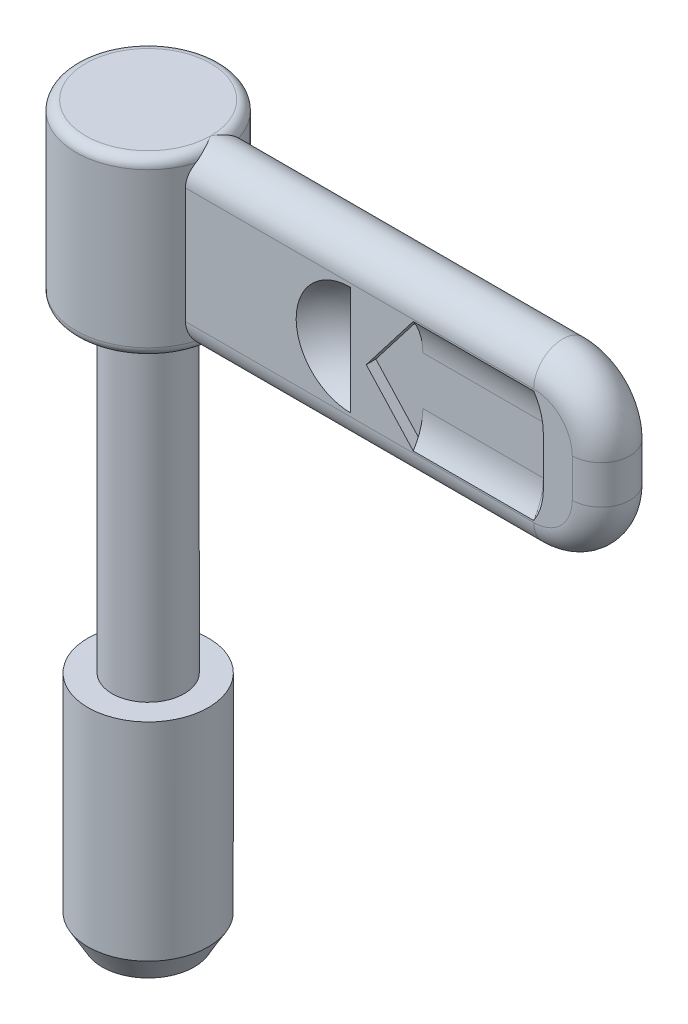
ISO-10303-21;
HEADER;
FILE_DESCRIPTION(('STEP AP214'),'2;1');
FILE_NAME('part.step','',(''),(''),'','','');
FILE_SCHEMA(('AUTOMOTIVE_DESIGN { 1 0 10303 214 1 1 1 1 }'));
ENDSEC;
DATA;
#1=APPLICATION_CONTEXT('core data for automotive mechanical design processes');
#2=APPLICATION_PROTOCOL_DEFINITION('international standard','automotive_design',2000,#1);
#3=PRODUCT_CONTEXT('',#1,'mechanical');
#4=PRODUCT('Part','Part','',(#3));
#5=PRODUCT_RELATED_PRODUCT_CATEGORY('part','',(#4));
#6=PRODUCT_DEFINITION_FORMATION('','',#4);
#7=PRODUCT_DEFINITION_CONTEXT('part definition',#1,'design');
#8=PRODUCT_DEFINITION('design','',#6,#7);
#9=PRODUCT_DEFINITION_SHAPE('','',#8);
#10=(LENGTH_UNIT() NAMED_UNIT(*) SI_UNIT(.MILLI.,.METRE.));
#11=(NAMED_UNIT(*) PLANE_ANGLE_UNIT() SI_UNIT($,.RADIAN.));
#12=(NAMED_UNIT(*) SI_UNIT($,.STERADIAN.) SOLID_ANGLE_UNIT());
#13=UNCERTAINTY_MEASURE_WITH_UNIT(LENGTH_MEASURE(1.E-05),#10,'distance_accuracy_value','');
#14=(GEOMETRIC_REPRESENTATION_CONTEXT(3) GLOBAL_UNCERTAINTY_ASSIGNED_CONTEXT((#13)) GLOBAL_UNIT_ASSIGNED_CONTEXT((#10,
#11,#12)) REPRESENTATION_CONTEXT('',''));
#15=CARTESIAN_POINT('',(0.,0.,0.));
#16=DIRECTION('',(0.,0.,1.));
#17=DIRECTION('',(1.,0.,0.));
#18=AXIS2_PLACEMENT_3D('',#15,#16,#17);
#19=CARTESIAN_POINT('',(24.4,46.,-2.4));
#20=DIRECTION('',(-1.,0.,0.));
#21=DIRECTION('',(0.,0.,1.));
#22=AXIS2_PLACEMENT_3D('',#19,#20,#21);
#23=PLANE('',#22);
#24=CARTESIAN_POINT('',(24.4,46.,-6.39999999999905));
#25=DIRECTION('',(1.,0.,0.));
#26=DIRECTION('',(0.,0.552770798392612,0.833333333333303));
#27=AXIS2_PLACEMENT_3D('',#24,#25,#26);
#28=CIRCLE('',#27,4.79999999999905);
#29=CARTESIAN_POINT('',(24.4,48.653299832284,-2.4));
#30=VERTEX_POINT('',#29);
#31=CARTESIAN_POINT('',(24.4,46.,-1.6));
#32=VERTEX_POINT('',#31);
#33=EDGE_CURVE('E188',#30,#32,#28,.T.);
#34=ORIENTED_EDGE('',*,*,#33,.T.);
#35=DIRECTION('',(0.,1.,0.));
#36=VECTOR('',#35,1.);
#37=CARTESIAN_POINT('',(24.4,46.,-1.6));
#38=LINE('',#37,#36);
#39=CARTESIAN_POINT('',(24.4,48.653299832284,-1.6));
#40=VERTEX_POINT('',#39);
#41=EDGE_CURVE('E198',#32,#40,#38,.T.);
#42=ORIENTED_EDGE('',*,*,#41,.T.);
#43=DIRECTION('',(0.,0.,-1.));
#44=VECTOR('',#43,1.);
#45=CARTESIAN_POINT('',(24.4,48.653299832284,-1.6));
#46=LINE('',#45,#44);
#47=EDGE_CURVE('E200',#40,#30,#46,.T.);
#48=ORIENTED_EDGE('',*,*,#47,.T.);
#49=EDGE_LOOP('',(#34,#42,#48));
#50=FACE_BOUND('',#49,.T.);
#51=ADVANCED_FACE('F14',(#50),#23,.T.);
#52=CARTESIAN_POINT('',(5.49909083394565,39.2,-2.4));
#53=DIRECTION('',(0.,0.,-1.));
#54=DIRECTION('',(0.,1.,0.));
#55=AXIS2_PLACEMENT_3D('',#52,#53,#54);
#56=PLANE('',#55);
#57=DIRECTION('',(1.42756177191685E-13,1.,0.));
#58=VECTOR('',#57,1.);
#59=CARTESIAN_POINT('',(5.49909083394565,39.2,-2.4));
#60=LINE('',#59,#58);
#61=CARTESIAN_POINT('',(5.49909083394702,48.8000000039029,-2.4));
#62=VERTEX_POINT('',#61);
#63=CARTESIAN_POINT('',(5.49909083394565,39.2,-2.4));
#64=VERTEX_POINT('',#63);
#65=EDGE_CURVE('E206',#62,#64,#60,.F.);
#66=ORIENTED_EDGE('',*,*,#65,.F.);
#67=DIRECTION('',(1.,-1.35045093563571E-10,0.));
#68=VECTOR('',#67,1.);
#69=CARTESIAN_POINT('',(5.49909083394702,48.8000000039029,-2.4));
#70=LINE('',#69,#68);
#71=CARTESIAN_POINT('',(34.4000000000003,48.8,-2.4));
#72=VERTEX_POINT('',#71);
#73=EDGE_CURVE('E216',#62,#72,#70,.T.);
#74=ORIENTED_EDGE('',*,*,#73,.T.);
#75=CARTESIAN_POINT('',(34.4000000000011,45.6000000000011,-2.4));
#76=DIRECTION('',(0.,0.,-1.));
#77=DIRECTION('',(-2.50910403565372E-13,1.,0.));
#78=AXIS2_PLACEMENT_3D('',#75,#76,#77);
#79=CIRCLE('',#78,3.19999999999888);
#80=CARTESIAN_POINT('',(37.6,45.6000000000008,-2.4));
#81=VERTEX_POINT('',#80);
#82=EDGE_CURVE('E221',#72,#81,#79,.T.);
#83=ORIENTED_EDGE('',*,*,#82,.T.);
#84=DIRECTION('',(0.,-1.,0.));
#85=VECTOR('',#84,1.);
#86=CARTESIAN_POINT('',(37.6,45.6000000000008,-2.4));
#87=LINE('',#86,#85);
#88=CARTESIAN_POINT('',(37.6,42.4,-2.4));
#89=VERTEX_POINT('',#88);
#90=EDGE_CURVE('E226',#81,#89,#87,.T.);
#91=ORIENTED_EDGE('',*,*,#90,.T.);
#92=CARTESIAN_POINT('',(34.4000000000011,42.3999999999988,-2.4));
#93=DIRECTION('',(0.,0.,-1.));
#94=DIRECTION('',(1.,2.28705943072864E-13,0.));
#95=AXIS2_PLACEMENT_3D('',#92,#93,#94);
#96=CIRCLE('',#95,3.19999999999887);
#97=CARTESIAN_POINT('',(34.4,39.2,-2.4));
#98=VERTEX_POINT('',#97);
#99=EDGE_CURVE('E231',#89,#98,#96,.T.);
#100=ORIENTED_EDGE('',*,*,#99,.T.);
#101=DIRECTION('',(-1.,0.,0.));
#102=VECTOR('',#101,1.);
#103=CARTESIAN_POINT('',(34.4,39.2,-2.4));
#104=LINE('',#103,#102);
#105=EDGE_CURVE('E236',#98,#64,#104,.T.);
#106=ORIENTED_EDGE('',*,*,#105,.T.);
#107=EDGE_LOOP('',(#66,#74,#83,#91,#100,#106));
#108=FACE_BOUND('',#107,.T.);
#109=CARTESIAN_POINT('',(34.4,48.653299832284,-2.4));
#110=CARTESIAN_POINT('',(34.4320887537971,48.6042882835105,-2.4));
#111=CARTESIAN_POINT('',(34.4633675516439,48.5547441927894,-2.4));
#112=CARTESIAN_POINT('',(34.5242338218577,48.4546114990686,-2.4));
#113=CARTESIAN_POINT('',(34.5538208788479,48.4040226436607,-2.4));
#114=CARTESIAN_POINT('',(34.6112146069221,48.3018483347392,-2.4));
#115=CARTESIAN_POINT('',(34.6390213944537,48.2502629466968,-2.4));
#116=CARTESIAN_POINT('',(34.6927764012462,48.1461488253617,-2.4));
#117=CARTESIAN_POINT('',(34.7187250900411,48.0936203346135,-2.4));
#118=CARTESIAN_POINT('',(34.7686957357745,47.9876758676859,-2.4));
#119=CARTESIAN_POINT('',(34.7927183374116,47.9342601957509,-2.4));
#120=CARTESIAN_POINT('',(34.8387790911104,47.8266005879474,-2.4));
#121=CARTESIAN_POINT('',(34.8608178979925,47.7723569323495,-2.4));
#122=CARTESIAN_POINT('',(34.9028638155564,47.6631037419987,-2.4));
#123=CARTESIAN_POINT('',(34.9228714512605,47.6080944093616,-2.4));
#124=CARTESIAN_POINT('',(34.9608183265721,47.4973754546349,-2.4));
#125=CARTESIAN_POINT('',(34.9787578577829,47.4416659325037,-2.4));
#126=CARTESIAN_POINT('',(35.0125423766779,47.3296153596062,-2.4));
#127=CARTESIAN_POINT('',(35.0283873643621,47.27327430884,-2.4));
#128=CARTESIAN_POINT('',(35.0579671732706,47.1600325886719,-2.4));
#129=CARTESIAN_POINT('',(35.0717016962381,47.1031318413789,-2.4));
#130=CARTESIAN_POINT('',(35.0970554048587,46.9888457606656,-2.4));
#131=CARTESIAN_POINT('',(35.1086740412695,46.9314603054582,-2.4));
#132=CARTESIAN_POINT('',(35.1298011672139,46.8162829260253,-2.4));
#133=CARTESIAN_POINT('',(35.1393089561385,46.7584908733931,-2.4));
#134=CARTESIAN_POINT('',(35.1562297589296,46.6425815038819,-2.4));
#135=CARTESIAN_POINT('',(35.1636420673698,46.5844640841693,-2.4));
#136=CARTESIAN_POINT('',(35.1763974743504,46.4679881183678,-2.4));
#137=CARTESIAN_POINT('',(35.1817400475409,46.4096295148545,-2.4));
#138=CARTESIAN_POINT('',(35.1903909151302,46.2927586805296,-2.4));
#139=CARTESIAN_POINT('',(35.1936990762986,46.2342464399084,-2.4));
#140=CARTESIAN_POINT('',(35.198327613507,46.1171574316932,-2.4));
#141=CARTESIAN_POINT('',(35.1996484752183,46.0585806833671,-2.4));
#142=CARTESIAN_POINT('',(35.2,46.,-2.4));
#143=B_SPLINE_CURVE_WITH_KNOTS('',3,(#109,#110,#111,#112,#113,#114,#115,#116,#117,#118,#119,
#120,#121,#122,#123,#124,#125,#126,#127,#128,#129,#130,#131,#132,#133,#134,#135,#136,#137,#138,
#139,#140,#141,#142),.UNSPECIFIED.,.F.,.F.,(4,2,2,2,2,2,2,2,2,2,2,2,2,2,2,2,4),(0.,
0.175739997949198,0.351522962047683,0.527294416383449,0.703021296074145,0.878689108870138,
1.05429872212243,1.22986282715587,1.40540214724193,1.58094146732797,1.75650557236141,
1.93211518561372,2.1077829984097,2.28350987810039,2.45928133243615,2.63506429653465,
2.81080429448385),.UNSPECIFIED.);
#144=CARTESIAN_POINT('',(34.4,48.653299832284,-2.4));
#145=VERTEX_POINT('',#144);
#146=CARTESIAN_POINT('',(35.2,46.,-2.4));
#147=VERTEX_POINT('',#146);
#148=EDGE_CURVE('E241',#145,#147,#143,.T.);
#149=ORIENTED_EDGE('',*,*,#148,.F.);
#150=DIRECTION('',(-1.,0.,0.));
#151=VECTOR('',#150,1.);
#152=CARTESIAN_POINT('',(34.4,48.653299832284,-2.4));
#153=LINE('',#152,#151);
#154=EDGE_CURVE('E252',#30,#145,#153,.F.);
#155=ORIENTED_EDGE('',*,*,#154,.F.);
#156=DIRECTION('',(-0.610974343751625,-0.791650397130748,0.));
#157=VECTOR('',#156,1.);
#158=CARTESIAN_POINT('',(24.4,48.653299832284,-2.4));
#159=LINE('',#158,#157);
#160=CARTESIAN_POINT('',(20.5,43.6,-2.4));
#161=VERTEX_POINT('',#160);
#162=EDGE_CURVE('E1065',#30,#161,#159,.T.);
#163=ORIENTED_EDGE('',*,*,#162,.T.);
#164=DIRECTION('',(0.675832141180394,-0.73705557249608,0.));
#165=VECTOR('',#164,1.);
#166=CARTESIAN_POINT('',(20.5,43.6,-2.4));
#167=LINE('',#166,#165);
#168=CARTESIAN_POINT('',(24.4,39.346700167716,-2.4));
#169=VERTEX_POINT('',#168);
#170=EDGE_CURVE('E1043',#161,#169,#167,.T.);
#171=ORIENTED_EDGE('',*,*,#170,.T.);
#172=DIRECTION('',(1.,0.,0.));
#173=VECTOR('',#172,1.);
#174=CARTESIAN_POINT('',(24.4,39.346700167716,-2.4));
#175=LINE('',#174,#173);
#176=CARTESIAN_POINT('',(34.4,39.346700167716,-2.4));
#177=VERTEX_POINT('',#176);
#178=EDGE_CURVE('E1036',#169,#177,#175,.T.);
#179=ORIENTED_EDGE('',*,*,#178,.T.);
#180=CARTESIAN_POINT('',(35.2,42.,-2.4));
#181=CARTESIAN_POINT('',(35.1996484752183,41.9414193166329,-2.4));
#182=CARTESIAN_POINT('',(35.198327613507,41.8828425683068,-2.4));
#183=CARTESIAN_POINT('',(35.1936990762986,41.7657535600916,-2.4));
#184=CARTESIAN_POINT('',(35.1903909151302,41.7072413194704,-2.4));
#185=CARTESIAN_POINT('',(35.1817400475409,41.5903704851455,-2.4));
#186=CARTESIAN_POINT('',(35.1763974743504,41.5320118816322,-2.4));
#187=CARTESIAN_POINT('',(35.1636420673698,41.4155359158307,-2.4));
#188=CARTESIAN_POINT('',(35.1562297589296,41.3574184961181,-2.4));
#189=CARTESIAN_POINT('',(35.1393089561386,41.2415091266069,-2.4));
#190=CARTESIAN_POINT('',(35.1298011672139,41.1837170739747,-2.4));
#191=CARTESIAN_POINT('',(35.1086740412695,41.0685396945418,-2.4));
#192=CARTESIAN_POINT('',(35.0970554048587,41.0111542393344,-2.4));
#193=CARTESIAN_POINT('',(35.0717016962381,40.8968681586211,-2.4));
#194=CARTESIAN_POINT('',(35.0579671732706,40.8399674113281,-2.4));
#195=CARTESIAN_POINT('',(35.0283873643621,40.72672569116,-2.4));
#196=CARTESIAN_POINT('',(35.0125423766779,40.6703846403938,-2.4));
#197=CARTESIAN_POINT('',(34.9787578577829,40.5583340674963,-2.4));
#198=CARTESIAN_POINT('',(34.9608183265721,40.5026245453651,-2.4));
#199=CARTESIAN_POINT('',(34.9228714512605,40.3919055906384,-2.4));
#200=CARTESIAN_POINT('',(34.9028638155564,40.3368962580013,-2.4));
#201=CARTESIAN_POINT('',(34.8608178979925,40.2276430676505,-2.4));
#202=CARTESIAN_POINT('',(34.8387790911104,40.1733994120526,-2.4));
#203=CARTESIAN_POINT('',(34.7927183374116,40.0657398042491,-2.4));
#204=CARTESIAN_POINT('',(34.7686957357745,40.0123241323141,-2.4));
#205=CARTESIAN_POINT('',(34.7187250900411,39.9063796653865,-2.4));
#206=CARTESIAN_POINT('',(34.6927764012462,39.8538511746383,-2.4));
#207=CARTESIAN_POINT('',(34.6390213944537,39.7497370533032,-2.4));
#208=CARTESIAN_POINT('',(34.6112146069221,39.6981516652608,-2.4));
#209=CARTESIAN_POINT('',(34.5538208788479,39.5959773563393,-2.4));
#210=CARTESIAN_POINT('',(34.5242338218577,39.5453885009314,-2.4));
#211=CARTESIAN_POINT('',(34.4633675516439,39.4452558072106,-2.4));
#212=CARTESIAN_POINT('',(34.4320887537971,39.3957117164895,-2.4));
#213=CARTESIAN_POINT('',(34.4,39.346700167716,-2.4));
#214=B_SPLINE_CURVE_WITH_KNOTS('',3,(#180,#181,#182,#183,#184,#185,#186,#187,#188,#189,#190,
#191,#192,#193,#194,#195,#196,#197,#198,#199,#200,#201,#202,#203,#204,#205,#206,#207,#208,#209,
#210,#211,#212,#213),.UNSPECIFIED.,.F.,.F.,(4,2,2,2,2,2,2,2,2,2,2,2,2,2,2,2,4),(0.,
0.1757399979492,0.351522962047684,0.527294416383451,0.703021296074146,0.878689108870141,
1.05429872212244,1.22986282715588,1.40540214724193,1.58094146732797,1.75650557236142,
1.93211518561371,2.1077829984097,2.2835098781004,2.45928133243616,2.63506429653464,
2.81080429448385),.UNSPECIFIED.);
#215=CARTESIAN_POINT('',(35.2,42.,-2.4));
#216=VERTEX_POINT('',#215);
#217=EDGE_CURVE('E1040',#216,#177,#214,.T.);
#218=ORIENTED_EDGE('',*,*,#217,.F.);
#219=DIRECTION('',(0.,1.,0.));
#220=VECTOR('',#219,1.);
#221=CARTESIAN_POINT('',(35.2,42.,-2.4));
#222=LINE('',#221,#220);
#223=EDGE_CURVE('E1045',#216,#147,#222,.T.);
#224=ORIENTED_EDGE('',*,*,#223,.T.);
#225=EDGE_LOOP('',(#149,#155,#163,#171,#179,#218,#224));
#226=FACE_BOUND('',#225,.T.);
#227=DIRECTION('',(0.,1.,0.));
#228=VECTOR('',#227,1.);
#229=CARTESIAN_POINT('',(19.2,39.4833640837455,-2.4));
#230=LINE('',#229,#228);
#231=CARTESIAN_POINT('',(19.2,39.4833640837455,-2.4));
#232=VERTEX_POINT('',#231);
#233=CARTESIAN_POINT('',(19.2,48.5166359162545,-2.4));
#234=VERTEX_POINT('',#233);
#235=EDGE_CURVE('E1046',#232,#234,#230,.T.);
#236=ORIENTED_EDGE('',*,*,#235,.T.);
#237=CARTESIAN_POINT('',(19.2,48.5166359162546,-2.4));
#238=CARTESIAN_POINT('',(18.9546860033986,48.5166359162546,-2.4));
#239=CARTESIAN_POINT('',(18.7168170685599,48.497667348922,-2.4));
#240=CARTESIAN_POINT('',(18.2531812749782,48.4236894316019,-2.4));
#241=CARTESIAN_POINT('',(18.0274144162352,48.3686800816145,-2.4));
#242=CARTESIAN_POINT('',(17.4769210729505,48.1892198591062,-2.4));
#243=CARTESIAN_POINT('',(17.1604140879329,48.0445418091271,-2.4));
#244=CARTESIAN_POINT('',(16.3438787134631,47.5541631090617,-2.4));
#245=CARTESIAN_POINT('',(15.9075997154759,47.1448744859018,-2.4));
#246=CARTESIAN_POINT('',(14.2350139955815,44.885547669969,-2.4));
#247=CARTESIAN_POINT('',(14.4291116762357,42.3834005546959,-2.4));
#248=CARTESIAN_POINT('',(16.3373888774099,40.4751233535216,-2.4));
#249=CARTESIAN_POINT('',(16.7125489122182,40.1965456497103,-2.4));
#250=CARTESIAN_POINT('',(17.4532373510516,39.8214275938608,-2.4));
#251=CARTESIAN_POINT('',(17.7758823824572,39.6989351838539,-2.4));
#252=CARTESIAN_POINT('',(18.4689492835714,39.5270686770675,-2.4));
#253=CARTESIAN_POINT('',(18.8301279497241,39.4833640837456,-2.4));
#254=CARTESIAN_POINT('',(19.2,39.4833640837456,-2.4));
#255=B_SPLINE_CURVE_WITH_KNOTS('',3,(#237,#238,#239,#240,#241,#242,#243,#244,#245,#246,#247,
#248,#249,#250,#251,#252,#253,#254),.UNSPECIFIED.,.F.,.F.,(4,2,2,2,2,2,2,2,4),(0.,
0.0452435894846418,0.0904871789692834,0.157885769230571,0.280523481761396,0.759938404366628,
0.860594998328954,0.929100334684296,1.),.UNSPECIFIED.);
#256=EDGE_CURVE('E287',#234,#232,#255,.T.);
#257=ORIENTED_EDGE('',*,*,#256,.T.);
#258=EDGE_LOOP('',(#236,#257));
#259=FACE_BOUND('',#258,.T.);
#260=ADVANCED_FACE('F254',(#108,#226,#259),#56,.T.);
#261=CARTESIAN_POINT('',(5.49909083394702,39.1999999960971,2.4));
#262=DIRECTION('',(0.,0.,1.));
#263=DIRECTION('',(1.,0.,0.));
#264=AXIS2_PLACEMENT_3D('',#261,#262,#263);
#265=PLANE('',#264);
#266=DIRECTION('',(-1.,-1.82876157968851E-08,0.));
#267=VECTOR('',#266,1.);
#268=CARTESIAN_POINT('',(34.4000000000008,48.8,2.4));
#269=LINE('',#268,#267);
#270=CARTESIAN_POINT('',(34.4000000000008,48.8,2.4));
#271=VERTEX_POINT('',#270);
#272=CARTESIAN_POINT('',(5.49909083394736,48.7999994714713,2.4));
#273=VERTEX_POINT('',#272);
#274=EDGE_CURVE('E278',#271,#273,#269,.T.);
#275=ORIENTED_EDGE('',*,*,#274,.T.);
#276=DIRECTION('',(0.,-1.,0.));
#277=VECTOR('',#276,1.);
#278=CARTESIAN_POINT('',(5.49909083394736,48.7999994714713,2.4));
#279=LINE('',#278,#277);
#280=CARTESIAN_POINT('',(5.49909083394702,39.1999999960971,2.4));
#281=VERTEX_POINT('',#280);
#282=EDGE_CURVE('E286',#273,#281,#279,.T.);
#283=ORIENTED_EDGE('',*,*,#282,.T.);
#284=DIRECTION('',(1.,1.35044601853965E-10,0.));
#285=VECTOR('',#284,1.);
#286=CARTESIAN_POINT('',(5.49909083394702,39.1999999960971,2.4));
#287=LINE('',#286,#285);
#288=CARTESIAN_POINT('',(34.4,39.2,2.4));
#289=VERTEX_POINT('',#288);
#290=EDGE_CURVE('E292',#281,#289,#287,.T.);
#291=ORIENTED_EDGE('',*,*,#290,.T.);
#292=CARTESIAN_POINT('',(34.4000000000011,42.3999999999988,2.4));
#293=DIRECTION('',(0.,0.,1.));
#294=DIRECTION('',(-3.61932706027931E-13,-1.,0.));
#295=AXIS2_PLACEMENT_3D('',#292,#293,#294);
#296=CIRCLE('',#295,3.19999999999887);
#297=CARTESIAN_POINT('',(37.6,42.399999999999,2.4));
#298=VERTEX_POINT('',#297);
#299=EDGE_CURVE('E297',#289,#298,#296,.T.);
#300=ORIENTED_EDGE('',*,*,#299,.T.);
#301=DIRECTION('',(0.,1.,0.));
#302=VECTOR('',#301,1.);
#303=CARTESIAN_POINT('',(37.6,42.399999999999,2.4));
#304=LINE('',#303,#302);
#305=CARTESIAN_POINT('',(37.6,45.6,2.4));
#306=VERTEX_POINT('',#305);
#307=EDGE_CURVE('E302',#298,#306,#304,.T.);
#308=ORIENTED_EDGE('',*,*,#307,.T.);
#309=CARTESIAN_POINT('',(34.4000000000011,45.6000000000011,2.4));
#310=DIRECTION('',(0.,0.,1.));
#311=DIRECTION('',(1.,-2.88657986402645E-13,0.));
#312=AXIS2_PLACEMENT_3D('',#309,#310,#311);
#313=CIRCLE('',#312,3.19999999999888);
#314=EDGE_CURVE('E307',#306,#271,#313,.T.);
#315=ORIENTED_EDGE('',*,*,#314,.T.);
#316=EDGE_LOOP('',(#275,#283,#291,#300,#308,#315));
#317=FACE_BOUND('',#316,.T.);
#318=DIRECTION('',(0.610974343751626,0.791650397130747,0.));
#319=VECTOR('',#318,1.);
#320=CARTESIAN_POINT('',(20.5,43.6,2.4));
#321=LINE('',#320,#319);
#322=CARTESIAN_POINT('',(24.4,48.653299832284,2.4));
#323=VERTEX_POINT('',#322);
#324=CARTESIAN_POINT('',(20.5,43.6,2.4));
#325=VERTEX_POINT('',#324);
#326=EDGE_CURVE('E312',#323,#325,#321,.F.);
#327=ORIENTED_EDGE('',*,*,#326,.F.);
#328=DIRECTION('',(1.,0.,0.));
#329=VECTOR('',#328,1.);
#330=CARTESIAN_POINT('',(24.4,48.653299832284,2.4));
#331=LINE('',#330,#329);
#332=CARTESIAN_POINT('',(34.4,48.653299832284,2.4));
#333=VERTEX_POINT('',#332);
#334=EDGE_CURVE('E317',#323,#333,#331,.T.);
#335=ORIENTED_EDGE('',*,*,#334,.T.);
#336=CARTESIAN_POINT('',(35.2,46.,2.4));
#337=CARTESIAN_POINT('',(35.1996484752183,46.0585806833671,2.4));
#338=CARTESIAN_POINT('',(35.1983276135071,46.1171574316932,2.4));
#339=CARTESIAN_POINT('',(35.1936990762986,46.2342464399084,2.4));
#340=CARTESIAN_POINT('',(35.1903909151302,46.2927586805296,2.4));
#341=CARTESIAN_POINT('',(35.1817400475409,46.4096295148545,2.4));
#342=CARTESIAN_POINT('',(35.1763974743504,46.4679881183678,2.4));
#343=CARTESIAN_POINT('',(35.1636420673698,46.5844640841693,2.4));
#344=CARTESIAN_POINT('',(35.1562297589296,46.6425815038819,2.4));
#345=CARTESIAN_POINT('',(35.1393089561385,46.7584908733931,2.4));
#346=CARTESIAN_POINT('',(35.1298011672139,46.8162829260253,2.4));
#347=CARTESIAN_POINT('',(35.1086740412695,46.9314603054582,2.4));
#348=CARTESIAN_POINT('',(35.0970554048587,46.9888457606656,2.4));
#349=CARTESIAN_POINT('',(35.0717016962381,47.1031318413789,2.4));
#350=CARTESIAN_POINT('',(35.0579671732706,47.1600325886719,2.4));
#351=CARTESIAN_POINT('',(35.0283873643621,47.27327430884,2.4));
#352=CARTESIAN_POINT('',(35.0125423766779,47.3296153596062,2.4));
#353=CARTESIAN_POINT('',(34.9787578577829,47.4416659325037,2.4));
#354=CARTESIAN_POINT('',(34.9608183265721,47.4973754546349,2.4));
#355=CARTESIAN_POINT('',(34.9228714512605,47.6080944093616,2.4));
#356=CARTESIAN_POINT('',(34.9028638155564,47.6631037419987,2.4));
#357=CARTESIAN_POINT('',(34.8608178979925,47.7723569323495,2.4));
#358=CARTESIAN_POINT('',(34.8387790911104,47.8266005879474,2.4));
#359=CARTESIAN_POINT('',(34.7927183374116,47.9342601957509,2.4));
#360=CARTESIAN_POINT('',(34.7686957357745,47.9876758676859,2.4));
#361=CARTESIAN_POINT('',(34.7187250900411,48.0936203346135,2.4));
#362=CARTESIAN_POINT('',(34.6927764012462,48.1461488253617,2.4));
#363=CARTESIAN_POINT('',(34.6390213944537,48.2502629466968,2.4));
#364=CARTESIAN_POINT('',(34.6112146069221,48.3018483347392,2.4));
#365=CARTESIAN_POINT('',(34.5538208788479,48.4040226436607,2.4));
#366=CARTESIAN_POINT('',(34.5242338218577,48.4546114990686,2.4));
#367=CARTESIAN_POINT('',(34.4633675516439,48.5547441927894,2.4));
#368=CARTESIAN_POINT('',(34.4320887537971,48.6042882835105,2.4));
#369=CARTESIAN_POINT('',(34.4,48.653299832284,2.4));
#370=B_SPLINE_CURVE_WITH_KNOTS('',3,(#336,#337,#338,#339,#340,#341,#342,#343,#344,#345,#346,
#347,#348,#349,#350,#351,#352,#353,#354,#355,#356,#357,#358,#359,#360,#361,#362,#363,#364,#365,
#366,#367,#368,#369),.UNSPECIFIED.,.F.,.F.,(4,2,2,2,2,2,2,2,2,2,2,2,2,2,2,2,4),(0.,
0.175739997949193,0.351522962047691,0.527294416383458,0.703021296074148,0.878689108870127,
1.05429872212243,1.22986282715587,1.40540214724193,1.58094146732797,1.75650557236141,
1.93211518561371,2.10778299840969,2.2835098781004,2.45928133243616,2.63506429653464,
2.81080429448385),.UNSPECIFIED.);
#371=CARTESIAN_POINT('',(35.2,46.,2.4));
#372=VERTEX_POINT('',#371);
#373=EDGE_CURVE('E322',#372,#333,#370,.T.);
#374=ORIENTED_EDGE('',*,*,#373,.F.);
#375=DIRECTION('',(0.,-1.,0.));
#376=VECTOR('',#375,1.);
#377=CARTESIAN_POINT('',(35.2,46.,2.4));
#378=LINE('',#377,#376);
#379=CARTESIAN_POINT('',(35.2,42.,2.4));
#380=VERTEX_POINT('',#379);
#381=EDGE_CURVE('E332',#372,#380,#378,.T.);
#382=ORIENTED_EDGE('',*,*,#381,.T.);
#383=CARTESIAN_POINT('',(34.4,39.346700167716,2.4));
#384=CARTESIAN_POINT('',(34.4320887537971,39.3957117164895,2.4));
#385=CARTESIAN_POINT('',(34.4633675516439,39.4452558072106,2.4));
#386=CARTESIAN_POINT('',(34.5242338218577,39.5453885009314,2.4));
#387=CARTESIAN_POINT('',(34.5538208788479,39.5959773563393,2.4));
#388=CARTESIAN_POINT('',(34.6112146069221,39.6981516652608,2.4));
#389=CARTESIAN_POINT('',(34.6390213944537,39.7497370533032,2.4));
#390=CARTESIAN_POINT('',(34.6927764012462,39.8538511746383,2.4));
#391=CARTESIAN_POINT('',(34.7187250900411,39.9063796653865,2.4));
#392=CARTESIAN_POINT('',(34.7686957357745,40.0123241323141,2.4));
#393=CARTESIAN_POINT('',(34.7927183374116,40.0657398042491,2.4));
#394=CARTESIAN_POINT('',(34.8387790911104,40.1733994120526,2.4));
#395=CARTESIAN_POINT('',(34.8608178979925,40.2276430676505,2.4));
#396=CARTESIAN_POINT('',(34.9028638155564,40.3368962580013,2.4));
#397=CARTESIAN_POINT('',(34.9228714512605,40.3919055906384,2.4));
#398=CARTESIAN_POINT('',(34.9608183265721,40.5026245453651,2.4));
#399=CARTESIAN_POINT('',(34.9787578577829,40.5583340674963,2.4));
#400=CARTESIAN_POINT('',(35.0125423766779,40.6703846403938,2.4));
#401=CARTESIAN_POINT('',(35.0283873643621,40.72672569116,2.4));
#402=CARTESIAN_POINT('',(35.0579671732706,40.8399674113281,2.4));
#403=CARTESIAN_POINT('',(35.0717016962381,40.8968681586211,2.4));
#404=CARTESIAN_POINT('',(35.0970554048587,41.0111542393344,2.4));
#405=CARTESIAN_POINT('',(35.1086740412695,41.0685396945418,2.4));
#406=CARTESIAN_POINT('',(35.1298011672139,41.1837170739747,2.4));
#407=CARTESIAN_POINT('',(35.1393089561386,41.2415091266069,2.4));
#408=CARTESIAN_POINT('',(35.1562297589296,41.3574184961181,2.4));
#409=CARTESIAN_POINT('',(35.1636420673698,41.4155359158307,2.4));
#410=CARTESIAN_POINT('',(35.1763974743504,41.5320118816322,2.4));
#411=CARTESIAN_POINT('',(35.1817400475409,41.5903704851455,2.4));
#412=CARTESIAN_POINT('',(35.1903909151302,41.7072413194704,2.4));
#413=CARTESIAN_POINT('',(35.1936990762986,41.7657535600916,2.4));
#414=CARTESIAN_POINT('',(35.1983276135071,41.8828425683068,2.4));
#415=CARTESIAN_POINT('',(35.1996484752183,41.9414193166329,2.4));
#416=CARTESIAN_POINT('',(35.2,42.,2.4));
#417=B_SPLINE_CURVE_WITH_KNOTS('',3,(#383,#384,#385,#386,#387,#388,#389,#390,#391,#392,#393,
#394,#395,#396,#397,#398,#399,#400,#401,#402,#403,#404,#405,#406,#407,#408,#409,#410,#411,#412,
#413,#414,#415,#416),.UNSPECIFIED.,.F.,.F.,(4,2,2,2,2,2,2,2,2,2,2,2,2,2,2,2,4),(0.,
0.175739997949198,0.351522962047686,0.527294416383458,0.703021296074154,0.878689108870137,
1.05429872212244,1.22986282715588,1.40540214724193,1.58094146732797,1.75650557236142,
1.93211518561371,2.1077829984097,2.2835098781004,2.45928133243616,2.63506429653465,
2.81080429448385),.UNSPECIFIED.);
#418=CARTESIAN_POINT('',(34.4,39.346700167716,2.4));
#419=VERTEX_POINT('',#418);
#420=EDGE_CURVE('E339',#419,#380,#417,.T.);
#421=ORIENTED_EDGE('',*,*,#420,.F.);
#422=DIRECTION('',(-1.,0.,0.));
#423=VECTOR('',#422,1.);
#424=CARTESIAN_POINT('',(34.4,39.346700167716,2.4));
#425=LINE('',#424,#423);
#426=CARTESIAN_POINT('',(24.4,39.346700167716,2.4));
#427=VERTEX_POINT('',#426);
#428=EDGE_CURVE('E349',#427,#419,#425,.F.);
#429=ORIENTED_EDGE('',*,*,#428,.F.);
#430=DIRECTION('',(-0.675832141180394,0.73705557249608,0.));
#431=VECTOR('',#430,1.);
#432=CARTESIAN_POINT('',(24.4,39.346700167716,2.4));
#433=LINE('',#432,#431);
#434=EDGE_CURVE('E356',#325,#427,#433,.F.);
#435=ORIENTED_EDGE('',*,*,#434,.F.);
#436=EDGE_LOOP('',(#327,#335,#374,#382,#421,#429,#435));
#437=FACE_BOUND('',#436,.T.);
#438=CARTESIAN_POINT('',(19.2,48.5166359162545,2.4));
#439=CARTESIAN_POINT('',(19.1144578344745,48.5166477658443,2.40000991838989));
#440=CARTESIAN_POINT('',(19.0289139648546,48.5142351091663,2.40003227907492));
#441=CARTESIAN_POINT('',(18.8590567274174,48.504607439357,2.4000710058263));
#442=CARTESIAN_POINT('',(18.7747402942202,48.4974464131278,2.4000874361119));
#443=CARTESIAN_POINT('',(18.6071104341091,48.4784212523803,2.40008501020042));
#444=CARTESIAN_POINT('',(18.523794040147,48.4665832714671,2.40006634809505));
#445=CARTESIAN_POINT('',(18.3580225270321,48.4382727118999,2.40001542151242));
#446=CARTESIAN_POINT('',(18.2755667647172,48.4218038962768,2.39998316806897));
#447=CARTESIAN_POINT('',(18.1114747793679,48.3842521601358,2.39993298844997));
#448=CARTESIAN_POINT('',(18.0298414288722,48.3631566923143,2.39991510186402));
#449=CARTESIAN_POINT('',(17.8674603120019,48.3163422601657,2.39991419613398));
#450=CARTESIAN_POINT('',(17.786719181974,48.290600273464,2.39993135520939));
#451=CARTESIAN_POINT('',(17.6263066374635,48.23444245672,2.39996913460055));
#452=CARTESIAN_POINT('',(17.5466451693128,48.2039981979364,2.39998977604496));
#453=CARTESIAN_POINT('',(17.389152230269,48.1386213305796,2.40001023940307));
#454=CARTESIAN_POINT('',(17.3113214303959,48.1036871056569,2.40001005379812));
#455=CARTESIAN_POINT('',(17.1580202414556,48.0295959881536,2.40001242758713));
#456=CARTESIAN_POINT('',(17.0825427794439,47.9904537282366,2.40001497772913));
#457=CARTESIAN_POINT('',(16.9339934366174,47.9080048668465,2.40000959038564));
#458=CARTESIAN_POINT('',(16.8609192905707,47.8647023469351,2.40000166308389));
#459=CARTESIAN_POINT('',(16.7172856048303,47.7740190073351,2.3999844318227));
#460=CARTESIAN_POINT('',(16.6467276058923,47.7266357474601,2.39997512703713));
#461=CARTESIAN_POINT('',(16.508291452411,47.6278954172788,2.39996107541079));
#462=CARTESIAN_POINT('',(16.4404174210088,47.5765325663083,2.39995633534));
#463=CARTESIAN_POINT('',(16.3075546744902,47.4699655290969,2.39995554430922));
#464=CARTESIAN_POINT('',(16.2425713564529,47.4147546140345,2.39995950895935));
#465=CARTESIAN_POINT('',(16.1157223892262,47.3006549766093,2.39997588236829));
#466=CARTESIAN_POINT('',(16.0538620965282,47.2417602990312,2.39998830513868));
#467=CARTESIAN_POINT('',(15.9335051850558,47.1204909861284,2.40001777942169));
#468=CARTESIAN_POINT('',(15.8750126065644,47.0581123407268,2.40003483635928));
#469=CARTESIAN_POINT('',(15.7616386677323,46.9301089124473,2.40006758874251));
#470=CARTESIAN_POINT('',(15.7067588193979,46.8644827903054,2.40008328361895));
#471=CARTESIAN_POINT('',(15.6008482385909,46.7302547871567,2.40010734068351));
#472=CARTESIAN_POINT('',(15.5498153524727,46.6616546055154,2.40011570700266));
#473=CARTESIAN_POINT('',(15.4518172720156,46.5217846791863,2.40012104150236));
#474=CARTESIAN_POINT('',(15.404845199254,46.4505197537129,2.40011802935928));
#475=CARTESIAN_POINT('',(15.315158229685,46.3056610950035,2.40010170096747));
#476=CARTESIAN_POINT('',(15.2724307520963,46.2320751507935,2.400088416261));
#477=CARTESIAN_POINT('',(15.1913896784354,46.082945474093,2.40005481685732));
#478=CARTESIAN_POINT('',(15.1530568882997,46.0074121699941,2.40003453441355));
#479=CARTESIAN_POINT('',(15.0809018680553,45.8547769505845,2.4000102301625));
#480=CARTESIAN_POINT('',(15.047053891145,45.7776872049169,2.40000611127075));
#481=CARTESIAN_POINT('',(14.9834862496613,45.6211544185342,2.39999281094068));
#482=CARTESIAN_POINT('',(14.9537991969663,45.5416981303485,2.3999835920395));
#483=CARTESIAN_POINT('',(14.8985361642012,45.380047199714,2.39996549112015));
#484=CARTESIAN_POINT('',(14.8730279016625,45.2978294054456,2.39995661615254));
#485=CARTESIAN_POINT('',(14.8264472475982,45.1310369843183,2.39995335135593));
#486=CARTESIAN_POINT('',(14.8054343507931,45.0464457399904,2.39995914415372));
#487=CARTESIAN_POINT('',(14.7681329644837,44.8753152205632,2.39998465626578));
#488=CARTESIAN_POINT('',(14.7518953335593,44.788764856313,2.40000451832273));
#489=CARTESIAN_POINT('',(14.7243843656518,44.6141503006,2.40005367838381));
#490=CARTESIAN_POINT('',(14.7131528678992,44.52607951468,2.40008305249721));
#491=CARTESIAN_POINT('',(14.695842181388,44.3488781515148,2.40014381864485));
#492=CARTESIAN_POINT('',(14.6897955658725,44.2597443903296,2.40017522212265));
#493=CARTESIAN_POINT('',(14.6829865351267,44.0808855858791,2.40023281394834));
#494=CARTESIAN_POINT('',(14.6822472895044,43.9911596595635,2.4002589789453));
#495=CARTESIAN_POINT('',(14.6861263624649,43.8115934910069,2.4003008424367));
#496=CARTESIAN_POINT('',(14.6907584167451,43.7217535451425,2.40031651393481));
#497=CARTESIAN_POINT('',(14.7053936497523,43.5424385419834,2.40033539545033));
#498=CARTESIAN_POINT('',(14.7154011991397,43.4529638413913,2.40033859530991));
#499=CARTESIAN_POINT('',(14.7407412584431,43.2748544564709,2.40033423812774));
#500=CARTESIAN_POINT('',(14.7560689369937,43.1862190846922,2.40032669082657));
#501=CARTESIAN_POINT('',(14.7919447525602,43.0102532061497,2.40030588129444));
#502=CARTESIAN_POINT('',(14.8124791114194,42.9229198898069,2.40029263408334));
#503=CARTESIAN_POINT('',(14.8586081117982,42.750006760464,2.40026765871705));
#504=CARTESIAN_POINT('',(14.8841803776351,42.6644209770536,2.40025592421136));
#505=CARTESIAN_POINT('',(14.9401733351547,42.4954299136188,2.40024140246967));
#506=CARTESIAN_POINT('',(14.9705635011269,42.4120145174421,2.40023856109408));
#507=CARTESIAN_POINT('',(15.0359336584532,42.2477645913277,2.40024712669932));
#508=CARTESIAN_POINT('',(15.0708755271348,42.1669148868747,2.40025842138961));
#509=CARTESIAN_POINT('',(15.1450508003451,42.0081664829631,2.40029426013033));
#510=CARTESIAN_POINT('',(15.1842391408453,41.9302467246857,2.40031867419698));
#511=CARTESIAN_POINT('',(15.2665739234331,41.7776929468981,2.40037365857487));
#512=CARTESIAN_POINT('',(15.3096691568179,41.7030312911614,2.40040415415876));
#513=CARTESIAN_POINT('',(15.3994838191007,41.5572719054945,2.40044055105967));
#514=CARTESIAN_POINT('',(15.4461481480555,41.4861402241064,2.40044677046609));
#515=CARTESIAN_POINT('',(15.5429809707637,41.3472887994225,2.40043512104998));
#516=CARTESIAN_POINT('',(15.5931126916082,41.2795434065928,2.40041747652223));
#517=CARTESIAN_POINT('',(15.6966749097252,41.1474998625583,2.40037320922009));
#518=CARTESIAN_POINT('',(15.750075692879,41.0831784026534,2.40034665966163));
#519=CARTESIAN_POINT('',(15.8599065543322,40.9581183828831,2.40029267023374));
#520=CARTESIAN_POINT('',(15.9163078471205,40.8973545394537,2.40026523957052));
#521=CARTESIAN_POINT('',(16.0318731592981,40.7795160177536,2.40021854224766));
#522=CARTESIAN_POINT('',(16.0910098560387,40.7224145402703,2.40019920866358));
#523=CARTESIAN_POINT('',(16.211791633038,40.6119803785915,2.40017398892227));
#524=CARTESIAN_POINT('',(16.2734114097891,40.5586200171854,2.40016799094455));
#525=CARTESIAN_POINT('',(16.3989243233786,40.4557225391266,2.4001702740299));
#526=CARTESIAN_POINT('',(16.4627947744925,40.4061577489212,2.4001784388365));
#527=CARTESIAN_POINT('',(16.5926013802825,40.3108831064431,2.40020472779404));
#528=CARTESIAN_POINT('',(16.658518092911,40.2651467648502,2.40022277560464));
#529=CARTESIAN_POINT('',(16.7922449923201,40.1775406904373,2.40026008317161));
#530=CARTESIAN_POINT('',(16.8600396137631,40.1356471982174,2.40027933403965));
#531=CARTESIAN_POINT('',(16.9973937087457,40.0557215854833,2.40030808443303));
#532=CARTESIAN_POINT('',(17.0669420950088,40.0176704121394,2.40031763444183));
#533=CARTESIAN_POINT('',(17.2077267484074,39.9454108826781,2.40031771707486));
#534=CARTESIAN_POINT('',(17.2789569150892,39.9111906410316,2.40030831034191));
#535=CARTESIAN_POINT('',(17.4230875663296,39.8465644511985,2.40026952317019));
#536=CARTESIAN_POINT('',(17.4959872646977,39.8161567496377,2.40024015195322));
#537=CARTESIAN_POINT('',(17.6435056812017,39.7591228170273,2.40017574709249));
#538=CARTESIAN_POINT('',(17.718128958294,39.7325083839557,2.40014069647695));
#539=CARTESIAN_POINT('',(17.8689926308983,39.6830954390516,2.40011190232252));
#540=CARTESIAN_POINT('',(17.9452386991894,39.6603142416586,2.40011834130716));
#541=CARTESIAN_POINT('',(18.0985922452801,39.6188895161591,2.40011456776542));
#542=CARTESIAN_POINT('',(18.1756963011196,39.6002333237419,2.40010440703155));
#543=CARTESIAN_POINT('',(18.3306051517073,39.5670350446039,2.40009329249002));
#544=CARTESIAN_POINT('',(18.4084080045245,39.5524838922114,2.40009231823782));
#545=CARTESIAN_POINT('',(18.564709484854,39.5274850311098,2.40008744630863));
#546=CARTESIAN_POINT('',(18.6432084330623,39.5170393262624,2.40008354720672));
#547=CARTESIAN_POINT('',(18.8009710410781,39.50026466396,2.40006403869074));
#548=CARTESIAN_POINT('',(18.8802365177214,39.4939527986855,2.40004838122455));
#549=CARTESIAN_POINT('',(19.0396669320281,39.4854810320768,2.40001906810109));
#550=CARTESIAN_POINT('',(19.1198337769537,39.4833569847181,2.40000543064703));
#551=CARTESIAN_POINT('',(19.2,39.4833640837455,2.4));
#552=B_SPLINE_CURVE_WITH_KNOTS('',3,(#438,#439,#440,#441,#442,#443,#444,#445,#446,#447,#448,
#449,#450,#451,#452,#453,#454,#455,#456,#457,#458,#459,#460,#461,#462,#463,#464,#465,#466,#467,
#468,#469,#470,#471,#472,#473,#474,#475,#476,#477,#478,#479,#480,#481,#482,#483,#484,#485,#486,
#487,#488,#489,#490,#491,#492,#493,#494,#495,#496,#497,#498,#499,#500,#501,#502,#503,#504,#505,
#506,#507,#508,#509,#510,#511,#512,#513,#514,#515,#516,#517,#518,#519,#520,#521,#522,#523,#524,
#525,#526,#527,#528,#529,#530,#531,#532,#533,#534,#535,#536,#537,#538,#539,#540,#541,#542,#543,
#544,#545,#546,#547,#548,#549,#550,#551),.UNSPECIFIED.,.F.,.F.,(4,2,2,2,2,2,2,2,2,2,2,2,2,2,2,2,
2,2,2,2,2,2,2,2,2,2,2,2,2,2,2,2,2,2,2,2,2,2,2,2,2,2,2,2,2,2,2,2,2,2,2,2,2,2,2,2,4),(0.,
0.256594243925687,0.510320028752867,0.762646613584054,1.01476874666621,1.26758327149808,
1.5216866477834,1.77739118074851,2.03318802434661,2.28812251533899,2.54280939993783,
2.79764965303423,3.05286728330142,3.3085429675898,3.56464323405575,3.82104460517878,
4.07755261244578,4.33391593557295,4.58983614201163,4.84497364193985,5.0989505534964,
5.35139962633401,5.60572820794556,5.86383975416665,6.12518078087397,6.38921199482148,
6.65541029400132,6.92326894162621,7.19229623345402,7.46201301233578,7.73194942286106,
8.00164133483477,8.27062689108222,8.53844364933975,8.80462678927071,9.06870884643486,
9.33022142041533,9.58869929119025,9.84377874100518,10.096477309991,10.3471471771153,
10.5957388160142,10.842233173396,11.0866527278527,11.3290754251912,11.5696514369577,
11.808622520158,12.0463435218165,12.2833052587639,12.5201576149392,12.7577312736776,
12.9963507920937,13.2342272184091,13.4715741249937,13.7090367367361,13.9474750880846,
14.187946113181),.UNSPECIFIED.);
#553=CARTESIAN_POINT('',(19.2,48.5166359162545,2.4));
#554=VERTEX_POINT('',#553);
#555=CARTESIAN_POINT('',(19.2,39.4833640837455,2.4));
#556=VERTEX_POINT('',#555);
#557=EDGE_CURVE('E360',#554,#556,#552,.T.);
#558=ORIENTED_EDGE('',*,*,#557,.F.);
#559=DIRECTION('',(0.,-1.,0.));
#560=VECTOR('',#559,1.);
#561=CARTESIAN_POINT('',(19.2,48.5166359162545,2.4));
#562=LINE('',#561,#560);
#563=EDGE_CURVE('E371',#556,#554,#562,.F.);
#564=ORIENTED_EDGE('',*,*,#563,.F.);
#565=EDGE_LOOP('',(#558,#564));
#566=FACE_BOUND('',#565,.T.);
#567=ADVANCED_FACE('F264',(#317,#437,#566),#265,.T.);
#568=CARTESIAN_POINT('',(34.4000000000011,39.2,0.));
#569=DIRECTION('',(-1.,0.,0.));
#570=DIRECTION('',(0.,3.02869392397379E-06,-0.999999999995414));
#571=AXIS2_PLACEMENT_3D('',#568,#569,#570);
#572=CYLINDRICAL_SURFACE('',#571,2.4);
#573=ORIENTED_EDGE('',*,*,#290,.F.);
#574=CARTESIAN_POINT('',(5.499090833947,39.1999999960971,2.4));
#575=CARTESIAN_POINT('',(5.49908934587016,39.161758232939,2.40000127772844));
#576=CARTESIAN_POINT('',(5.49948795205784,39.1235169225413,2.39908602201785));
#577=CARTESIAN_POINT('',(5.50106331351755,39.0476844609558,2.39545791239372));
#578=CARTESIAN_POINT('',(5.5022288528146,39.0100918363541,2.3927709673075));
#579=CARTESIAN_POINT('',(5.50529782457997,38.9355657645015,2.38567785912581));
#580=CARTESIAN_POINT('',(5.50719202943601,38.8986298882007,2.38129319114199));
#581=CARTESIAN_POINT('',(5.51167590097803,38.825420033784,2.37087385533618));
#582=CARTESIAN_POINT('',(5.51425827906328,38.7891431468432,2.36485646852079));
#583=CARTESIAN_POINT('',(5.52007674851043,38.7172496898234,2.35122944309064));
#584=CARTESIAN_POINT('',(5.52330736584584,38.6816301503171,2.34363311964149));
#585=CARTESIAN_POINT('',(5.53038054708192,38.6110468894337,2.3268953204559));
#586=CARTESIAN_POINT('',(5.53421930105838,38.5760805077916,2.31776344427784));
#587=CARTESIAN_POINT('',(5.54246719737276,38.5067975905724,2.29799108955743));
#588=CARTESIAN_POINT('',(5.54687401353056,38.4724790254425,2.2873567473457));
#589=CARTESIAN_POINT('',(5.5562166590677,38.4044856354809,2.26460583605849));
#590=CARTESIAN_POINT('',(5.56115144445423,38.3708096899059,2.25249218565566));
#591=CARTESIAN_POINT('',(5.57150886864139,38.3040965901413,2.22679923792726));
#592=CARTESIAN_POINT('',(5.57693152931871,38.2710594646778,2.2132198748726));
#593=CARTESIAN_POINT('',(5.58822376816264,38.2056214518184,2.18460273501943));
#594=CARTESIAN_POINT('',(5.59409420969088,38.1732219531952,2.16956212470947));
#595=CARTESIAN_POINT('',(5.60624130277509,38.1090602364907,2.13802087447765));
#596=CARTESIAN_POINT('',(5.61251943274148,38.0773009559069,2.12151483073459));
#597=CARTESIAN_POINT('',(5.62544142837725,38.0144254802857,2.08703280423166));
#598=CARTESIAN_POINT('',(5.63208716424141,37.983313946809,2.06904902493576));
#599=CARTESIAN_POINT('',(5.6457041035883,37.9217456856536,2.03159392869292));
#600=CARTESIAN_POINT('',(5.65267735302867,37.89129551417,2.01211258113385));
#601=CARTESIAN_POINT('',(5.66690932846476,37.8310687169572,1.9716377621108));
#602=CARTESIAN_POINT('',(5.67417007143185,37.8013007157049,1.95063216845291));
#603=CARTESIAN_POINT('',(5.68893700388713,37.7424652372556,1.90707793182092));
#604=CARTESIAN_POINT('',(5.69644498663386,37.7134086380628,1.88451520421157));
#605=CARTESIAN_POINT('',(5.71166746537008,37.6560319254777,1.83781064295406));
#606=CARTESIAN_POINT('',(5.71938336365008,37.627725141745,1.81365288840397));
#607=CARTESIAN_POINT('',(5.72712843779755,37.5999999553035,1.78885434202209));
#608=B_SPLINE_CURVE_WITH_KNOTS('',3,(#574,#575,#576,#577,#578,#579,#580,#581,#582,#583,#584,
#585,#586,#587,#588,#589,#590,#591,#592,#593,#594,#595,#596,#597,#598,#599,#600,#601,#602,#603,
#604,#605,#606,#607),.UNSPECIFIED.,.F.,.F.,(4,2,2,2,2,2,2,2,2,2,2,2,2,2,2,2,4),(0.,
0.114711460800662,0.227781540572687,0.33946451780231,0.450008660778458,0.559655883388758,
0.66864152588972,0.777194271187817,0.885536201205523,0.99388299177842,1.10244423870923,
1.21142390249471,1.32102085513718,1.43142950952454,1.54284051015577,1.65544146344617,
1.76941768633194),.UNSPECIFIED.);
#609=CARTESIAN_POINT('',(5.7271284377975,37.6,1.78885434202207));
#610=VERTEX_POINT('',#609);
#611=EDGE_CURVE('E378',#281,#610,#608,.T.);
#612=ORIENTED_EDGE('',*,*,#611,.T.);
#613=CARTESIAN_POINT('',(5.19999999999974,36.8,0.));
#614=CARTESIAN_POINT('',(5.22299475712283,36.8000006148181,0.0398849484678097));
#615=CARTESIAN_POINT('',(5.24565281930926,36.8009915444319,0.0799696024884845));
#616=CARTESIAN_POINT('',(5.29004952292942,36.8050089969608,0.160242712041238));
#617=CARTESIAN_POINT('',(5.31179269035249,36.8080238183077,0.200429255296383));
#618=CARTESIAN_POINT('',(5.35426131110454,36.8161199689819,0.280844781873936));
#619=CARTESIAN_POINT('',(5.37499175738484,36.8211896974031,0.321072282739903));
#620=CARTESIAN_POINT('',(5.41532737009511,36.8334294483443,0.401495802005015));
#621=CARTESIAN_POINT('',(5.43493802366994,36.8405879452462,0.441690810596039));
#622=CARTESIAN_POINT('',(5.47291693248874,36.8570383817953,0.521964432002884));
#623=CARTESIAN_POINT('',(5.49129119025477,36.866318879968,0.562042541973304));
#624=CARTESIAN_POINT('',(5.52667032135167,36.8870457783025,0.641990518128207));
#625=CARTESIAN_POINT('',(5.54368172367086,36.8984808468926,0.681860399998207));
#626=CARTESIAN_POINT('',(5.56809189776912,36.9172976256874,0.741493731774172));
#627=CARTESIAN_POINT('',(5.57603064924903,36.9238338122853,0.761306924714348));
#628=CARTESIAN_POINT('',(5.59151165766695,36.9374548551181,0.800839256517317));
#629=CARTESIAN_POINT('',(5.59905483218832,36.9445383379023,0.820558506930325));
#630=CARTESIAN_POINT('',(5.61372426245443,36.959255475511,0.859886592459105));
#631=CARTESIAN_POINT('',(5.62085146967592,36.9668877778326,0.879495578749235));
#632=CARTESIAN_POINT('',(5.63466789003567,36.9827034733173,0.918586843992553));
#633=CARTESIAN_POINT('',(5.64135808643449,36.990885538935,0.938069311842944));
#634=CARTESIAN_POINT('',(5.65427826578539,37.0078006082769,0.976890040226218));
#635=CARTESIAN_POINT('',(5.66050926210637,37.0165323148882,0.996228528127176));
#636=CARTESIAN_POINT('',(5.67248778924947,37.0345453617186,1.03474288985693));
#637=CARTESIAN_POINT('',(5.67823636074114,37.0438254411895,1.05391902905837));
#638=CARTESIAN_POINT('',(5.68922571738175,37.0629325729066,1.09208926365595));
#639=CARTESIAN_POINT('',(5.69446756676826,37.0727584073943,1.11108366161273));
#640=CARTESIAN_POINT('',(5.70441810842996,37.0929528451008,1.14886996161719));
#641=CARTESIAN_POINT('',(5.70912788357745,37.1033202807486,1.1676622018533));
#642=CARTESIAN_POINT('',(5.7179878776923,37.1245919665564,1.20502268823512));
#643=CARTESIAN_POINT('',(5.72213919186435,37.135495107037,1.22359130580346));
#644=CARTESIAN_POINT('',(5.72985487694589,37.1578302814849,1.26048199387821));
#645=CARTESIAN_POINT('',(5.73342034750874,37.169261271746,1.27880446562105));
#646=CARTESIAN_POINT('',(5.73993602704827,37.1926420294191,1.31517925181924));
#647=CARTESIAN_POINT('',(5.74288733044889,37.204590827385,1.33323199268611));
#648=CARTESIAN_POINT('',(5.74814550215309,37.2289946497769,1.36904265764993));
#649=CARTESIAN_POINT('',(5.75045344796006,37.2414487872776,1.3868010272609));
#650=CARTESIAN_POINT('',(5.75439497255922,37.2668480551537,1.42199726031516));
#651=CARTESIAN_POINT('',(5.75602959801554,37.2797923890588,1.43943558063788));
#652=CARTESIAN_POINT('',(5.75859391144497,37.3061538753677,1.47396502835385));
#653=CARTESIAN_POINT('',(5.75952459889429,37.3195703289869,1.49105661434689));
#654=CARTESIAN_POINT('',(5.76064997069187,37.3468546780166,1.52486495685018));
#655=CARTESIAN_POINT('',(5.7608455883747,37.3607219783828,1.54158216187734));
#656=CARTESIAN_POINT('',(5.76046943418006,37.3888831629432,1.5746132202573));
#657=CARTESIAN_POINT('',(5.75989850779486,37.4031765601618,1.590927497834));
#658=CARTESIAN_POINT('',(5.75795774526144,37.4321613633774,1.62312337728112));
#659=CARTESIAN_POINT('',(5.75658864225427,37.446852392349,1.63900536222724));
#660=CARTESIAN_POINT('',(5.75302014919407,37.4765997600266,1.67030663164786));
#661=CARTESIAN_POINT('',(5.75082135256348,37.4916558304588,1.6857262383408));
#662=CARTESIAN_POINT('',(5.74556232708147,37.5220966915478,1.71607216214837));
#663=CARTESIAN_POINT('',(5.74250252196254,37.5374813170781,1.73099871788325));
#664=CARTESIAN_POINT('',(5.7354915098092,37.5685366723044,1.76032750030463));
#665=CARTESIAN_POINT('',(5.7315405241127,37.5842073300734,1.77472985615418));
#666=CARTESIAN_POINT('',(5.7271284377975,37.5999999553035,1.78885434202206));
#667=B_SPLINE_CURVE_WITH_KNOTS('',3,(#613,#614,#615,#616,#617,#618,#619,#620,#621,#622,#623,
#624,#625,#626,#627,#628,#629,#630,#631,#632,#633,#634,#635,#636,#637,#638,#639,#640,#641,#642,
#643,#644,#645,#646,#647,#648,#649,#650,#651,#652,#653,#654,#655,#656,#657,#658,#659,#660,#661,
#662,#663,#664,#665,#666),.UNSPECIFIED.,.F.,.F.,(4,2,2,2,2,2,2,2,2,2,2,2,2,2,2,2,2,2,2,2,2,2,2,
2,2,2,4),(0.,0.138111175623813,0.275430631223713,0.411985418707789,0.547800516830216,
0.682899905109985,0.817307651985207,0.88426757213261,0.95106459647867,1.01770230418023,
1.08418451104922,1.15051531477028,1.21669914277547,1.28274080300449,1.34864553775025,
1.41441908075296,1.48006771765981,1.54559834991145,1.61101856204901,1.67633669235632,
1.74156190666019,1.80670427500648,1.87177485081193,1.9367857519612,2.00175024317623,
2.06668281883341,2.13159928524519),.UNSPECIFIED.);
#668=CARTESIAN_POINT('',(5.20000017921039,36.8,0.));
#669=VERTEX_POINT('',#668);
#670=EDGE_CURVE('E1417',#669,#610,#667,.T.);
#671=ORIENTED_EDGE('',*,*,#670,.F.);
#672=CARTESIAN_POINT('',(5.7271285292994,37.5999996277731,-1.78885404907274));
#673=CARTESIAN_POINT('',(5.73154078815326,37.5842063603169,-1.77472898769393));
#674=CARTESIAN_POINT('',(5.73549190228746,37.5685350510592,-1.7603260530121));
#675=CARTESIAN_POINT('',(5.74250305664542,37.5374785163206,-1.73099622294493));
#676=CARTESIAN_POINT('',(5.74556288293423,37.5220933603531,-1.71606920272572));
#677=CARTESIAN_POINT('',(5.75082186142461,37.4916515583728,-1.6857224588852));
#678=CARTESIAN_POINT('',(5.75302059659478,37.4765950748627,-1.67030250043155));
#679=CARTESIAN_POINT('',(5.75658890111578,37.4468469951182,-1.63900063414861));
#680=CARTESIAN_POINT('',(5.75795788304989,37.4321556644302,-1.62311840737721));
#681=CARTESIAN_POINT('',(5.75989835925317,37.4031703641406,-1.5909221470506));
#682=CARTESIAN_POINT('',(5.76046912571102,37.3888767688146,-1.57460773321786));
#683=CARTESIAN_POINT('',(5.76084493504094,37.3607152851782,-1.5415764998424));
#684=CARTESIAN_POINT('',(5.76064913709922,37.3468478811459,-1.52485925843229));
#685=CARTESIAN_POINT('',(5.75952339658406,37.3195634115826,-1.49105093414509));
#686=CARTESIAN_POINT('',(5.7585925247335,37.3061469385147,-1.47395940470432));
#687=CARTESIAN_POINT('',(5.75602784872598,37.2797854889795,-1.43943015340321));
#688=CARTESIAN_POINT('',(5.75439304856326,37.2668412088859,-1.42199197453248));
#689=CARTESIAN_POINT('',(5.75045119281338,37.2414421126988,-1.38679609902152));
#690=CARTESIAN_POINT('',(5.74814309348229,37.2289880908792,-1.36903794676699));
#691=CARTESIAN_POINT('',(5.74288464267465,37.2045845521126,-1.33322778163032));
#692=CARTESIAN_POINT('',(5.73993321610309,37.1926359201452,-1.31517532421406));
#693=CARTESIAN_POINT('',(5.73341732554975,37.1692555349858,-1.27880115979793));
#694=CARTESIAN_POINT('',(5.72985176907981,37.1578247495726,-1.26047902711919));
#695=CARTESIAN_POINT('',(5.72213595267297,37.1354900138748,-1.22358906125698));
#696=CARTESIAN_POINT('',(5.71798459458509,37.1245871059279,-1.20502082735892));
#697=CARTESIAN_POINT('',(5.70912455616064,37.1033159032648,-1.16766114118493));
#698=CARTESIAN_POINT('',(5.70441478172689,37.0929487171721,-1.14886931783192));
#699=CARTESIAN_POINT('',(5.69446428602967,37.0727547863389,-1.11108387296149));
#700=CARTESIAN_POINT('',(5.68922248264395,37.0629292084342,-1.09208991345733));
#701=CARTESIAN_POINT('',(5.67823326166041,37.0438225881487,-1.05392056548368));
#702=CARTESIAN_POINT('',(5.67248478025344,37.0345427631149,-1.03474487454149));
#703=CARTESIAN_POINT('',(5.66050647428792,37.0165302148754,-0.996231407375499));
#704=CARTESIAN_POINT('',(5.65427560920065,37.007798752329,-0.976893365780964));
#705=CARTESIAN_POINT('',(5.64135572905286,36.9908841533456,-0.938073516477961));
#706=CARTESIAN_POINT('',(5.63466570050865,36.9827023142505,-0.918591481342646));
#707=CARTESIAN_POINT('',(5.62084964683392,36.9668870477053,-0.87950105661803));
#708=CARTESIAN_POINT('',(5.61372263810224,36.9592549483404,-0.859892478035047));
#709=CARTESIAN_POINT('',(5.59905362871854,36.9445381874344,-0.82056517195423));
#710=CARTESIAN_POINT('',(5.59151067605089,36.9374548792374,-0.800846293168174));
#711=CARTESIAN_POINT('',(5.57603012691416,36.9238341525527,-0.761314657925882));
#712=CARTESIAN_POINT('',(5.56809161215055,36.9172981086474,-0.741501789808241));
#713=CARTESIAN_POINT('',(5.54368212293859,36.898481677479,-0.681869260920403));
#714=CARTESIAN_POINT('',(5.52667120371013,36.8870467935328,-0.641999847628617));
#715=CARTESIAN_POINT('',(5.49129298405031,36.8663201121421,-0.562052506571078));
#716=CARTESIAN_POINT('',(5.47291914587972,36.8570396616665,-0.521974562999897));
#717=CARTESIAN_POINT('',(5.43494092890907,36.8405891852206,-0.441700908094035));
#718=CARTESIAN_POINT('',(5.41533053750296,36.8334306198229,-0.401505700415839));
#719=CARTESIAN_POINT('',(5.37499520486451,36.8211906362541,-0.321081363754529));
#720=CARTESIAN_POINT('',(5.354264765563,36.816120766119,-0.280853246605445));
#721=CARTESIAN_POINT('',(5.31179581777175,36.8080242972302,-0.200436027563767));
#722=CARTESIAN_POINT('',(5.2900523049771,36.8050093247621,-0.160248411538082));
#723=CARTESIAN_POINT('',(5.24565447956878,36.8009916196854,-0.0799726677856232));
#724=CARTESIAN_POINT('',(5.22299562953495,36.8000006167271,-0.0398864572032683));
#725=CARTESIAN_POINT('',(5.19999999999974,36.8,0.));
#726=B_SPLINE_CURVE_WITH_KNOTS('',3,(#672,#673,#674,#675,#676,#677,#678,#679,#680,#681,#682,
#683,#684,#685,#686,#687,#688,#689,#690,#691,#692,#693,#694,#695,#696,#697,#698,#699,#700,#701,
#702,#703,#704,#705,#706,#707,#708,#709,#710,#711,#712,#713,#714,#715,#716,#717,#718,#719,#720,
#721,#722,#723,#724,#725),.UNSPECIFIED.,.F.,.F.,(4,2,2,2,2,2,2,2,2,2,2,2,2,2,2,2,2,2,2,2,2,2,2,
2,2,2,4),(0.,0.0649191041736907,0.129853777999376,0.194819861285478,0.259831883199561,
0.324903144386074,0.390045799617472,0.455270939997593,0.520588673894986,0.586008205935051,
0.651537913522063,0.71718542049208,0.782957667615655,0.848860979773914,0.914901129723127,
0.981083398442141,1.04741263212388,1.11389329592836,1.18052952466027,1.24732517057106,
1.31428384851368,1.44868965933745,1.58378806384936,1.71960338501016,1.85615984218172,
1.99348263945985,2.13159904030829),.UNSPECIFIED.);
#727=CARTESIAN_POINT('',(5.72712852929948,37.5999996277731,-1.78885404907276));
#728=VERTEX_POINT('',#727);
#729=EDGE_CURVE('E426',#728,#669,#726,.T.);
#730=ORIENTED_EDGE('',*,*,#729,.F.);
#731=CARTESIAN_POINT('',(5.72712852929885,37.5999996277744,-1.7888540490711));
#732=CARTESIAN_POINT('',(5.71936715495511,37.6277832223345,-1.81370485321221));
#733=CARTESIAN_POINT('',(5.71163549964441,37.6561509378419,-1.83791221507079));
#734=CARTESIAN_POINT('',(5.69638563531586,37.7136426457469,-1.88470102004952));
#735=CARTESIAN_POINT('',(5.68886596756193,37.7427528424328,-1.9072989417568));
#736=CARTESIAN_POINT('',(5.67407936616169,37.8016877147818,-1.95091054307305));
#737=CARTESIAN_POINT('',(5.66681056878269,37.8315011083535,-1.97193883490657));
#738=CARTESIAN_POINT('',(5.65256578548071,37.8918102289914,-2.01244793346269));
#739=CARTESIAN_POINT('',(5.64558769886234,37.9222969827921,-2.0319413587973));
#740=CARTESIAN_POINT('',(5.63196397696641,37.9839295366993,-2.06941133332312));
#741=CARTESIAN_POINT('',(5.6253162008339,38.0150684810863,-2.08739837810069));
#742=CARTESIAN_POINT('',(5.61239260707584,38.0779897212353,-2.12187942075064));
#743=CARTESIAN_POINT('',(5.60611481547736,38.109767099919,-2.13838164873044));
#744=CARTESIAN_POINT('',(5.59397046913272,38.1739559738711,-2.16990942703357));
#745=CARTESIAN_POINT('',(5.5881023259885,38.2063643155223,-2.18494078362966));
#746=CARTESIAN_POINT('',(5.57681633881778,38.2718111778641,-2.21353515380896));
#747=CARTESIAN_POINT('',(5.57139751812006,38.3048481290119,-2.2271013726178));
#748=CARTESIAN_POINT('',(5.56104901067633,38.3715524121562,-2.25276524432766));
#749=CARTESIAN_POINT('',(5.55611918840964,38.4052195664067,-2.26486330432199));
#750=CARTESIAN_POINT('',(5.54678728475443,38.4731874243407,-2.28758161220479));
#751=CARTESIAN_POINT('',(5.54238613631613,38.5074891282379,-2.29819925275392));
#752=CARTESIAN_POINT('',(5.53414996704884,38.576731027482,-2.31793803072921));
#753=CARTESIAN_POINT('',(5.53031716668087,38.61167315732,-2.32705331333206));
#754=CARTESIAN_POINT('',(5.52325585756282,38.6822013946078,-2.34375887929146));
#755=CARTESIAN_POINT('',(5.52003106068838,38.71779008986,-2.35133981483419));
#756=CARTESIAN_POINT('',(5.51422376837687,38.7896162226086,-2.36493801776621));
#757=CARTESIAN_POINT('',(5.51164665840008,38.8258565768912,-2.370942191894));
#758=CARTESIAN_POINT('',(5.5071724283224,38.8989887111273,-2.38133791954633));
#759=CARTESIAN_POINT('',(5.50528251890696,38.9358833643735,-2.38571238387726));
#760=CARTESIAN_POINT('',(5.50222081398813,39.0103233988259,-2.39278862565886));
#761=CARTESIAN_POINT('',(5.50105817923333,39.0478711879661,-2.39546906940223));
#762=CARTESIAN_POINT('',(5.49948686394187,39.123611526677,-2.39908828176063));
#763=CARTESIAN_POINT('',(5.49908934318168,39.1618055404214,-2.40000127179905));
#764=CARTESIAN_POINT('',(5.49909083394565,39.2000000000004,-2.4));
#765=B_SPLINE_CURVE_WITH_KNOTS('',3,(#731,#732,#733,#734,#735,#736,#737,#738,#739,#740,#741,
#742,#743,#744,#745,#746,#747,#748,#749,#750,#751,#752,#753,#754,#755,#756,#757,#758,#759,#760,
#761,#762,#763,#764),.UNSPECIFIED.,.F.,.F.,(4,2,2,2,2,2,2,2,2,2,2,2,2,2,2,2,4),(0.,
0.114216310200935,0.227011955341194,0.338575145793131,0.44909638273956,0.558769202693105,
0.667790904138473,0.776363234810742,0.884693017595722,0.992992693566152,1.1014807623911,
1.21038210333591,1.31992816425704,1.43035701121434,1.54191323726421,1.65484773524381,
1.76941734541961),.UNSPECIFIED.);
#766=EDGE_CURVE('E423',#728,#64,#765,.T.);
#767=ORIENTED_EDGE('',*,*,#766,.T.);
#768=ORIENTED_EDGE('',*,*,#105,.F.);
#769=CARTESIAN_POINT('',(34.4,39.2,0.));
#770=DIRECTION('',(-1.,2.81996648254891E-13,0.));
#771=DIRECTION('',(0.,0.,-1.));
#772=AXIS2_PLACEMENT_3D('',#769,#770,#771);
#773=CIRCLE('',#772,2.4);
#774=EDGE_CURVE('E430',#98,#289,#773,.T.);
#775=ORIENTED_EDGE('',*,*,#774,.T.);
#776=EDGE_LOOP('',(#573,#612,#671,#730,#767,#768,#775));
#777=FACE_BOUND('',#776,.T.);
#778=ADVANCED_FACE('F390',(#777),#572,.T.);
#779=CARTESIAN_POINT('',(34.4000000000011,48.8,0.));
#780=DIRECTION('',(1.,0.,0.));
#781=DIRECTION('',(0.,0.,-1.));
#782=AXIS2_PLACEMENT_3D('',#779,#780,#781);
#783=CYLINDRICAL_SURFACE('',#782,2.4);
#784=CARTESIAN_POINT('',(5.72712852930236,50.4000003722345,1.78885404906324));
#785=CARTESIAN_POINT('',(5.73154078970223,50.4157936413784,1.77472898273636));
#786=CARTESIAN_POINT('',(5.73549190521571,50.4314649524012,1.76032604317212));
#787=CARTESIAN_POINT('',(5.74250306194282,50.4625214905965,1.73099620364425));
#788=CARTESIAN_POINT('',(5.74556288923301,50.4779066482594,1.71606917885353));
#789=CARTESIAN_POINT('',(5.75082186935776,50.5083484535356,1.68572242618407));
#790=CARTESIAN_POINT('',(5.75302060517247,50.5234049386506,1.67030246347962));
#791=CARTESIAN_POINT('',(5.75658891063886,50.5531530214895,1.63900058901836));
#792=CARTESIAN_POINT('',(5.75795789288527,50.5678443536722,1.62311835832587));
#793=CARTESIAN_POINT('',(5.75989836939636,50.5968296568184,1.59092209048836));
#794=CARTESIAN_POINT('',(5.76046913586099,50.6111232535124,1.57460767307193));
#795=CARTESIAN_POINT('',(5.76084494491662,50.6392847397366,1.54157643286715));
#796=CARTESIAN_POINT('',(5.76064914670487,50.6531521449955,1.5248591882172));
#797=CARTESIAN_POINT('',(5.75952340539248,50.6804366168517,1.4910508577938));
#798=CARTESIAN_POINT('',(5.75859253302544,50.6938530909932,1.47395932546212));
#799=CARTESIAN_POINT('',(5.75602785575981,50.7202145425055,1.43943006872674));
#800=CARTESIAN_POINT('',(5.75439305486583,50.7331588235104,1.42199188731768));
#801=CARTESIAN_POINT('',(5.75045119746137,50.7585579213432,1.38679600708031));
#802=CARTESIAN_POINT('',(5.74814309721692,50.7710119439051,1.36903785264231));
#803=CARTESIAN_POINT('',(5.74288464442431,50.7954154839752,1.33322768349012));
#804=CARTESIAN_POINT('',(5.73993321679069,50.8073641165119,1.31517522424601));
#805=CARTESIAN_POINT('',(5.73341732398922,50.8307445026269,1.27880105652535));
#806=CARTESIAN_POINT('',(5.72985176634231,50.8421752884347,1.26047892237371));
#807=CARTESIAN_POINT('',(5.72213594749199,50.8645100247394,1.2235889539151));
#808=CARTESIAN_POINT('',(5.71798458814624,50.8754129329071,1.20502071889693));
#809=CARTESIAN_POINT('',(5.70912454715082,50.8966841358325,1.16766103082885));
#810=CARTESIAN_POINT('',(5.70441477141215,50.9070513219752,1.14886920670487));
#811=CARTESIAN_POINT('',(5.69446427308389,50.9272452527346,1.11108376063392));
#812=CARTESIAN_POINT('',(5.68922246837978,50.937070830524,1.09208980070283));
#813=CARTESIAN_POINT('',(5.67823324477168,50.9561774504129,1.05392045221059));
#814=CARTESIAN_POINT('',(5.67248476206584,50.9654572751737,1.03474476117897));
#815=CARTESIAN_POINT('',(5.66050645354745,50.983469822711,0.996231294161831));
#816=CARTESIAN_POINT('',(5.65427558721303,50.9922012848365,0.976893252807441));
#817=CARTESIAN_POINT('',(5.64135570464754,51.0091158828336,0.938073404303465));
#818=CARTESIAN_POINT('',(5.63466567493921,51.0172977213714,0.918591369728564));
#819=CARTESIAN_POINT('',(5.62084961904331,51.0331129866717,0.879500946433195));
#820=CARTESIAN_POINT('',(5.61372260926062,51.0407450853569,0.859892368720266));
#821=CARTESIAN_POINT('',(5.59905359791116,51.0554618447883,0.820565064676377));
#822=CARTESIAN_POINT('',(5.59151064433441,51.0625451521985,0.800846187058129));
#823=CARTESIAN_POINT('',(5.57603009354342,51.0761658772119,0.761314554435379));
#824=CARTESIAN_POINT('',(5.56809157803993,51.0827019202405,0.741501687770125));
#825=CARTESIAN_POINT('',(5.54368208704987,51.1015183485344,0.681869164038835));
#826=CARTESIAN_POINT('',(5.52667116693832,51.1129532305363,0.64199975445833));
#827=CARTESIAN_POINT('',(5.49129294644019,51.1336799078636,0.562052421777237));
#828=CARTESIAN_POINT('',(5.47291910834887,51.1429603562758,0.521974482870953));
#829=CARTESIAN_POINT('',(5.43494089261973,51.1594108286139,0.441700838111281));
#830=CARTESIAN_POINT('',(5.41533050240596,51.1665693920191,0.401505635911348));
#831=CARTESIAN_POINT('',(5.37499517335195,51.1788093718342,0.3210813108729));
#832=CARTESIAN_POINT('',(5.35426473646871,51.1838792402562,0.280853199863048));
#833=CARTESIAN_POINT('',(5.31179579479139,51.191975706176,0.200435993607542));
#834=CARTESIAN_POINT('',(5.29005228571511,51.1949906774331,0.16024838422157));
#835=CARTESIAN_POINT('',(5.24565446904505,51.1990083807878,0.0799726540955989));
#836=CARTESIAN_POINT('',(5.22299562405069,51.1999993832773,0.0398864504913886));
#837=CARTESIAN_POINT('',(5.19999999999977,51.2000000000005,0.));
#838=B_SPLINE_CURVE_WITH_KNOTS('',3,(#784,#785,#786,#787,#788,#789,#790,#791,#792,#793,#794,
#795,#796,#797,#798,#799,#800,#801,#802,#803,#804,#805,#806,#807,#808,#809,#810,#811,#812,#813,
#814,#815,#816,#817,#818,#819,#820,#821,#822,#823,#824,#825,#826,#827,#828,#829,#830,#831,#832,
#833,#834,#835,#836,#837),.UNSPECIFIED.,.F.,.F.,(4,2,2,2,2,2,2,2,2,2,2,2,2,2,2,2,2,2,2,2,2,2,2,
2,2,2,4),(0.,0.0649191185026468,0.129853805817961,0.194819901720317,0.259831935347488,
0.324903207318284,0.390045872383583,0.455271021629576,0.52058876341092,0.586008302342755,
0.651538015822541,0.717185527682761,0.78295777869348,0.848861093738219,0.914901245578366,
0.981083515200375,1.04741274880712,1.1138934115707,1.18052963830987,1.2473252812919,
1.31428395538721,1.44868975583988,1.58378814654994,1.71960345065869,1.85615988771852,
1.99348266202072,2.13159903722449),.UNSPECIFIED.);
#839=CARTESIAN_POINT('',(5.72712852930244,50.4000003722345,1.78885404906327));
#840=VERTEX_POINT('',#839);
#841=CARTESIAN_POINT('',(5.20000086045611,51.2,0.));
#842=VERTEX_POINT('',#841);
#843=EDGE_CURVE('E502',#840,#842,#838,.T.);
#844=ORIENTED_EDGE('',*,*,#843,.F.);
#845=CARTESIAN_POINT('',(5.72712852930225,50.4000003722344,1.78885404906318));
#846=CARTESIAN_POINT('',(5.71936715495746,50.3722167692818,1.81370486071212));
#847=CARTESIAN_POINT('',(5.71163549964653,50.3438490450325,1.83791222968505));
#848=CARTESIAN_POINT('',(5.69638563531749,50.2863573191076,1.88470104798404));
#849=CARTESIAN_POINT('',(5.68886596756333,50.2572471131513,1.90729897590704));
#850=CARTESIAN_POINT('',(5.67407936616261,50.1983122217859,1.95091058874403));
#851=CARTESIAN_POINT('',(5.66681056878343,50.1684988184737,1.9719388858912));
#852=CARTESIAN_POINT('',(5.65256578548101,50.1081896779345,2.01244799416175));
#853=CARTESIAN_POINT('',(5.64558769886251,50.0777029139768,2.03194142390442));
#854=CARTESIAN_POINT('',(5.63196397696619,50.0160703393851,2.06941140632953));
#855=CARTESIAN_POINT('',(5.62531620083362,49.9849313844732,2.08739845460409));
#856=CARTESIAN_POINT('',(5.61239260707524,49.9220101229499,2.12187950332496));
#857=CARTESIAN_POINT('',(5.60611481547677,49.890232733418,2.13838173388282));
#858=CARTESIAN_POINT('',(5.59397046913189,49.8260438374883,2.16990951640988));
#859=CARTESIAN_POINT('',(5.58810232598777,49.7936354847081,2.18494087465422));
#860=CARTESIAN_POINT('',(5.57681633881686,49.7281885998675,2.21353524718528));
#861=CARTESIAN_POINT('',(5.57139751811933,49.6951516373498,2.22710146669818));
#862=CARTESIAN_POINT('',(5.56104901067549,49.6284473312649,2.25276533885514));
#863=CARTESIAN_POINT('',(5.55611918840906,49.594780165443,2.26486339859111));
#864=CARTESIAN_POINT('',(5.5467872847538,49.5268122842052,2.28758170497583));
#865=CARTESIAN_POINT('',(5.54238613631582,49.4925105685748,2.29819934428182));
#866=CARTESIAN_POINT('',(5.53414996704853,49.423268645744,2.3179381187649));
#867=CARTESIAN_POINT('',(5.53031716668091,49.3883265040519,2.32705339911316));
#868=CARTESIAN_POINT('',(5.52325585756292,49.3177982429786,2.34375895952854));
#869=CARTESIAN_POINT('',(5.52003106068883,49.2822095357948,2.35133989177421));
#870=CARTESIAN_POINT('',(5.51422376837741,49.210383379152,2.36493808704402));
#871=CARTESIAN_POINT('',(5.51164665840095,49.1741430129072,2.37094225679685));
#872=CARTESIAN_POINT('',(5.50717242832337,49.1010108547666,2.38133797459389));
#873=CARTESIAN_POINT('',(5.50528251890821,49.0641161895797,2.38571243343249));
#874=CARTESIAN_POINT('',(5.50222081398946,48.9896761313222,2.39278866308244));
#875=CARTESIAN_POINT('',(5.50105817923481,48.9521283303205,2.39546910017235));
#876=CARTESIAN_POINT('',(5.49948686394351,48.8763879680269,2.39908829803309));
#877=CARTESIAN_POINT('',(5.49908934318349,48.8381939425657,2.40000128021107));
#878=CARTESIAN_POINT('',(5.49909083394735,48.7999994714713,2.39999999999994));
#879=B_SPLINE_CURVE_WITH_KNOTS('',3,(#845,#846,#847,#848,#849,#850,#851,#852,#853,#854,#855,
#856,#857,#858,#859,#860,#861,#862,#863,#864,#865,#866,#867,#868,#869,#870,#871,#872,#873,#874,
#875,#876,#877,#878),.UNSPECIFIED.,.F.,.F.,(4,2,2,2,2,2,2,2,2,2,2,2,2,2,2,2,4),(0.,
0.114216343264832,0.227012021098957,0.338575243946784,0.449096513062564,0.558769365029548,
0.667791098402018,0.776363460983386,0.884693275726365,0.992992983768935,1.10148108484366,
1.21038245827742,1.31992855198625,1.43035743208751,1.54191369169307,1.65484822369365,
1.76941786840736),.UNSPECIFIED.);
#880=EDGE_CURVE('E495',#840,#273,#879,.T.);
#881=ORIENTED_EDGE('',*,*,#880,.T.);
#882=ORIENTED_EDGE('',*,*,#274,.F.);
#883=CARTESIAN_POINT('',(34.4000000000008,48.8,0.));
#884=DIRECTION('',(-1.,-1.26565424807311E-13,0.));
#885=DIRECTION('',(0.,0.,1.));
#886=AXIS2_PLACEMENT_3D('',#883,#884,#885);
#887=CIRCLE('',#886,2.4);
#888=EDGE_CURVE('E501',#72,#271,#887,.F.);
#889=ORIENTED_EDGE('',*,*,#888,.F.);
#890=ORIENTED_EDGE('',*,*,#73,.F.);
#891=CARTESIAN_POINT('',(5.499090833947,48.8000000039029,-2.4));
#892=CARTESIAN_POINT('',(5.49908934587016,48.838241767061,-2.40000127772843));
#893=CARTESIAN_POINT('',(5.49948795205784,48.8764830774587,-2.39908602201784));
#894=CARTESIAN_POINT('',(5.50106331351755,48.9523155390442,-2.39545791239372));
#895=CARTESIAN_POINT('',(5.5022288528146,48.9899081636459,-2.3927709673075));
#896=CARTESIAN_POINT('',(5.50529782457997,49.0644342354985,-2.38567785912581));
#897=CARTESIAN_POINT('',(5.50719202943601,49.1013701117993,-2.38129319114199));
#898=CARTESIAN_POINT('',(5.51167590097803,49.174579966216,-2.37087385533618));
#899=CARTESIAN_POINT('',(5.51425827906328,49.2108568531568,-2.36485646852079));
#900=CARTESIAN_POINT('',(5.52007674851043,49.2827503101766,-2.35122944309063));
#901=CARTESIAN_POINT('',(5.52330736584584,49.3183698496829,-2.34363311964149));
#902=CARTESIAN_POINT('',(5.53038054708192,49.3889531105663,-2.32689532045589));
#903=CARTESIAN_POINT('',(5.53421930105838,49.4239194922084,-2.31776344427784));
#904=CARTESIAN_POINT('',(5.54246719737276,49.4932024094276,-2.29799108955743));
#905=CARTESIAN_POINT('',(5.54687401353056,49.5275209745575,-2.28735674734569));
#906=CARTESIAN_POINT('',(5.5562166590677,49.5955143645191,-2.26460583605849));
#907=CARTESIAN_POINT('',(5.56115144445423,49.6291903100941,-2.25249218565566));
#908=CARTESIAN_POINT('',(5.57150886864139,49.6959034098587,-2.22679923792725));
#909=CARTESIAN_POINT('',(5.57693152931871,49.7289405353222,-2.2132198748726));
#910=CARTESIAN_POINT('',(5.58822376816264,49.7943785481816,-2.18460273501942));
#911=CARTESIAN_POINT('',(5.59409420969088,49.8267780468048,-2.16956212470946));
#912=CARTESIAN_POINT('',(5.60624130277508,49.8909397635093,-2.13802087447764));
#913=CARTESIAN_POINT('',(5.61251943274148,49.9226990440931,-2.12151483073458));
#914=CARTESIAN_POINT('',(5.62544142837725,49.9855745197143,-2.08703280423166));
#915=CARTESIAN_POINT('',(5.63208716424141,50.016686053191,-2.06904902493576));
#916=CARTESIAN_POINT('',(5.6457041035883,50.0782543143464,-2.03159392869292));
#917=CARTESIAN_POINT('',(5.65267735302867,50.10870448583,-2.01211258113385));
#918=CARTESIAN_POINT('',(5.66690932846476,50.1689312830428,-1.9716377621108));
#919=CARTESIAN_POINT('',(5.67417007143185,50.198699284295,-1.95063216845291));
#920=CARTESIAN_POINT('',(5.68893700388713,50.2575347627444,-1.90707793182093));
#921=CARTESIAN_POINT('',(5.69644498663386,50.2865913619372,-1.88451520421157));
#922=CARTESIAN_POINT('',(5.71166746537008,50.3439680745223,-1.83781064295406));
#923=CARTESIAN_POINT('',(5.71938336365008,50.372274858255,-1.81365288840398));
#924=CARTESIAN_POINT('',(5.72712843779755,50.4000000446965,-1.7888543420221));
#925=B_SPLINE_CURVE_WITH_KNOTS('',3,(#891,#892,#893,#894,#895,#896,#897,#898,#899,#900,#901,
#902,#903,#904,#905,#906,#907,#908,#909,#910,#911,#912,#913,#914,#915,#916,#917,#918,#919,#920,
#921,#922,#923,#924),.UNSPECIFIED.,.F.,.F.,(4,2,2,2,2,2,2,2,2,2,2,2,2,2,2,2,4),(0.,
0.114711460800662,0.227781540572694,0.339464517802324,0.450008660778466,0.559655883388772,
0.668641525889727,0.777194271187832,0.885536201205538,0.993882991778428,1.10244423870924,
1.21142390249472,1.32102085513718,1.43142950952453,1.54284051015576,1.65544146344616,
1.76941768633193),.UNSPECIFIED.);
#926=CARTESIAN_POINT('',(5.72712843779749,50.4,-1.78885434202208));
#927=VERTEX_POINT('',#926);
#928=EDGE_CURVE('E456',#62,#927,#925,.T.);
#929=ORIENTED_EDGE('',*,*,#928,.T.);
#930=CARTESIAN_POINT('',(5.19999999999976,51.2000000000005,0.));
#931=CARTESIAN_POINT('',(5.22299475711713,51.1999993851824,-0.0398849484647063));
#932=CARTESIAN_POINT('',(5.24565281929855,51.199008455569,-0.0799696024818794));
#933=CARTESIAN_POINT('',(5.2900495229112,51.1949910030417,-0.1602427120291));
#934=CARTESIAN_POINT('',(5.31179269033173,51.1919761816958,-0.200429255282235));
#935=CARTESIAN_POINT('',(5.3542613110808,51.1838800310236,-0.280844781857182));
#936=CARTESIAN_POINT('',(5.37499175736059,51.1788103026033,-0.321072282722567));
#937=CARTESIAN_POINT('',(5.41532737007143,51.1665705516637,-0.401495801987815));
#938=CARTESIAN_POINT('',(5.4349380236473,51.1594120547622,-0.441690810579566));
#939=CARTESIAN_POINT('',(5.47291693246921,51.1429616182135,-0.52196443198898));
#940=CARTESIAN_POINT('',(5.49129119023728,51.1336811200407,-0.562042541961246));
#941=CARTESIAN_POINT('',(5.52667032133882,51.112954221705,-0.641990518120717));
#942=CARTESIAN_POINT('',(5.54368172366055,51.1015191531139,-0.681860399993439));
#943=CARTESIAN_POINT('',(5.56809189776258,51.0827023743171,-0.741493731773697));
#944=CARTESIAN_POINT('',(5.57603064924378,51.0761661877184,-0.761306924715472));
#945=CARTESIAN_POINT('',(5.59151165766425,51.0625451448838,-0.800839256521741));
#946=CARTESIAN_POINT('',(5.59905483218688,51.0554616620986,-0.820558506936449));
#947=CARTESIAN_POINT('',(5.61372426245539,51.0407445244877,-0.859886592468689));
#948=CARTESIAN_POINT('',(5.62085146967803,51.0331122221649,-0.879495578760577));
#949=CARTESIAN_POINT('',(5.63466789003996,51.0172965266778,-0.918586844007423));
#950=CARTESIAN_POINT('',(5.64135808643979,51.0091144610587,-0.938069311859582));
#951=CARTESIAN_POINT('',(5.65427826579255,50.9921993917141,-0.976890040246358));
#952=CARTESIAN_POINT('',(5.66050926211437,50.9834676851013,-0.99622852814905));
#953=CARTESIAN_POINT('',(5.67248778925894,50.965454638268,-1.03474288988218));
#954=CARTESIAN_POINT('',(5.67823636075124,50.9561745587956,-1.05391902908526));
#955=CARTESIAN_POINT('',(5.6892257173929,50.9370674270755,-1.09208926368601));
#956=CARTESIAN_POINT('',(5.69446756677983,50.9272415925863,-1.1110836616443));
#957=CARTESIAN_POINT('',(5.70441810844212,50.9070471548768,-1.1488699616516));
#958=CARTESIAN_POINT('',(5.70912788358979,50.8966797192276,-1.16766220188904));
#959=CARTESIAN_POINT('',(5.71798787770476,50.8754080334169,-1.20502268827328));
#960=CARTESIAN_POINT('',(5.72213919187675,50.864504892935,-1.22359130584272));
#961=CARTESIAN_POINT('',(5.72985487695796,50.8421697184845,-1.26048199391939));
#962=CARTESIAN_POINT('',(5.73342034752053,50.8307387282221,-1.27880446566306));
#963=CARTESIAN_POINT('',(5.7399360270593,50.8073579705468,-1.31517925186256));
#964=CARTESIAN_POINT('',(5.74288733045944,50.7954091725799,-1.33323199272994));
#965=CARTESIAN_POINT('',(5.74814550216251,50.7710053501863,-1.36904265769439));
#966=CARTESIAN_POINT('',(5.75045344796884,50.758551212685,-1.3868010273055));
#967=CARTESIAN_POINT('',(5.75439497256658,50.7331519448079,-1.42199726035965));
#968=CARTESIAN_POINT('',(5.75602959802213,50.7202076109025,-1.43943558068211));
#969=CARTESIAN_POINT('',(5.75859391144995,50.6938461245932,-1.47396502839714));
#970=CARTESIAN_POINT('',(5.75952459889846,50.6804296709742,-1.4910566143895));
#971=CARTESIAN_POINT('',(5.76064997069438,50.6531453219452,-1.52486495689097));
#972=CARTESIAN_POINT('',(5.76084558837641,50.6392780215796,-1.54158216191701));
#973=CARTESIAN_POINT('',(5.76046943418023,50.6111168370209,-1.57461322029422));
#974=CARTESIAN_POINT('',(5.75989850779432,50.5968234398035,-1.59092749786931));
#975=CARTESIAN_POINT('',(5.75795774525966,50.5678386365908,-1.62312337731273));
#976=CARTESIAN_POINT('',(5.75658864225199,50.553147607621,-1.63900536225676));
#977=CARTESIAN_POINT('',(5.75302014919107,50.5234002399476,-1.67030663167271));
#978=CARTESIAN_POINT('',(5.75082135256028,50.5083441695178,-1.68572623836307));
#979=CARTESIAN_POINT('',(5.74556232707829,50.4779033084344,-1.71607216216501));
#980=CARTESIAN_POINT('',(5.74250252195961,50.4625186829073,-1.73099871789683));
#981=CARTESIAN_POINT('',(5.7354915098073,50.4314633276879,-1.7603275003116));
#982=CARTESIAN_POINT('',(5.73154052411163,50.4157926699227,-1.77472985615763));
#983=CARTESIAN_POINT('',(5.72712843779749,50.4000000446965,-1.78885434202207));
#984=B_SPLINE_CURVE_WITH_KNOTS('',3,(#930,#931,#932,#933,#934,#935,#936,#937,#938,#939,#940,
#941,#942,#943,#944,#945,#946,#947,#948,#949,#950,#951,#952,#953,#954,#955,#956,#957,#958,#959,
#960,#961,#962,#963,#964,#965,#966,#967,#968,#969,#970,#971,#972,#973,#974,#975,#976,#977,#978,
#979,#980,#981,#982,#983),.UNSPECIFIED.,.F.,.F.,(4,2,2,2,2,2,2,2,2,2,2,2,2,2,2,2,2,2,2,2,2,2,2,
2,2,2,4),(0.,0.138111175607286,0.275430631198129,0.411985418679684,0.547800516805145,
0.682899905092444,0.81730765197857,0.884267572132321,0.951064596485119,1.01770230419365,
1.08418451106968,1.15051531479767,1.21669914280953,1.28274080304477,1.34864553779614,
1.41441908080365,1.48006771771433,1.54559834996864,1.61101856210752,1.67633669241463,
1.74156190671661,1.8067042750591,1.87177485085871,1.93678575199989,2.00175024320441,
2.06668281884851,2.13159928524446),.UNSPECIFIED.);
#985=EDGE_CURVE('E446',#842,#927,#984,.T.);
#986=ORIENTED_EDGE('',*,*,#985,.F.);
#987=EDGE_LOOP('',(#844,#881,#882,#889,#890,#929,#986));
#988=FACE_BOUND('',#987,.T.);
#989=ADVANCED_FACE('F399',(#988),#783,.T.);
#990=CARTESIAN_POINT('',(34.4000000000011,45.6000000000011,0.));
#991=DIRECTION('',(0.,0.,1.));
#992=DIRECTION('',(1.,-3.76228697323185E-13,0.));
#993=AXIS2_PLACEMENT_3D('',#990,#991,#992);
#994=TOROIDAL_SURFACE('',#993,3.19999999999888,2.4);
#995=ORIENTED_EDGE('',*,*,#888,.T.);
#996=ORIENTED_EDGE('',*,*,#314,.F.);
#997=CARTESIAN_POINT('',(37.6,45.6,0.));
#998=DIRECTION('',(2.88657986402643E-13,1.,0.));
#999=DIRECTION('',(0.,0.,1.));
#1000=AXIS2_PLACEMENT_3D('',#997,#998,#999);
#1001=CIRCLE('',#1000,2.4);
#1002=EDGE_CURVE('E442',#81,#306,#1001,.F.);
#1003=ORIENTED_EDGE('',*,*,#1002,.F.);
#1004=ORIENTED_EDGE('',*,*,#82,.F.);
#1005=EDGE_LOOP('',(#995,#996,#1003,#1004));
#1006=FACE_BOUND('',#1005,.T.);
#1007=ADVANCED_FACE('F1113',(#1006),#994,.T.);
#1008=CARTESIAN_POINT('',(37.6,42.3999999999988,0.));
#1009=DIRECTION('',(0.,-1.,0.));
#1010=DIRECTION('',(0.,0.,-1.));
#1011=AXIS2_PLACEMENT_3D('',#1008,#1009,#1010);
#1012=CYLINDRICAL_SURFACE('',#1011,2.4);
#1013=ORIENTED_EDGE('',*,*,#1002,.T.);
#1014=ORIENTED_EDGE('',*,*,#307,.F.);
#1015=CARTESIAN_POINT('',(37.6,42.399999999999,0.));
#1016=DIRECTION('',(0.,1.,0.));
#1017=DIRECTION('',(0.,0.,1.));
#1018=AXIS2_PLACEMENT_3D('',#1015,#1016,#1017);
#1019=CIRCLE('',#1018,2.4);
#1020=EDGE_CURVE('E436',#89,#298,#1019,.F.);
#1021=ORIENTED_EDGE('',*,*,#1020,.F.);
#1022=ORIENTED_EDGE('',*,*,#90,.F.);
#1023=EDGE_LOOP('',(#1013,#1014,#1021,#1022));
#1024=FACE_BOUND('',#1023,.T.);
#1025=ADVANCED_FACE('F439',(#1024),#1012,.T.);
#1026=CARTESIAN_POINT('',(34.4000000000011,42.3999999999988,0.));
#1027=DIRECTION('',(0.,0.,1.));
#1028=DIRECTION('',(-3.56986492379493E-13,-1.,0.));
#1029=AXIS2_PLACEMENT_3D('',#1026,#1027,#1028);
#1030=TOROIDAL_SURFACE('',#1029,3.19999999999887,2.4);
#1031=ORIENTED_EDGE('',*,*,#1020,.T.);
#1032=ORIENTED_EDGE('',*,*,#299,.F.);
#1033=ORIENTED_EDGE('',*,*,#774,.F.);
#1034=ORIENTED_EDGE('',*,*,#99,.F.);
#1035=EDGE_LOOP('',(#1031,#1032,#1033,#1034));
#1036=FACE_BOUND('',#1035,.T.);
#1037=ADVANCED_FACE('F435',(#1036),#1030,.T.);
#1038=CARTESIAN_POINT('',(-5.26994701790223,51.2,5.19982016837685));
#1039=DIRECTION('',(0.,1.,0.));
#1040=DIRECTION('',(1.,0.,0.));
#1041=AXIS2_PLACEMENT_3D('',#1038,#1039,#1040);
#1042=PLANE('',#1041);
#1043=CARTESIAN_POINT('',(0.,51.2,0.));
#1044=DIRECTION('',(0.,1.,0.));
#1045=DIRECTION('',(-0.707106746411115,0.,0.707106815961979));
#1046=AXIS2_PLACEMENT_3D('',#1043,#1044,#1045);
#1047=CIRCLE('',#1046,5.20000086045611);
#1048=EDGE_CURVE('E441',#842,#842,#1047,.F.);
#1049=ORIENTED_EDGE('',*,*,#1048,.F.);
#1050=EDGE_LOOP('',(#1049));
#1051=FACE_BOUND('',#1050,.T.);
#1052=ADVANCED_FACE('F472',(#1051),#1042,.T.);
#1053=CARTESIAN_POINT('',(0.,36.8,0.));
#1054=DIRECTION('',(0.,-1.,0.));
#1055=DIRECTION('',(-1.,0.,0.));
#1056=AXIS2_PLACEMENT_3D('',#1053,#1054,#1055);
#1057=CYLINDRICAL_SURFACE('',#1056,6.);
#1058=ORIENTED_EDGE('',*,*,#928,.F.);
#1059=ORIENTED_EDGE('',*,*,#65,.T.);
#1060=ORIENTED_EDGE('',*,*,#766,.F.);
#1061=CARTESIAN_POINT('',(0.,37.5999996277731,0.));
#1062=DIRECTION('',(0.,1.,0.));
#1063=DIRECTION('',(0.954521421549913,0.,-0.298142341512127));
#1064=AXIS2_PLACEMENT_3D('',#1061,#1062,#1063);
#1065=CIRCLE('',#1064,6.);
#1066=EDGE_CURVE('E444',#610,#728,#1065,.F.);
#1067=ORIENTED_EDGE('',*,*,#1066,.F.);
#1068=ORIENTED_EDGE('',*,*,#611,.F.);
#1069=ORIENTED_EDGE('',*,*,#282,.F.);
#1070=ORIENTED_EDGE('',*,*,#880,.F.);
#1071=CARTESIAN_POINT('',(0.,50.4000003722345,0.));
#1072=DIRECTION('',(0.,-1.,0.));
#1073=DIRECTION('',(0.954521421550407,0.,0.298142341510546));
#1074=AXIS2_PLACEMENT_3D('',#1071,#1072,#1073);
#1075=CIRCLE('',#1074,6.);
#1076=EDGE_CURVE('E496',#840,#927,#1075,.T.);
#1077=ORIENTED_EDGE('',*,*,#1076,.T.);
#1078=EDGE_LOOP('',(#1058,#1059,#1060,#1067,#1068,#1069,#1070,#1077));
#1079=FACE_BOUND('',#1078,.T.);
#1080=ADVANCED_FACE('F461',(#1079),#1057,.T.);
#1081=CARTESIAN_POINT('',(-5.19982016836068,36.8,-5.20001576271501));
#1082=DIRECTION('',(0.,-1.,0.));
#1083=DIRECTION('',(1.,0.,0.));
#1084=AXIS2_PLACEMENT_3D('',#1081,#1082,#1083);
#1085=PLANE('',#1084);
#1086=CARTESIAN_POINT('',(0.,36.8,0.));
#1087=DIRECTION('',(0.,-1.,0.));
#1088=DIRECTION('',(1.42554614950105E-07,0.,-1.));
#1089=AXIS2_PLACEMENT_3D('',#1086,#1087,#1088);
#1090=CIRCLE('',#1089,5.20000017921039);
#1091=CARTESIAN_POINT('',(-3.67695556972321,36.8,3.67695520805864));
#1092=VERTEX_POINT('',#1091);
#1093=EDGE_CURVE('E616',#1092,#669,#1090,.T.);
#1094=ORIENTED_EDGE('',*,*,#1093,.T.);
#1095=CARTESIAN_POINT('',(0.,36.8,0.));
#1096=DIRECTION('',(0.,-1.,0.));
#1097=DIRECTION('',(1.,0.,0.));
#1098=AXIS2_PLACEMENT_3D('',#1095,#1096,#1097);
#1099=CIRCLE('',#1098,5.20000017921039);
#1100=EDGE_CURVE('E612',#669,#1092,#1099,.T.);
#1101=ORIENTED_EDGE('',*,*,#1100,.T.);
#1102=EDGE_LOOP('',(#1094,#1101));
#1103=FACE_BOUND('',#1102,.T.);
#1104=CARTESIAN_POINT('',(0.,36.8,0.));
#1105=DIRECTION('',(0.,-1.,0.));
#1106=DIRECTION('',(0.,0.,-1.));
#1107=AXIS2_PLACEMENT_3D('',#1104,#1105,#1106);
#1108=CIRCLE('',#1107,3.);
#1109=CARTESIAN_POINT('',(0.,36.8,-3.));
#1110=VERTEX_POINT('',#1109);
#1111=EDGE_CURVE('E9',#1110,#1110,#1108,.F.);
#1112=ORIENTED_EDGE('',*,*,#1111,.T.);
#1113=EDGE_LOOP('',(#1112));
#1114=FACE_BOUND('',#1113,.T.);
#1115=ADVANCED_FACE('F471',(#1103,#1114),#1085,.T.);
#1116=CARTESIAN_POINT('',(19.2,44.,6.5));
#1117=DIRECTION('',(0.,-1.,0.));
#1118=DIRECTION('',(-0.757114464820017,0.,-0.653282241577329));
#1119=AXIS2_PLACEMENT_3D('',#1116,#1117,#1118);
#1120=SPHERICAL_SURFACE('',#1119,6.1);
#1121=ORIENTED_EDGE('',*,*,#557,.T.);
#1122=CARTESIAN_POINT('',(19.2,39.4833640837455,2.40000000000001));
#1123=CARTESIAN_POINT('',(19.2,39.5545751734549,2.32154854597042));
#1124=CARTESIAN_POINT('',(19.2,39.6278338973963,2.24495617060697));
#1125=CARTESIAN_POINT('',(19.2,39.7782394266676,2.09568910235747));
#1126=CARTESIAN_POINT('',(19.2,39.8553862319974,2.02301440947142));
#1127=CARTESIAN_POINT('',(19.2,40.0133607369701,1.88178223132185));
#1128=CARTESIAN_POINT('',(19.2,40.0941884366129,1.81322474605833));
#1129=CARTESIAN_POINT('',(19.2,40.2593047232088,1.68041248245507));
#1130=CARTESIAN_POINT('',(19.2,40.343593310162,1.61615770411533));
#1131=CARTESIAN_POINT('',(19.2,40.5154027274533,1.49212543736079));
#1132=CARTESIAN_POINT('',(19.2,40.6029235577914,1.432347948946));
#1133=CARTESIAN_POINT('',(19.2,40.7809598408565,1.31743248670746));
#1134=CARTESIAN_POINT('',(19.2,40.8714752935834,1.2622945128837));
#1135=CARTESIAN_POINT('',(19.2,41.055255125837,1.1568077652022));
#1136=CARTESIAN_POINT('',(19.2,41.1485195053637,1.10645899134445));
#1137=CARTESIAN_POINT('',(19.2,41.3375440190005,1.01068731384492));
#1138=CARTESIAN_POINT('',(19.2,41.4333041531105,0.965264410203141));
#1139=CARTESIAN_POINT('',(19.2,41.6270602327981,0.879467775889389));
#1140=CARTESIAN_POINT('',(19.2,41.7250561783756,0.839094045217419));
#1141=CARTESIAN_POINT('',(19.2,41.9230178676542,0.763505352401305));
#1142=CARTESIAN_POINT('',(19.2,42.0229836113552,0.728290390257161));
#1143=CARTESIAN_POINT('',(19.2,42.2246135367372,0.663114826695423));
#1144=CARTESIAN_POINT('',(19.2,42.3262777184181,0.633154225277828));
#1145=CARTESIAN_POINT('',(19.2,42.5310285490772,0.57856871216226));
#1146=CARTESIAN_POINT('',(19.2,42.6341151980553,0.553943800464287));
#1147=CARTESIAN_POINT('',(19.2,42.8414311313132,0.510096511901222));
#1148=CARTESIAN_POINT('',(19.2,42.945660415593,0.49087413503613));
#1149=CARTESIAN_POINT('',(19.2,43.1549786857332,0.457884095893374));
#1150=CARTESIAN_POINT('',(19.2,43.2600676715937,0.44411643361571));
#1151=CARTESIAN_POINT('',(19.2,43.4708200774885,0.422073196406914));
#1152=CARTESIAN_POINT('',(19.2,43.5764834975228,0.413797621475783));
#1153=CARTESIAN_POINT('',(19.2,43.7880979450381,0.402761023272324));
#1154=CARTESIAN_POINT('',(19.2,43.894048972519,0.399999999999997));
#1155=CARTESIAN_POINT('',(19.2,44.105951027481,0.399999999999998));
#1156=CARTESIAN_POINT('',(19.2,44.2119020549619,0.402761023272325));
#1157=CARTESIAN_POINT('',(19.2,44.4235165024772,0.413797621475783));
#1158=CARTESIAN_POINT('',(19.2,44.5291799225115,0.422073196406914));
#1159=CARTESIAN_POINT('',(19.2,44.7399323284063,0.44411643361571));
#1160=CARTESIAN_POINT('',(19.2,44.8450213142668,0.457884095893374));
#1161=CARTESIAN_POINT('',(19.2,45.054339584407,0.49087413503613));
#1162=CARTESIAN_POINT('',(19.2,45.1585688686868,0.51009651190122));
#1163=CARTESIAN_POINT('',(19.2,45.3658848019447,0.553943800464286));
#1164=CARTESIAN_POINT('',(19.2,45.4689714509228,0.578568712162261));
#1165=CARTESIAN_POINT('',(19.2,45.6737222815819,0.633154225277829));
#1166=CARTESIAN_POINT('',(19.2,45.7753864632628,0.663114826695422));
#1167=CARTESIAN_POINT('',(19.2,45.9770163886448,0.728290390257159));
#1168=CARTESIAN_POINT('',(19.2,46.0769821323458,0.763505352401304));
#1169=CARTESIAN_POINT('',(19.2,46.2749438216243,0.839094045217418));
#1170=CARTESIAN_POINT('',(19.2,46.3729397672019,0.879467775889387));
#1171=CARTESIAN_POINT('',(19.2,46.5666958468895,0.965264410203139));
#1172=CARTESIAN_POINT('',(19.2,46.6624559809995,1.01068731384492));
#1173=CARTESIAN_POINT('',(19.2,46.8514804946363,1.10645899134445));
#1174=CARTESIAN_POINT('',(19.2,46.944744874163,1.1568077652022));
#1175=CARTESIAN_POINT('',(19.2,47.1285247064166,1.2622945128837));
#1176=CARTESIAN_POINT('',(19.2,47.2190401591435,1.31743248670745));
#1177=CARTESIAN_POINT('',(19.2,47.3970764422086,1.432347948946));
#1178=CARTESIAN_POINT('',(19.2,47.4845972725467,1.49212543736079));
#1179=CARTESIAN_POINT('',(19.2,47.656406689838,1.61615770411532));
#1180=CARTESIAN_POINT('',(19.2,47.7406952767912,1.68041248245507));
#1181=CARTESIAN_POINT('',(19.2,47.9058115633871,1.81322474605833));
#1182=CARTESIAN_POINT('',(19.2,47.9866392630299,1.88178223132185));
#1183=CARTESIAN_POINT('',(19.2,48.1446137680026,2.02301440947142));
#1184=CARTESIAN_POINT('',(19.2,48.2217605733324,2.09568910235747));
#1185=CARTESIAN_POINT('',(19.2,48.3721661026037,2.24495617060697));
#1186=CARTESIAN_POINT('',(19.2,48.4454248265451,2.32154854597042));
#1187=CARTESIAN_POINT('',(19.2,48.5166359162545,2.4));
#1188=B_SPLINE_CURVE_WITH_KNOTS('',3,(#1122,#1123,#1124,#1125,#1126,#1127,#1128,#1129,#1130,
#1131,#1132,#1133,#1134,#1135,#1136,#1137,#1138,#1139,#1140,#1141,#1142,#1143,#1144,#1145,#1146,
#1147,#1148,#1149,#1150,#1151,#1152,#1153,#1154,#1155,#1156,#1157,#1158,#1159,#1160,#1161,#1162,
#1163,#1164,#1165,#1166,#1167,#1168,#1169,#1170,#1171,#1172,#1173,#1174,#1175,#1176,#1177,#1178,
#1179,#1180,#1181,#1182,#1183,#1184,#1185,#1186,#1187),.UNSPECIFIED.,.F.,.F.,(4,2,2,2,2,2,2,2,2,
2,2,2,2,2,2,2,2,2,2,2,2,2,2,2,2,2,2,2,2,2,2,2,4),(0.,0.31781713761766,0.635634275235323,
0.953451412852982,1.27126855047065,1.58908568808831,1.90690282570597,2.22471996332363,
2.54253710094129,2.86035423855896,3.17817137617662,3.49598851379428,3.81380565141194,
4.13162278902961,4.44943992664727,4.76725706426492,5.08507420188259,5.40289133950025,
5.72070847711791,6.03852561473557,6.35634275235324,6.6741598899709,6.99197702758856,
7.30979416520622,7.62761130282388,7.94542844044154,8.26324557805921,8.58106271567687,
8.89887985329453,9.21669699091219,9.53451412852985,9.85233126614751,10.1701484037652),.UNSPECIFIED.);
#1189=EDGE_CURVE('E611',#556,#554,#1188,.T.);
#1190=ORIENTED_EDGE('',*,*,#1189,.T.);
#1191=EDGE_LOOP('',(#1121,#1190));
#1192=FACE_BOUND('',#1191,.T.);
#1193=ADVANCED_FACE('F627',(#1192),#1120,.F.);
#1194=CARTESIAN_POINT('',(19.2,39.4833640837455,2.4));
#1195=DIRECTION('',(-1.,0.,0.));
#1196=DIRECTION('',(0.,1.,0.));
#1197=AXIS2_PLACEMENT_3D('',#1194,#1195,#1196);
#1198=PLANE('',#1197);
#1199=ORIENTED_EDGE('',*,*,#563,.T.);
#1200=ORIENTED_EDGE('',*,*,#1189,.F.);
#1201=EDGE_LOOP('',(#1199,#1200));
#1202=FACE_BOUND('',#1201,.T.);
#1203=ADVANCED_FACE('F636',(#1202),#1198,.T.);
#1204=CARTESIAN_POINT('',(19.2,44.,-6.5));
#1205=DIRECTION('',(0.,1.,0.));
#1206=DIRECTION('',(-0.757114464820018,0.,0.653282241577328));
#1207=AXIS2_PLACEMENT_3D('',#1204,#1205,#1206);
#1208=SPHERICAL_SURFACE('',#1207,6.1);
#1209=CARTESIAN_POINT('',(19.2,48.5166359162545,-2.40000000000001));
#1210=CARTESIAN_POINT('',(19.2,48.4454248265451,-2.32154854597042));
#1211=CARTESIAN_POINT('',(19.2,48.3721661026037,-2.24495617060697));
#1212=CARTESIAN_POINT('',(19.2,48.2217605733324,-2.09568910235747));
#1213=CARTESIAN_POINT('',(19.2,48.1446137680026,-2.02301440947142));
#1214=CARTESIAN_POINT('',(19.2,47.9866392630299,-1.88178223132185));
#1215=CARTESIAN_POINT('',(19.2,47.9058115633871,-1.81322474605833));
#1216=CARTESIAN_POINT('',(19.2,47.7406952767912,-1.68041248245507));
#1217=CARTESIAN_POINT('',(19.2,47.656406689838,-1.61615770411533));
#1218=CARTESIAN_POINT('',(19.2,47.4845972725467,-1.49212543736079));
#1219=CARTESIAN_POINT('',(19.2,47.3970764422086,-1.432347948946));
#1220=CARTESIAN_POINT('',(19.2,47.2190401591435,-1.31743248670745));
#1221=CARTESIAN_POINT('',(19.2,47.1285247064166,-1.2622945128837));
#1222=CARTESIAN_POINT('',(19.2,46.944744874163,-1.1568077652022));
#1223=CARTESIAN_POINT('',(19.2,46.8514804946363,-1.10645899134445));
#1224=CARTESIAN_POINT('',(19.2,46.6624559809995,-1.01068731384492));
#1225=CARTESIAN_POINT('',(19.2,46.5666958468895,-0.965264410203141));
#1226=CARTESIAN_POINT('',(19.2,46.3729397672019,-0.879467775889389));
#1227=CARTESIAN_POINT('',(19.2,46.2749438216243,-0.839094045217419));
#1228=CARTESIAN_POINT('',(19.2,46.0769821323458,-0.763505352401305));
#1229=CARTESIAN_POINT('',(19.2,45.9770163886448,-0.728290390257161));
#1230=CARTESIAN_POINT('',(19.2,45.7753864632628,-0.663114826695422));
#1231=CARTESIAN_POINT('',(19.2,45.6737222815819,-0.633154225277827));
#1232=CARTESIAN_POINT('',(19.2,45.4689714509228,-0.578568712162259));
#1233=CARTESIAN_POINT('',(19.2,45.3658848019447,-0.553943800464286));
#1234=CARTESIAN_POINT('',(19.2,45.1585688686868,-0.510096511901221));
#1235=CARTESIAN_POINT('',(19.2,45.054339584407,-0.490874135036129));
#1236=CARTESIAN_POINT('',(19.2,44.8450213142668,-0.457884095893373));
#1237=CARTESIAN_POINT('',(19.2,44.7399323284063,-0.44411643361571));
#1238=CARTESIAN_POINT('',(19.2,44.5291799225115,-0.422073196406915));
#1239=CARTESIAN_POINT('',(19.2,44.4235165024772,-0.413797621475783));
#1240=CARTESIAN_POINT('',(19.2,44.2119020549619,-0.402761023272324));
#1241=CARTESIAN_POINT('',(19.2,44.105951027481,-0.399999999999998));
#1242=CARTESIAN_POINT('',(19.2,43.894048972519,-0.399999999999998));
#1243=CARTESIAN_POINT('',(19.2,43.7880979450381,-0.402761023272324));
#1244=CARTESIAN_POINT('',(19.2,43.5764834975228,-0.413797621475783));
#1245=CARTESIAN_POINT('',(19.2,43.4708200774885,-0.422073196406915));
#1246=CARTESIAN_POINT('',(19.2,43.2600676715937,-0.44411643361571));
#1247=CARTESIAN_POINT('',(19.2,43.1549786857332,-0.457884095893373));
#1248=CARTESIAN_POINT('',(19.2,42.945660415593,-0.490874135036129));
#1249=CARTESIAN_POINT('',(19.2,42.8414311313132,-0.510096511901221));
#1250=CARTESIAN_POINT('',(19.2,42.6341151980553,-0.553943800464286));
#1251=CARTESIAN_POINT('',(19.2,42.5310285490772,-0.578568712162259));
#1252=CARTESIAN_POINT('',(19.2,42.3262777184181,-0.633154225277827));
#1253=CARTESIAN_POINT('',(19.2,42.2246135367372,-0.663114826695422));
#1254=CARTESIAN_POINT('',(19.2,42.0229836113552,-0.728290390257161));
#1255=CARTESIAN_POINT('',(19.2,41.9230178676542,-0.763505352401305));
#1256=CARTESIAN_POINT('',(19.2,41.7250561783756,-0.839094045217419));
#1257=CARTESIAN_POINT('',(19.2,41.6270602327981,-0.879467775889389));
#1258=CARTESIAN_POINT('',(19.2,41.4333041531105,-0.965264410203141));
#1259=CARTESIAN_POINT('',(19.2,41.3375440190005,-1.01068731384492));
#1260=CARTESIAN_POINT('',(19.2,41.1485195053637,-1.10645899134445));
#1261=CARTESIAN_POINT('',(19.2,41.055255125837,-1.1568077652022));
#1262=CARTESIAN_POINT('',(19.2,40.8714752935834,-1.2622945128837));
#1263=CARTESIAN_POINT('',(19.2,40.7809598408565,-1.31743248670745));
#1264=CARTESIAN_POINT('',(19.2,40.6029235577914,-1.432347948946));
#1265=CARTESIAN_POINT('',(19.2,40.5154027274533,-1.49212543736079));
#1266=CARTESIAN_POINT('',(19.2,40.343593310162,-1.61615770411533));
#1267=CARTESIAN_POINT('',(19.2,40.2593047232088,-1.68041248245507));
#1268=CARTESIAN_POINT('',(19.2,40.0941884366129,-1.81322474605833));
#1269=CARTESIAN_POINT('',(19.2,40.0133607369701,-1.88178223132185));
#1270=CARTESIAN_POINT('',(19.2,39.8553862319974,-2.02301440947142));
#1271=CARTESIAN_POINT('',(19.2,39.7782394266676,-2.09568910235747));
#1272=CARTESIAN_POINT('',(19.2,39.6278338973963,-2.24495617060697));
#1273=CARTESIAN_POINT('',(19.2,39.5545751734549,-2.32154854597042));
#1274=CARTESIAN_POINT('',(19.2,39.4833640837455,-2.40000000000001));
#1275=B_SPLINE_CURVE_WITH_KNOTS('',3,(#1209,#1210,#1211,#1212,#1213,#1214,#1215,#1216,#1217,
#1218,#1219,#1220,#1221,#1222,#1223,#1224,#1225,#1226,#1227,#1228,#1229,#1230,#1231,#1232,#1233,
#1234,#1235,#1236,#1237,#1238,#1239,#1240,#1241,#1242,#1243,#1244,#1245,#1246,#1247,#1248,#1249,
#1250,#1251,#1252,#1253,#1254,#1255,#1256,#1257,#1258,#1259,#1260,#1261,#1262,#1263,#1264,#1265,
#1266,#1267,#1268,#1269,#1270,#1271,#1272,#1273,#1274),.UNSPECIFIED.,.F.,.F.,(4,2,2,2,2,2,2,2,2,
2,2,2,2,2,2,2,2,2,2,2,2,2,2,2,2,2,2,2,2,2,2,2,4),(0.,0.31781713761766,0.635634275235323,
0.953451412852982,1.27126855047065,1.58908568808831,1.90690282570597,2.22471996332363,
2.54253710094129,2.86035423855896,3.17817137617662,3.49598851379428,3.81380565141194,
4.13162278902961,4.44943992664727,4.76725706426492,5.08507420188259,5.40289133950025,
5.72070847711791,6.03852561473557,6.35634275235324,6.6741598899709,6.99197702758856,
7.30979416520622,7.62761130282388,7.94542844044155,8.26324557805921,8.58106271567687,
8.89887985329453,9.2166969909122,9.53451412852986,9.85233126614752,10.1701484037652),.UNSPECIFIED.);
#1276=EDGE_CURVE('E615',#234,#232,#1275,.T.);
#1277=ORIENTED_EDGE('',*,*,#1276,.T.);
#1278=ORIENTED_EDGE('',*,*,#256,.F.);
#1279=EDGE_LOOP('',(#1277,#1278));
#1280=FACE_BOUND('',#1279,.T.);
#1281=ADVANCED_FACE('F666',(#1280),#1208,.F.);
#1282=CARTESIAN_POINT('',(19.2,39.4833640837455,-0.4));
#1283=DIRECTION('',(-1.,0.,0.));
#1284=DIRECTION('',(0.,1.,0.));
#1285=AXIS2_PLACEMENT_3D('',#1282,#1283,#1284);
#1286=PLANE('',#1285);
#1287=ORIENTED_EDGE('',*,*,#1276,.F.);
#1288=ORIENTED_EDGE('',*,*,#235,.F.);
#1289=EDGE_LOOP('',(#1287,#1288));
#1290=FACE_BOUND('',#1289,.T.);
#1291=ADVANCED_FACE('F675',(#1290),#1286,.T.);
#1292=CARTESIAN_POINT('',(24.4,46.,6.39999999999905));
#1293=DIRECTION('',(1.,0.,0.));
#1294=DIRECTION('',(0.,0.,-1.));
#1295=AXIS2_PLACEMENT_3D('',#1292,#1293,#1294);
#1296=CYLINDRICAL_SURFACE('',#1295,4.79999999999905);
#1297=CARTESIAN_POINT('',(34.4,48.653299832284,2.4));
#1298=CARTESIAN_POINT('',(34.4,48.6042882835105,2.36791124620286));
#1299=CARTESIAN_POINT('',(34.4,48.5547441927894,2.3366324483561));
#1300=CARTESIAN_POINT('',(34.4,48.4546114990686,2.27576617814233));
#1301=CARTESIAN_POINT('',(34.4,48.4040226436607,2.24617912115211));
#1302=CARTESIAN_POINT('',(34.4,48.3018483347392,2.18878539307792));
#1303=CARTESIAN_POINT('',(34.4,48.2502629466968,2.16097860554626));
#1304=CARTESIAN_POINT('',(34.4,48.1461488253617,2.1072235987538));
#1305=CARTESIAN_POINT('',(34.4,48.0936203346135,2.08127490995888));
#1306=CARTESIAN_POINT('',(34.4,47.9876758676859,2.03130426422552));
#1307=CARTESIAN_POINT('',(34.4,47.9342601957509,2.00728166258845));
#1308=CARTESIAN_POINT('',(34.4,47.8266005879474,1.9612209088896));
#1309=CARTESIAN_POINT('',(34.4,47.7723569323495,1.93918210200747));
#1310=CARTESIAN_POINT('',(34.4,47.6631037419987,1.89713618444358));
#1311=CARTESIAN_POINT('',(34.4,47.6080944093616,1.87712854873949));
#1312=CARTESIAN_POINT('',(34.4,47.4973754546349,1.83918167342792));
#1313=CARTESIAN_POINT('',(34.4,47.4416659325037,1.82124214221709));
#1314=CARTESIAN_POINT('',(34.4,47.3296153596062,1.78745762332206));
#1315=CARTESIAN_POINT('',(34.4,47.27327430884,1.77161263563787));
#1316=CARTESIAN_POINT('',(34.4,47.1600325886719,1.74203282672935));
#1317=CARTESIAN_POINT('',(34.4,47.1031318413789,1.72829830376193));
#1318=CARTESIAN_POINT('',(34.4,46.9888457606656,1.70294459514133));
#1319=CARTESIAN_POINT('',(34.4,46.9314603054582,1.69132595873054));
#1320=CARTESIAN_POINT('',(34.4,46.8162829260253,1.67019883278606));
#1321=CARTESIAN_POINT('',(34.4,46.7584908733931,1.66069104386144));
#1322=CARTESIAN_POINT('',(34.4,46.6425815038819,1.64377024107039));
#1323=CARTESIAN_POINT('',(34.4,46.5844640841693,1.63635793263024));
#1324=CARTESIAN_POINT('',(34.4,46.4679881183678,1.62360252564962));
#1325=CARTESIAN_POINT('',(34.4,46.4096295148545,1.61825995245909));
#1326=CARTESIAN_POINT('',(34.4,46.2927586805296,1.60960908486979));
#1327=CARTESIAN_POINT('',(34.4,46.2342464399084,1.60630092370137));
#1328=CARTESIAN_POINT('',(34.4,46.1171574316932,1.60167238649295));
#1329=CARTESIAN_POINT('',(34.4,46.0585806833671,1.60035152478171));
#1330=CARTESIAN_POINT('',(34.4,46.,1.6));
#1331=B_SPLINE_CURVE_WITH_KNOTS('',3,(#1297,#1298,#1299,#1300,#1301,#1302,#1303,#1304,#1305,
#1306,#1307,#1308,#1309,#1310,#1311,#1312,#1313,#1314,#1315,#1316,#1317,#1318,#1319,#1320,#1321,
#1322,#1323,#1324,#1325,#1326,#1327,#1328,#1329,#1330),.UNSPECIFIED.,.F.,.F.,(4,2,2,2,2,2,2,2,2,
2,2,2,2,2,2,2,4),(0.,0.175739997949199,0.351522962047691,0.527294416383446,0.703021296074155,
0.87868910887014,1.05429872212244,1.22986282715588,1.40540214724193,1.58094146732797,
1.75650557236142,1.93211518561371,2.10778299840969,2.2835098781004,2.45928133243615,
2.63506429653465,2.81080429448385),.UNSPECIFIED.);
#1332=CARTESIAN_POINT('',(34.4,46.,1.6));
#1333=VERTEX_POINT('',#1332);
#1334=EDGE_CURVE('E704',#1333,#333,#1331,.F.);
#1335=ORIENTED_EDGE('',*,*,#1334,.T.);
#1336=ORIENTED_EDGE('',*,*,#334,.F.);
#1337=CARTESIAN_POINT('',(24.4,46.,6.39999999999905));
#1338=DIRECTION('',(-1.,0.,0.));
#1339=DIRECTION('',(0.,0.552770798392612,-0.833333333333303));
#1340=AXIS2_PLACEMENT_3D('',#1337,#1338,#1339);
#1341=CIRCLE('',#1340,4.79999999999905);
#1342=CARTESIAN_POINT('',(24.4,46.,1.6));
#1343=VERTEX_POINT('',#1342);
#1344=EDGE_CURVE('E708',#1343,#323,#1341,.F.);
#1345=ORIENTED_EDGE('',*,*,#1344,.F.);
#1346=DIRECTION('',(1.,0.,0.));
#1347=VECTOR('',#1346,1.);
#1348=CARTESIAN_POINT('',(24.4,46.,1.6));
#1349=LINE('',#1348,#1347);
#1350=EDGE_CURVE('E1397',#1343,#1333,#1349,.T.);
#1351=ORIENTED_EDGE('',*,*,#1350,.T.);
#1352=EDGE_LOOP('',(#1335,#1336,#1345,#1351));
#1353=FACE_BOUND('',#1352,.T.);
#1354=ADVANCED_FACE('F710',(#1353),#1296,.F.);
#1355=CARTESIAN_POINT('',(24.4,42.,6.39999999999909));
#1356=DIRECTION('',(1.,0.,0.));
#1357=DIRECTION('',(0.,-0.552770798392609,-0.833333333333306));
#1358=AXIS2_PLACEMENT_3D('',#1355,#1356,#1357);
#1359=CYLINDRICAL_SURFACE('',#1358,4.79999999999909);
#1360=CARTESIAN_POINT('',(34.4,42.,1.6));
#1361=CARTESIAN_POINT('',(34.4,41.9414193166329,1.60035152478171));
#1362=CARTESIAN_POINT('',(34.4,41.8828425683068,1.60167238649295));
#1363=CARTESIAN_POINT('',(34.4,41.7657535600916,1.60630092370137));
#1364=CARTESIAN_POINT('',(34.4,41.7072413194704,1.60960908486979));
#1365=CARTESIAN_POINT('',(34.4,41.5903704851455,1.61825995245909));
#1366=CARTESIAN_POINT('',(34.4,41.5320118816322,1.62360252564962));
#1367=CARTESIAN_POINT('',(34.4,41.4155359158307,1.63635793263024));
#1368=CARTESIAN_POINT('',(34.4,41.3574184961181,1.64377024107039));
#1369=CARTESIAN_POINT('',(34.4,41.2415091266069,1.66069104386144));
#1370=CARTESIAN_POINT('',(34.4,41.1837170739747,1.67019883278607));
#1371=CARTESIAN_POINT('',(34.4,41.0685396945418,1.69132595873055));
#1372=CARTESIAN_POINT('',(34.4,41.0111542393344,1.70294459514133));
#1373=CARTESIAN_POINT('',(34.4,40.8968681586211,1.72829830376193));
#1374=CARTESIAN_POINT('',(34.4,40.8399674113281,1.74203282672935));
#1375=CARTESIAN_POINT('',(34.4,40.72672569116,1.77161263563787));
#1376=CARTESIAN_POINT('',(34.4,40.6703846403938,1.78745762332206));
#1377=CARTESIAN_POINT('',(34.4,40.5583340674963,1.82124214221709));
#1378=CARTESIAN_POINT('',(34.4,40.5026245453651,1.83918167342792));
#1379=CARTESIAN_POINT('',(34.4,40.3919055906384,1.87712854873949));
#1380=CARTESIAN_POINT('',(34.4,40.3368962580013,1.89713618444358));
#1381=CARTESIAN_POINT('',(34.4,40.2276430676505,1.93918210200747));
#1382=CARTESIAN_POINT('',(34.4,40.1733994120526,1.96122090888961));
#1383=CARTESIAN_POINT('',(34.4,40.0657398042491,2.00728166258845));
#1384=CARTESIAN_POINT('',(34.4,40.0123241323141,2.03130426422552));
#1385=CARTESIAN_POINT('',(34.4,39.9063796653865,2.08127490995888));
#1386=CARTESIAN_POINT('',(34.4,39.8538511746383,2.1072235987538));
#1387=CARTESIAN_POINT('',(34.4,39.7497370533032,2.16097860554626));
#1388=CARTESIAN_POINT('',(34.4,39.6981516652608,2.18878539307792));
#1389=CARTESIAN_POINT('',(34.4,39.5959773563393,2.24617912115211));
#1390=CARTESIAN_POINT('',(34.4,39.5453885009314,2.27576617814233));
#1391=CARTESIAN_POINT('',(34.4,39.4452558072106,2.3366324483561));
#1392=CARTESIAN_POINT('',(34.4,39.3957117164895,2.36791124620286));
#1393=CARTESIAN_POINT('',(34.4,39.346700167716,2.4));
#1394=B_SPLINE_CURVE_WITH_KNOTS('',3,(#1360,#1361,#1362,#1363,#1364,#1365,#1366,#1367,#1368,
#1369,#1370,#1371,#1372,#1373,#1374,#1375,#1376,#1377,#1378,#1379,#1380,#1381,#1382,#1383,#1384,
#1385,#1386,#1387,#1388,#1389,#1390,#1391,#1392,#1393),.UNSPECIFIED.,.F.,.F.,(4,2,2,2,2,2,2,2,2,
2,2,2,2,2,2,2,4),(0.,0.1757399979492,0.351522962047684,0.527294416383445,0.703021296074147,
0.878689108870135,1.05429872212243,1.22986282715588,1.40540214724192,1.58094146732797,
1.75650557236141,1.93211518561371,2.10778299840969,2.28350987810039,2.45928133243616,
2.63506429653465,2.81080429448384),.UNSPECIFIED.);
#1395=CARTESIAN_POINT('',(34.4,42.,1.6));
#1396=VERTEX_POINT('',#1395);
#1397=EDGE_CURVE('E742',#419,#1396,#1394,.F.);
#1398=ORIENTED_EDGE('',*,*,#1397,.T.);
#1399=DIRECTION('',(-1.,0.,0.));
#1400=VECTOR('',#1399,1.);
#1401=CARTESIAN_POINT('',(34.4,42.,1.6));
#1402=LINE('',#1401,#1400);
#1403=CARTESIAN_POINT('',(24.4,42.,1.6));
#1404=VERTEX_POINT('',#1403);
#1405=EDGE_CURVE('E733',#1404,#1396,#1402,.F.);
#1406=ORIENTED_EDGE('',*,*,#1405,.F.);
#1407=CARTESIAN_POINT('',(24.4,42.,6.39999999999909));
#1408=DIRECTION('',(-1.,0.,0.));
#1409=DIRECTION('',(0.,0.,-1.));
#1410=AXIS2_PLACEMENT_3D('',#1407,#1408,#1409);
#1411=CIRCLE('',#1410,4.79999999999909);
#1412=EDGE_CURVE('E741',#427,#1404,#1411,.F.);
#1413=ORIENTED_EDGE('',*,*,#1412,.F.);
#1414=ORIENTED_EDGE('',*,*,#428,.T.);
#1415=EDGE_LOOP('',(#1398,#1406,#1413,#1414));
#1416=FACE_BOUND('',#1415,.T.);
#1417=ADVANCED_FACE('F719',(#1416),#1359,.F.);
#1418=CARTESIAN_POINT('',(34.4,39.346700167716,1.6));
#1419=DIRECTION('',(0.,0.,1.));
#1420=DIRECTION('',(0.,1.,0.));
#1421=AXIS2_PLACEMENT_3D('',#1418,#1419,#1420);
#1422=PLANE('',#1421);
#1423=DIRECTION('',(0.,1.,0.));
#1424=VECTOR('',#1423,1.);
#1425=CARTESIAN_POINT('',(34.4,42.,1.6));
#1426=LINE('',#1425,#1424);
#1427=EDGE_CURVE('E746',#1396,#1333,#1426,.T.);
#1428=ORIENTED_EDGE('',*,*,#1427,.T.);
#1429=ORIENTED_EDGE('',*,*,#1350,.F.);
#1430=DIRECTION('',(0.,1.,0.));
#1431=VECTOR('',#1430,1.);
#1432=CARTESIAN_POINT('',(24.4,46.,1.6));
#1433=LINE('',#1432,#1431);
#1434=CARTESIAN_POINT('',(24.4,48.653299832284,1.6));
#1435=VERTEX_POINT('',#1434);
#1436=EDGE_CURVE('E751',#1343,#1435,#1433,.T.);
#1437=ORIENTED_EDGE('',*,*,#1436,.T.);
#1438=DIRECTION('',(-0.610974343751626,-0.791650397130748,0.));
#1439=VECTOR('',#1438,1.);
#1440=CARTESIAN_POINT('',(24.4,48.653299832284,1.6));
#1441=LINE('',#1440,#1439);
#1442=CARTESIAN_POINT('',(20.5,43.6,1.6));
#1443=VERTEX_POINT('',#1442);
#1444=EDGE_CURVE('E756',#1435,#1443,#1441,.T.);
#1445=ORIENTED_EDGE('',*,*,#1444,.T.);
#1446=DIRECTION('',(0.675832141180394,-0.73705557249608,0.));
#1447=VECTOR('',#1446,1.);
#1448=CARTESIAN_POINT('',(20.5,43.6,1.6));
#1449=LINE('',#1448,#1447);
#1450=CARTESIAN_POINT('',(24.4,39.346700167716,1.6));
#1451=VERTEX_POINT('',#1450);
#1452=EDGE_CURVE('E761',#1443,#1451,#1449,.T.);
#1453=ORIENTED_EDGE('',*,*,#1452,.T.);
#1454=DIRECTION('',(0.,1.,0.));
#1455=VECTOR('',#1454,1.);
#1456=CARTESIAN_POINT('',(24.4,39.346700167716,1.6));
#1457=LINE('',#1456,#1455);
#1458=EDGE_CURVE('E766',#1451,#1404,#1457,.T.);
#1459=ORIENTED_EDGE('',*,*,#1458,.T.);
#1460=ORIENTED_EDGE('',*,*,#1405,.T.);
#1461=EDGE_LOOP('',(#1428,#1429,#1437,#1445,#1453,#1459,#1460));
#1462=FACE_BOUND('',#1461,.T.);
#1463=ADVANCED_FACE('F723',(#1462),#1422,.T.);
#1464=CARTESIAN_POINT('',(34.4,46.,1.6));
#1465=CARTESIAN_POINT('',(34.4,47.4446313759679,1.60869976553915));
#1466=CARTESIAN_POINT('',(34.4,48.653299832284,2.4));
#1467=CARTESIAN_POINT('',(34.714159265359,46.,1.6));
#1468=CARTESIAN_POINT('',(34.7107428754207,47.4446313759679,1.60869976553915));
#1469=CARTESIAN_POINT('',(34.4,48.653299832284,2.4));
#1470=CARTESIAN_POINT('',(35.0323882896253,46.,1.76761171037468));
#1471=CARTESIAN_POINT('',(35.0255112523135,47.4446313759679,1.77448874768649));
#1472=CARTESIAN_POINT('',(34.4,48.653299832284,2.4));
#1473=CARTESIAN_POINT('',(35.2,46.,2.08584073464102));
#1474=CARTESIAN_POINT('',(35.1913002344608,47.4446313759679,2.08925712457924));
#1475=CARTESIAN_POINT('',(34.4,48.653299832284,2.4));
#1476=CARTESIAN_POINT('',(35.2,46.,2.4));
#1477=CARTESIAN_POINT('',(35.1913002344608,47.4446313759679,2.4));
#1478=CARTESIAN_POINT('',(34.4,48.653299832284,2.4));
#1479=B_SPLINE_SURFACE_WITH_KNOTS('',4,2,((#1464,#1465,#1466),(#1467,#1468,#1469),(#1470,#1471,
#1472),(#1473,#1474,#1475),(#1476,#1477,#1478)),.UNSPECIFIED.,.F.,.F.,.F.,(5,5),(3,3),(0.,1.),
(0.,1.),.UNSPECIFIED.);
#1480=CARTESIAN_POINT('',(34.4,46.,1.6));
#1481=CARTESIAN_POINT('',(34.4130972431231,46.,1.59999997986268));
#1482=CARTESIAN_POINT('',(34.426194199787,46.,1.60032771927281));
#1483=CARTESIAN_POINT('',(34.4523668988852,46.,1.60163262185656));
#1484=CARTESIAN_POINT('',(34.4654426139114,46.,1.60261033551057));
#1485=CARTESIAN_POINT('',(34.4915365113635,46.,1.60520973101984));
#1486=CARTESIAN_POINT('',(34.5045546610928,46.,1.60683174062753));
#1487=CARTESIAN_POINT('',(34.5304983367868,46.,1.61071316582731));
#1488=CARTESIAN_POINT('',(34.5434238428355,46.,1.61297271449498));
#1489=CARTESIAN_POINT('',(34.569148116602,46.,1.61812158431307));
#1490=CARTESIAN_POINT('',(34.5819468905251,46.,1.62101087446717));
#1491=CARTESIAN_POINT('',(34.6073846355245,46.,1.62741050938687));
#1492=CARTESIAN_POINT('',(34.6200236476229,46.,1.63092069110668));
#1493=CARTESIAN_POINT('',(34.6451098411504,46.,1.63855230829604));
#1494=CARTESIAN_POINT('',(34.6575571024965,46.,1.64267348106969));
#1495=CARTESIAN_POINT('',(34.6822288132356,46.,1.65151619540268));
#1496=CARTESIAN_POINT('',(34.6944533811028,46.,1.65623740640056));
#1497=CARTESIAN_POINT('',(34.7186497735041,46.,1.66626822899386));
#1498=CARTESIAN_POINT('',(34.7306217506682,46.,1.67157747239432));
#1499=CARTESIAN_POINT('',(34.754284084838,46.,1.68277130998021));
#1500=CARTESIAN_POINT('',(34.7659746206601,46.,1.68865552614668));
#1501=CARTESIAN_POINT('',(34.7890462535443,46.,1.70098518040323));
#1502=CARTESIAN_POINT('',(34.8004275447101,46.,1.70743025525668));
#1503=CARTESIAN_POINT('',(34.822853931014,46.,1.7208664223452));
#1504=CARTESIAN_POINT('',(34.8338992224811,46.,1.72785718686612));
#1505=CARTESIAN_POINT('',(34.8556279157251,46.,1.74236845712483));
#1506=CARTESIAN_POINT('',(34.8663115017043,46.,1.74988868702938));
#1507=CARTESIAN_POINT('',(34.8872921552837,46.,1.76544154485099));
#1508=CARTESIAN_POINT('',(34.8975893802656,46.,1.77347396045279));
#1509=CARTESIAN_POINT('',(34.9177737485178,46.,1.79003278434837));
#1510=CARTESIAN_POINT('',(34.9276610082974,46.,1.79855905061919));
#1511=CARTESIAN_POINT('',(34.9470029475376,46.,1.81608611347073));
#1512=CARTESIAN_POINT('',(34.9564576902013,46.,1.82508684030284));
#1513=CARTESIAN_POINT('',(34.9749131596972,46.,1.84354230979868));
#1514=CARTESIAN_POINT('',(34.9839138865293,46.,1.8529970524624));
#1515=CARTESIAN_POINT('',(35.0014409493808,46.,1.87233899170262));
#1516=CARTESIAN_POINT('',(35.0099672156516,46.,1.88222625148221));
#1517=CARTESIAN_POINT('',(35.0265260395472,46.,1.90241061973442));
#1518=CARTESIAN_POINT('',(35.034558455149,46.,1.91270784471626));
#1519=CARTESIAN_POINT('',(35.0501113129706,46.,1.93368849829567));
#1520=CARTESIAN_POINT('',(35.0576315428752,46.,1.94437208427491));
#1521=CARTESIAN_POINT('',(35.0721428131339,46.,1.96610077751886));
#1522=CARTESIAN_POINT('',(35.0791335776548,46.,1.977146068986));
#1523=CARTESIAN_POINT('',(35.0925697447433,46.,1.99957245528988));
#1524=CARTESIAN_POINT('',(35.0990148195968,46.,2.0109537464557));
#1525=CARTESIAN_POINT('',(35.1113444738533,46.,2.03402537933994));
#1526=CARTESIAN_POINT('',(35.1172286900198,46.,2.04571591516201));
#1527=CARTESIAN_POINT('',(35.1284225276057,46.,2.06937824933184));
#1528=CARTESIAN_POINT('',(35.1337317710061,46.,2.08135022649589));
#1529=CARTESIAN_POINT('',(35.1437625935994,46.,2.10554661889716));
#1530=CARTESIAN_POINT('',(35.1484838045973,46.,2.11777118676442));
#1531=CARTESIAN_POINT('',(35.1573265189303,46.,2.1424428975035));
#1532=CARTESIAN_POINT('',(35.161447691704,46.,2.15489015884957));
#1533=CARTESIAN_POINT('',(35.1690793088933,46.,2.17997635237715));
#1534=CARTESIAN_POINT('',(35.1725894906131,46.,2.19261536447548));
#1535=CARTESIAN_POINT('',(35.1789891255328,46.,2.21805310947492));
#1536=CARTESIAN_POINT('',(35.1818784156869,46.,2.23085188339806));
#1537=CARTESIAN_POINT('',(35.187027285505,46.,2.25657615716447));
#1538=CARTESIAN_POINT('',(35.1892868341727,46.,2.26950166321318));
#1539=CARTESIAN_POINT('',(35.1931682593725,46.,2.29544533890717));
#1540=CARTESIAN_POINT('',(35.1947902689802,46.,2.30846348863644));
#1541=CARTESIAN_POINT('',(35.1973896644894,46.,2.33455738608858));
#1542=CARTESIAN_POINT('',(35.1983673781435,46.,2.34763310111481));
#1543=CARTESIAN_POINT('',(35.1996722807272,46.,2.37380580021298));
#1544=CARTESIAN_POINT('',(35.2000000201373,46.,2.38690275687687));
#1545=CARTESIAN_POINT('',(35.2,46.,2.4));
#1546=B_SPLINE_CURVE_WITH_KNOTS('',3,(#1480,#1481,#1482,#1483,#1484,#1485,#1486,#1487,#1488,
#1489,#1490,#1491,#1492,#1493,#1494,#1495,#1496,#1497,#1498,#1499,#1500,#1501,#1502,#1503,#1504,
#1505,#1506,#1507,#1508,#1509,#1510,#1511,#1512,#1513,#1514,#1515,#1516,#1517,#1518,#1519,#1520,
#1521,#1522,#1523,#1524,#1525,#1526,#1527,#1528,#1529,#1530,#1531,#1532,#1533,#1534,#1535,#1536,
#1537,#1538,#1539,#1540,#1541,#1542,#1543,#1544,#1545),.UNSPECIFIED.,.F.,.F.,(4,2,2,2,2,2,2,2,2,
2,2,2,2,2,2,2,2,2,2,2,2,2,2,2,2,2,2,2,2,2,2,2,4),(0.,0.0392872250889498,0.0786077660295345,
0.117948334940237,0.157297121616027,0.196643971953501,0.235980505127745,0.275300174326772,
0.314598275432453,0.353871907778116,0.393119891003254,0.432342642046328,0.471542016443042,
0.510721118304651,0.549884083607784,0.589035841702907,0.628181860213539,0.667327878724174,
0.706479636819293,0.745642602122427,0.784821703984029,0.824021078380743,0.86324382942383,
0.902491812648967,0.941765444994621,0.981063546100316,1.02038321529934,1.05971974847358,
1.09906659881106,1.13841538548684,1.17775595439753,1.21707649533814,1.25636372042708),.UNSPECIFIED.);
#1547=EDGE_CURVE('E771',#1333,#372,#1546,.T.);
#1548=ORIENTED_EDGE('',*,*,#1547,.T.);
#1549=ORIENTED_EDGE('',*,*,#373,.T.);
#1550=ORIENTED_EDGE('',*,*,#1334,.F.);
#1551=EDGE_LOOP('',(#1548,#1549,#1550));
#1552=FACE_BOUND('',#1551,.T.);
#1553=ADVANCED_FACE('F781',(#1552),#1479,.T.);
#1554=CARTESIAN_POINT('',(34.4,39.346700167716,2.4));
#1555=DIRECTION('',(0.,-1.,0.));
#1556=DIRECTION('',(0.,0.,-1.));
#1557=AXIS2_PLACEMENT_3D('',#1554,#1555,#1556);
#1558=CYLINDRICAL_SURFACE('',#1557,0.8);
#1559=CARTESIAN_POINT('',(35.2,42.,2.4));
#1560=CARTESIAN_POINT('',(35.2000000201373,42.,2.38690275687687));
#1561=CARTESIAN_POINT('',(35.1996722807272,42.,2.37380580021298));
#1562=CARTESIAN_POINT('',(35.1983673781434,42.,2.34763310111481));
#1563=CARTESIAN_POINT('',(35.1973896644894,42.,2.33455738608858));
#1564=CARTESIAN_POINT('',(35.1947902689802,42.,2.30846348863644));
#1565=CARTESIAN_POINT('',(35.1931682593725,42.,2.29544533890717));
#1566=CARTESIAN_POINT('',(35.1892868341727,42.,2.26950166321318));
#1567=CARTESIAN_POINT('',(35.187027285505,42.,2.25657615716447));
#1568=CARTESIAN_POINT('',(35.1818784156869,42.,2.23085188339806));
#1569=CARTESIAN_POINT('',(35.1789891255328,42.,2.21805310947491));
#1570=CARTESIAN_POINT('',(35.1725894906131,42.,2.19261536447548));
#1571=CARTESIAN_POINT('',(35.1690793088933,42.,2.17997635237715));
#1572=CARTESIAN_POINT('',(35.161447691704,42.,2.15489015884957));
#1573=CARTESIAN_POINT('',(35.1573265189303,42.,2.1424428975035));
#1574=CARTESIAN_POINT('',(35.1484838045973,42.,2.11777118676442));
#1575=CARTESIAN_POINT('',(35.1437625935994,42.,2.10554661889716));
#1576=CARTESIAN_POINT('',(35.1337317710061,42.,2.08135022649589));
#1577=CARTESIAN_POINT('',(35.1284225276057,42.,2.06937824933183));
#1578=CARTESIAN_POINT('',(35.1172286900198,42.,2.04571591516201));
#1579=CARTESIAN_POINT('',(35.1113444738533,42.,2.03402537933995));
#1580=CARTESIAN_POINT('',(35.0990148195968,42.,2.0109537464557));
#1581=CARTESIAN_POINT('',(35.0925697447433,42.,1.99957245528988));
#1582=CARTESIAN_POINT('',(35.0791335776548,42.,1.977146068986));
#1583=CARTESIAN_POINT('',(35.0721428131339,42.,1.96610077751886));
#1584=CARTESIAN_POINT('',(35.0576315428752,42.,1.94437208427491));
#1585=CARTESIAN_POINT('',(35.0501113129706,42.,1.93368849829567));
#1586=CARTESIAN_POINT('',(35.034558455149,42.,1.91270784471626));
#1587=CARTESIAN_POINT('',(35.0265260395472,42.,1.90241061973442));
#1588=CARTESIAN_POINT('',(35.0099672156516,42.,1.88222625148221));
#1589=CARTESIAN_POINT('',(35.0014409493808,42.,1.87233899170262));
#1590=CARTESIAN_POINT('',(34.9839138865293,42.,1.8529970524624));
#1591=CARTESIAN_POINT('',(34.9749131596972,42.,1.84354230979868));
#1592=CARTESIAN_POINT('',(34.9564576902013,42.,1.82508684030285));
#1593=CARTESIAN_POINT('',(34.9470029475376,42.,1.81608611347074));
#1594=CARTESIAN_POINT('',(34.9276610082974,42.,1.79855905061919));
#1595=CARTESIAN_POINT('',(34.9177737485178,42.,1.79003278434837));
#1596=CARTESIAN_POINT('',(34.8975893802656,42.,1.77347396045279));
#1597=CARTESIAN_POINT('',(34.8872921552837,42.,1.76544154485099));
#1598=CARTESIAN_POINT('',(34.8663115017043,42.,1.74988868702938));
#1599=CARTESIAN_POINT('',(34.8556279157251,42.,1.74236845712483));
#1600=CARTESIAN_POINT('',(34.8338992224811,42.,1.72785718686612));
#1601=CARTESIAN_POINT('',(34.822853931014,42.,1.7208664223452));
#1602=CARTESIAN_POINT('',(34.8004275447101,42.,1.70743025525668));
#1603=CARTESIAN_POINT('',(34.7890462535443,42.,1.70098518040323));
#1604=CARTESIAN_POINT('',(34.7659746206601,42.,1.68865552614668));
#1605=CARTESIAN_POINT('',(34.754284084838,42.,1.68277130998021));
#1606=CARTESIAN_POINT('',(34.7306217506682,42.,1.67157747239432));
#1607=CARTESIAN_POINT('',(34.7186497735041,42.,1.66626822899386));
#1608=CARTESIAN_POINT('',(34.6944533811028,42.,1.65623740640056));
#1609=CARTESIAN_POINT('',(34.6822288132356,42.,1.65151619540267));
#1610=CARTESIAN_POINT('',(34.6575571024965,42.,1.64267348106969));
#1611=CARTESIAN_POINT('',(34.6451098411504,42.,1.63855230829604));
#1612=CARTESIAN_POINT('',(34.6200236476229,42.,1.63092069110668));
#1613=CARTESIAN_POINT('',(34.6073846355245,42.,1.62741050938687));
#1614=CARTESIAN_POINT('',(34.5819468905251,42.,1.62101087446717));
#1615=CARTESIAN_POINT('',(34.5691481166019,42.,1.61812158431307));
#1616=CARTESIAN_POINT('',(34.5434238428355,42.,1.61297271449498));
#1617=CARTESIAN_POINT('',(34.5304983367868,42.,1.61071316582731));
#1618=CARTESIAN_POINT('',(34.5045546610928,42.,1.60683174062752));
#1619=CARTESIAN_POINT('',(34.4915365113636,42.,1.60520973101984));
#1620=CARTESIAN_POINT('',(34.4654426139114,42.,1.60261033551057));
#1621=CARTESIAN_POINT('',(34.4523668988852,42.,1.60163262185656));
#1622=CARTESIAN_POINT('',(34.426194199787,42.,1.60032771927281));
#1623=CARTESIAN_POINT('',(34.4130972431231,42.,1.59999997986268));
#1624=CARTESIAN_POINT('',(34.4,42.,1.6));
#1625=B_SPLINE_CURVE_WITH_KNOTS('',3,(#1559,#1560,#1561,#1562,#1563,#1564,#1565,#1566,#1567,
#1568,#1569,#1570,#1571,#1572,#1573,#1574,#1575,#1576,#1577,#1578,#1579,#1580,#1581,#1582,#1583,
#1584,#1585,#1586,#1587,#1588,#1589,#1590,#1591,#1592,#1593,#1594,#1595,#1596,#1597,#1598,#1599,
#1600,#1601,#1602,#1603,#1604,#1605,#1606,#1607,#1608,#1609,#1610,#1611,#1612,#1613,#1614,#1615,
#1616,#1617,#1618,#1619,#1620,#1621,#1622,#1623,#1624),.UNSPECIFIED.,.F.,.F.,(4,2,2,2,2,2,2,2,2,
2,2,2,2,2,2,2,2,2,2,2,2,2,2,2,2,2,2,2,2,2,2,2,4),(0.,0.0392872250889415,0.0786077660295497,
0.117948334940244,0.157297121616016,0.196643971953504,0.235980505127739,0.275300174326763,
0.314598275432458,0.353871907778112,0.393119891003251,0.432342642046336,0.471542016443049,
0.510721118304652,0.549884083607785,0.589035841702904,0.628181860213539,0.667327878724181,
0.706479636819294,0.745642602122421,0.78482170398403,0.824021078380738,0.863243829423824,
0.902491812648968,0.941765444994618,0.981063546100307,1.02038321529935,1.05971974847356,
1.09906659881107,1.13841538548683,1.17775595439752,1.21707649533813,1.25636372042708),.UNSPECIFIED.);
#1626=EDGE_CURVE('E816',#1396,#380,#1625,.F.);
#1627=ORIENTED_EDGE('',*,*,#1626,.T.);
#1628=ORIENTED_EDGE('',*,*,#381,.F.);
#1629=ORIENTED_EDGE('',*,*,#1547,.F.);
#1630=ORIENTED_EDGE('',*,*,#1427,.F.);
#1631=EDGE_LOOP('',(#1627,#1628,#1629,#1630));
#1632=FACE_BOUND('',#1631,.T.);
#1633=ADVANCED_FACE('F792',(#1632),#1558,.F.);
#1634=CARTESIAN_POINT('',(34.4,39.346700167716,2.4));
#1635=CARTESIAN_POINT('',(34.4,40.5553686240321,1.60869976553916));
#1636=CARTESIAN_POINT('',(34.4,42.,1.6));
#1637=CARTESIAN_POINT('',(34.4,39.346700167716,2.4));
#1638=CARTESIAN_POINT('',(34.7107428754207,40.5553686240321,1.60869976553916));
#1639=CARTESIAN_POINT('',(34.714159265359,42.,1.6));
#1640=CARTESIAN_POINT('',(34.4,39.346700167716,2.4));
#1641=CARTESIAN_POINT('',(35.0255112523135,40.5553686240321,1.77448874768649));
#1642=CARTESIAN_POINT('',(35.0323882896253,42.,1.76761171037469));
#1643=CARTESIAN_POINT('',(34.4,39.346700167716,2.4));
#1644=CARTESIAN_POINT('',(35.1913002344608,40.5553686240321,2.08925712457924));
#1645=CARTESIAN_POINT('',(35.2,42.,2.08584073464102));
#1646=CARTESIAN_POINT('',(34.4,39.346700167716,2.4));
#1647=CARTESIAN_POINT('',(35.1913002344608,40.5553686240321,2.4));
#1648=CARTESIAN_POINT('',(35.2,42.,2.4));
#1649=B_SPLINE_SURFACE_WITH_KNOTS('',4,2,((#1634,#1635,#1636),(#1637,#1638,#1639),(#1640,#1641,
#1642),(#1643,#1644,#1645),(#1646,#1647,#1648)),.UNSPECIFIED.,.F.,.F.,.F.,(5,5),(3,3),(0.,1.),
(0.,1.),.UNSPECIFIED.);
#1650=ORIENTED_EDGE('',*,*,#1397,.F.);
#1651=ORIENTED_EDGE('',*,*,#420,.T.);
#1652=ORIENTED_EDGE('',*,*,#1626,.F.);
#1653=EDGE_LOOP('',(#1650,#1651,#1652));
#1654=FACE_BOUND('',#1653,.T.);
#1655=ADVANCED_FACE('F840',(#1654),#1649,.T.);
#1656=CARTESIAN_POINT('',(24.4,46.,2.4));
#1657=DIRECTION('',(-1.,0.,0.));
#1658=DIRECTION('',(0.,1.,0.));
#1659=AXIS2_PLACEMENT_3D('',#1656,#1657,#1658);
#1660=PLANE('',#1659);
#1661=DIRECTION('',(0.,0.,-1.));
#1662=VECTOR('',#1661,1.);
#1663=CARTESIAN_POINT('',(24.4,48.653299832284,2.4));
#1664=LINE('',#1663,#1662);
#1665=EDGE_CURVE('E865',#1435,#323,#1664,.F.);
#1666=ORIENTED_EDGE('',*,*,#1665,.F.);
#1667=ORIENTED_EDGE('',*,*,#1436,.F.);
#1668=ORIENTED_EDGE('',*,*,#1344,.T.);
#1669=EDGE_LOOP('',(#1666,#1667,#1668));
#1670=FACE_BOUND('',#1669,.T.);
#1671=ADVANCED_FACE('F851',(#1670),#1660,.T.);
#1672=CARTESIAN_POINT('',(24.4,39.346700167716,2.4));
#1673=DIRECTION('',(-1.,0.,0.));
#1674=DIRECTION('',(0.,1.,0.));
#1675=AXIS2_PLACEMENT_3D('',#1672,#1673,#1674);
#1676=PLANE('',#1675);
#1677=ORIENTED_EDGE('',*,*,#1458,.F.);
#1678=DIRECTION('',(0.,0.,1.));
#1679=VECTOR('',#1678,1.);
#1680=CARTESIAN_POINT('',(24.4,39.346700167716,1.6));
#1681=LINE('',#1680,#1679);
#1682=EDGE_CURVE('E872',#1451,#427,#1681,.T.);
#1683=ORIENTED_EDGE('',*,*,#1682,.T.);
#1684=ORIENTED_EDGE('',*,*,#1412,.T.);
#1685=EDGE_LOOP('',(#1677,#1683,#1684));
#1686=FACE_BOUND('',#1685,.T.);
#1687=ADVANCED_FACE('F1214',(#1686),#1676,.T.);
#1688=CARTESIAN_POINT('',(24.4,48.653299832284,1.6));
#1689=DIRECTION('',(0.791650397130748,-0.610974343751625,0.));
#1690=DIRECTION('',(0.,0.,1.));
#1691=AXIS2_PLACEMENT_3D('',#1688,#1689,#1690);
#1692=PLANE('',#1691);
#1693=ORIENTED_EDGE('',*,*,#326,.T.);
#1694=DIRECTION('',(0.,0.,-1.));
#1695=VECTOR('',#1694,1.);
#1696=CARTESIAN_POINT('',(20.5,43.6,2.4));
#1697=LINE('',#1696,#1695);
#1698=EDGE_CURVE('E877',#1443,#325,#1697,.F.);
#1699=ORIENTED_EDGE('',*,*,#1698,.F.);
#1700=ORIENTED_EDGE('',*,*,#1444,.F.);
#1701=ORIENTED_EDGE('',*,*,#1665,.T.);
#1702=EDGE_LOOP('',(#1693,#1699,#1700,#1701));
#1703=FACE_BOUND('',#1702,.T.);
#1704=ADVANCED_FACE('F1222',(#1703),#1692,.T.);
#1705=CARTESIAN_POINT('',(20.5,43.6,1.6));
#1706=DIRECTION('',(0.73705557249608,0.675832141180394,0.));
#1707=DIRECTION('',(0.,0.,1.));
#1708=AXIS2_PLACEMENT_3D('',#1705,#1706,#1707);
#1709=PLANE('',#1708);
#1710=ORIENTED_EDGE('',*,*,#434,.T.);
#1711=ORIENTED_EDGE('',*,*,#1682,.F.);
#1712=ORIENTED_EDGE('',*,*,#1452,.F.);
#1713=ORIENTED_EDGE('',*,*,#1698,.T.);
#1714=EDGE_LOOP('',(#1710,#1711,#1712,#1713));
#1715=FACE_BOUND('',#1714,.T.);
#1716=ADVANCED_FACE('F1230',(#1715),#1709,.T.);
#1717=CARTESIAN_POINT('',(20.5,43.6,-2.4));
#1718=DIRECTION('',(0.791650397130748,-0.610974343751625,0.));
#1719=DIRECTION('',(0.610974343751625,0.791650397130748,0.));
#1720=AXIS2_PLACEMENT_3D('',#1717,#1718,#1719);
#1721=PLANE('',#1720);
#1722=ORIENTED_EDGE('',*,*,#162,.F.);
#1723=ORIENTED_EDGE('',*,*,#47,.F.);
#1724=DIRECTION('',(-0.610974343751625,-0.791650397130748,0.));
#1725=VECTOR('',#1724,1.);
#1726=CARTESIAN_POINT('',(24.4,48.653299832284,-1.6));
#1727=LINE('',#1726,#1725);
#1728=CARTESIAN_POINT('',(20.5,43.6,-1.6));
#1729=VERTEX_POINT('',#1728);
#1730=EDGE_CURVE('E204',#40,#1729,#1727,.T.);
#1731=ORIENTED_EDGE('',*,*,#1730,.T.);
#1732=DIRECTION('',(0.,0.,-1.));
#1733=VECTOR('',#1732,1.);
#1734=CARTESIAN_POINT('',(20.5,43.6,-1.6));
#1735=LINE('',#1734,#1733);
#1736=EDGE_CURVE('E884',#1729,#161,#1735,.T.);
#1737=ORIENTED_EDGE('',*,*,#1736,.T.);
#1738=EDGE_LOOP('',(#1722,#1723,#1731,#1737));
#1739=FACE_BOUND('',#1738,.T.);
#1740=ADVANCED_FACE('F1070',(#1739),#1721,.T.);
#1741=CARTESIAN_POINT('',(24.4,39.346700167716,-2.4));
#1742=DIRECTION('',(0.73705557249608,0.675832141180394,0.));
#1743=DIRECTION('',(-0.675832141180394,0.73705557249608,0.));
#1744=AXIS2_PLACEMENT_3D('',#1741,#1742,#1743);
#1745=PLANE('',#1744);
#1746=ORIENTED_EDGE('',*,*,#170,.F.);
#1747=ORIENTED_EDGE('',*,*,#1736,.F.);
#1748=DIRECTION('',(0.675832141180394,-0.73705557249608,0.));
#1749=VECTOR('',#1748,1.);
#1750=CARTESIAN_POINT('',(20.5,43.6,-1.6));
#1751=LINE('',#1750,#1749);
#1752=CARTESIAN_POINT('',(24.4,39.346700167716,-1.6));
#1753=VERTEX_POINT('',#1752);
#1754=EDGE_CURVE('E889',#1729,#1753,#1751,.T.);
#1755=ORIENTED_EDGE('',*,*,#1754,.T.);
#1756=DIRECTION('',(0.,0.,-1.));
#1757=VECTOR('',#1756,1.);
#1758=CARTESIAN_POINT('',(24.4,39.346700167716,-1.6));
#1759=LINE('',#1758,#1757);
#1760=EDGE_CURVE('E894',#1753,#169,#1759,.T.);
#1761=ORIENTED_EDGE('',*,*,#1760,.T.);
#1762=EDGE_LOOP('',(#1746,#1747,#1755,#1761));
#1763=FACE_BOUND('',#1762,.T.);
#1764=ADVANCED_FACE('F1073',(#1763),#1745,.T.);
#1765=CARTESIAN_POINT('',(24.4,39.346700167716,-2.4));
#1766=DIRECTION('',(-1.,0.,0.));
#1767=DIRECTION('',(0.,0.,1.));
#1768=AXIS2_PLACEMENT_3D('',#1765,#1766,#1767);
#1769=PLANE('',#1768);
#1770=CARTESIAN_POINT('',(24.4,42.,-6.39999999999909));
#1771=DIRECTION('',(1.,0.,0.));
#1772=DIRECTION('',(0.,0.,1.));
#1773=AXIS2_PLACEMENT_3D('',#1770,#1771,#1772);
#1774=CIRCLE('',#1773,4.79999999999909);
#1775=CARTESIAN_POINT('',(24.4,42.,-1.6));
#1776=VERTEX_POINT('',#1775);
#1777=EDGE_CURVE('E899',#1776,#169,#1774,.T.);
#1778=ORIENTED_EDGE('',*,*,#1777,.T.);
#1779=ORIENTED_EDGE('',*,*,#1760,.F.);
#1780=DIRECTION('',(0.,1.,0.));
#1781=VECTOR('',#1780,1.);
#1782=CARTESIAN_POINT('',(24.4,39.346700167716,-1.6));
#1783=LINE('',#1782,#1781);
#1784=EDGE_CURVE('E193',#1753,#1776,#1783,.T.);
#1785=ORIENTED_EDGE('',*,*,#1784,.T.);
#1786=EDGE_LOOP('',(#1778,#1779,#1785));
#1787=FACE_BOUND('',#1786,.T.);
#1788=ADVANCED_FACE('F1076',(#1787),#1769,.T.);
#1789=CARTESIAN_POINT('',(20.5,39.346700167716,-1.6));
#1790=DIRECTION('',(0.,0.,-1.));
#1791=DIRECTION('',(0.,1.,0.));
#1792=AXIS2_PLACEMENT_3D('',#1789,#1790,#1791);
#1793=PLANE('',#1792);
#1794=ORIENTED_EDGE('',*,*,#1730,.F.);
#1795=ORIENTED_EDGE('',*,*,#41,.F.);
#1796=DIRECTION('',(1.,0.,0.));
#1797=VECTOR('',#1796,1.);
#1798=CARTESIAN_POINT('',(24.4,46.,-1.6));
#1799=LINE('',#1798,#1797);
#1800=CARTESIAN_POINT('',(34.4,46.,-1.6));
#1801=VERTEX_POINT('',#1800);
#1802=EDGE_CURVE('E185',#32,#1801,#1799,.T.);
#1803=ORIENTED_EDGE('',*,*,#1802,.T.);
#1804=DIRECTION('',(0.,-1.,0.));
#1805=VECTOR('',#1804,1.);
#1806=CARTESIAN_POINT('',(34.4,46.,-1.6));
#1807=LINE('',#1806,#1805);
#1808=CARTESIAN_POINT('',(34.4,42.,-1.6));
#1809=VERTEX_POINT('',#1808);
#1810=EDGE_CURVE('E192',#1809,#1801,#1807,.F.);
#1811=ORIENTED_EDGE('',*,*,#1810,.F.);
#1812=DIRECTION('',(-1.,0.,0.));
#1813=VECTOR('',#1812,1.);
#1814=CARTESIAN_POINT('',(34.4,42.,-1.6));
#1815=LINE('',#1814,#1813);
#1816=EDGE_CURVE('E913',#1776,#1809,#1815,.F.);
#1817=ORIENTED_EDGE('',*,*,#1816,.F.);
#1818=ORIENTED_EDGE('',*,*,#1784,.F.);
#1819=ORIENTED_EDGE('',*,*,#1754,.F.);
#1820=EDGE_LOOP('',(#1794,#1795,#1803,#1811,#1817,#1818,#1819));
#1821=FACE_BOUND('',#1820,.T.);
#1822=ADVANCED_FACE('F202',(#1821),#1793,.T.);
#1823=CARTESIAN_POINT('',(34.4,42.,-1.6));
#1824=CARTESIAN_POINT('',(34.4,40.5553686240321,-1.60869976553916));
#1825=CARTESIAN_POINT('',(34.4,39.346700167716,-2.4));
#1826=CARTESIAN_POINT('',(34.714159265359,42.,-1.6));
#1827=CARTESIAN_POINT('',(34.7107428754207,40.5553686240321,-1.60869976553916));
#1828=CARTESIAN_POINT('',(34.4,39.346700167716,-2.4));
#1829=CARTESIAN_POINT('',(35.0323882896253,42.,-1.76761171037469));
#1830=CARTESIAN_POINT('',(35.0255112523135,40.5553686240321,-1.77448874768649));
#1831=CARTESIAN_POINT('',(34.4,39.346700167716,-2.4));
#1832=CARTESIAN_POINT('',(35.2,42.,-2.08584073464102));
#1833=CARTESIAN_POINT('',(35.1913002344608,40.5553686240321,-2.08925712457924));
#1834=CARTESIAN_POINT('',(34.4,39.346700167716,-2.4));
#1835=CARTESIAN_POINT('',(35.2,42.,-2.4));
#1836=CARTESIAN_POINT('',(35.1913002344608,40.5553686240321,-2.4));
#1837=CARTESIAN_POINT('',(34.4,39.346700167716,-2.4));
#1838=B_SPLINE_SURFACE_WITH_KNOTS('',4,2,((#1823,#1824,#1825),(#1826,#1827,#1828),(#1829,#1830,
#1831),(#1832,#1833,#1834),(#1835,#1836,#1837)),.UNSPECIFIED.,.F.,.F.,.F.,(5,5),(3,3),(0.,1.),
(0.,1.),.UNSPECIFIED.);
#1839=CARTESIAN_POINT('',(34.4,42.,-1.6));
#1840=CARTESIAN_POINT('',(34.4130972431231,42.,-1.59999997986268));
#1841=CARTESIAN_POINT('',(34.426194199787,42.,-1.60032771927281));
#1842=CARTESIAN_POINT('',(34.4523668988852,42.,-1.60163262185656));
#1843=CARTESIAN_POINT('',(34.4654426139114,42.,-1.60261033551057));
#1844=CARTESIAN_POINT('',(34.4915365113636,42.,-1.60520973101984));
#1845=CARTESIAN_POINT('',(34.5045546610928,42.,-1.60683174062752));
#1846=CARTESIAN_POINT('',(34.5304983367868,42.,-1.61071316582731));
#1847=CARTESIAN_POINT('',(34.5434238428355,42.,-1.61297271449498));
#1848=CARTESIAN_POINT('',(34.5691481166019,42.,-1.61812158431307));
#1849=CARTESIAN_POINT('',(34.5819468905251,42.,-1.62101087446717));
#1850=CARTESIAN_POINT('',(34.6073846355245,42.,-1.62741050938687));
#1851=CARTESIAN_POINT('',(34.6200236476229,42.,-1.63092069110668));
#1852=CARTESIAN_POINT('',(34.6451098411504,42.,-1.63855230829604));
#1853=CARTESIAN_POINT('',(34.6575571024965,42.,-1.64267348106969));
#1854=CARTESIAN_POINT('',(34.6822288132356,42.,-1.65151619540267));
#1855=CARTESIAN_POINT('',(34.6944533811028,42.,-1.65623740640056));
#1856=CARTESIAN_POINT('',(34.7186497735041,42.,-1.66626822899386));
#1857=CARTESIAN_POINT('',(34.7306217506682,42.,-1.67157747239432));
#1858=CARTESIAN_POINT('',(34.754284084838,42.,-1.68277130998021));
#1859=CARTESIAN_POINT('',(34.7659746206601,42.,-1.68865552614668));
#1860=CARTESIAN_POINT('',(34.7890462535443,42.,-1.70098518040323));
#1861=CARTESIAN_POINT('',(34.8004275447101,42.,-1.70743025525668));
#1862=CARTESIAN_POINT('',(34.822853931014,42.,-1.7208664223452));
#1863=CARTESIAN_POINT('',(34.8338992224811,42.,-1.72785718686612));
#1864=CARTESIAN_POINT('',(34.8556279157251,42.,-1.74236845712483));
#1865=CARTESIAN_POINT('',(34.8663115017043,42.,-1.74988868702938));
#1866=CARTESIAN_POINT('',(34.8872921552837,42.,-1.76544154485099));
#1867=CARTESIAN_POINT('',(34.8975893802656,42.,-1.77347396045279));
#1868=CARTESIAN_POINT('',(34.9177737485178,42.,-1.79003278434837));
#1869=CARTESIAN_POINT('',(34.9276610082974,42.,-1.79855905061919));
#1870=CARTESIAN_POINT('',(34.9470029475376,42.,-1.81608611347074));
#1871=CARTESIAN_POINT('',(34.9564576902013,42.,-1.82508684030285));
#1872=CARTESIAN_POINT('',(34.9749131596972,42.,-1.84354230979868));
#1873=CARTESIAN_POINT('',(34.9839138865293,42.,-1.8529970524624));
#1874=CARTESIAN_POINT('',(35.0014409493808,42.,-1.87233899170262));
#1875=CARTESIAN_POINT('',(35.0099672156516,42.,-1.88222625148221));
#1876=CARTESIAN_POINT('',(35.0265260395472,42.,-1.90241061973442));
#1877=CARTESIAN_POINT('',(35.034558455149,42.,-1.91270784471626));
#1878=CARTESIAN_POINT('',(35.0501113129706,42.,-1.93368849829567));
#1879=CARTESIAN_POINT('',(35.0576315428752,42.,-1.94437208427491));
#1880=CARTESIAN_POINT('',(35.0721428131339,42.,-1.96610077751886));
#1881=CARTESIAN_POINT('',(35.0791335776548,42.,-1.977146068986));
#1882=CARTESIAN_POINT('',(35.0925697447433,42.,-1.99957245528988));
#1883=CARTESIAN_POINT('',(35.0990148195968,42.,-2.0109537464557));
#1884=CARTESIAN_POINT('',(35.1113444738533,42.,-2.03402537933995));
#1885=CARTESIAN_POINT('',(35.1172286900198,42.,-2.04571591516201));
#1886=CARTESIAN_POINT('',(35.1284225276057,42.,-2.06937824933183));
#1887=CARTESIAN_POINT('',(35.1337317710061,42.,-2.08135022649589));
#1888=CARTESIAN_POINT('',(35.1437625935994,42.,-2.10554661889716));
#1889=CARTESIAN_POINT('',(35.1484838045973,42.,-2.11777118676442));
#1890=CARTESIAN_POINT('',(35.1573265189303,42.,-2.1424428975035));
#1891=CARTESIAN_POINT('',(35.161447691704,42.,-2.15489015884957));
#1892=CARTESIAN_POINT('',(35.1690793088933,42.,-2.17997635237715));
#1893=CARTESIAN_POINT('',(35.1725894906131,42.,-2.19261536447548));
#1894=CARTESIAN_POINT('',(35.1789891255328,42.,-2.21805310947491));
#1895=CARTESIAN_POINT('',(35.1818784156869,42.,-2.23085188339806));
#1896=CARTESIAN_POINT('',(35.187027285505,42.,-2.25657615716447));
#1897=CARTESIAN_POINT('',(35.1892868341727,42.,-2.26950166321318));
#1898=CARTESIAN_POINT('',(35.1931682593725,42.,-2.29544533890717));
#1899=CARTESIAN_POINT('',(35.1947902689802,42.,-2.30846348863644));
#1900=CARTESIAN_POINT('',(35.1973896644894,42.,-2.33455738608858));
#1901=CARTESIAN_POINT('',(35.1983673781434,42.,-2.34763310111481));
#1902=CARTESIAN_POINT('',(35.1996722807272,42.,-2.37380580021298));
#1903=CARTESIAN_POINT('',(35.2000000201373,42.,-2.38690275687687));
#1904=CARTESIAN_POINT('',(35.2,42.,-2.4));
#1905=B_SPLINE_CURVE_WITH_KNOTS('',3,(#1839,#1840,#1841,#1842,#1843,#1844,#1845,#1846,#1847,
#1848,#1849,#1850,#1851,#1852,#1853,#1854,#1855,#1856,#1857,#1858,#1859,#1860,#1861,#1862,#1863,
#1864,#1865,#1866,#1867,#1868,#1869,#1870,#1871,#1872,#1873,#1874,#1875,#1876,#1877,#1878,#1879,
#1880,#1881,#1882,#1883,#1884,#1885,#1886,#1887,#1888,#1889,#1890,#1891,#1892,#1893,#1894,#1895,
#1896,#1897,#1898,#1899,#1900,#1901,#1902,#1903,#1904),.UNSPECIFIED.,.F.,.F.,(4,2,2,2,2,2,2,2,2,
2,2,2,2,2,2,2,2,2,2,2,2,2,2,2,2,2,2,2,2,2,2,2,4),(0.,0.0392872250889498,0.0786077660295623,
0.117948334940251,0.157297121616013,0.196643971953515,0.235980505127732,0.275300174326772,
0.31459827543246,0.353871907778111,0.393119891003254,0.43234264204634,0.471542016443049,
0.510721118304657,0.549884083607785,0.589035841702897,0.62818186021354,0.667327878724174,
0.706479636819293,0.745642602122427,0.78482170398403,0.824021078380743,0.863243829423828,
0.902491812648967,0.941765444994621,0.981063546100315,1.02038321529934,1.05971974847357,
1.09906659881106,1.13841538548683,1.17775595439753,1.21707649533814,1.25636372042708),.UNSPECIFIED.);
#1906=EDGE_CURVE('E29',#1809,#216,#1905,.T.);
#1907=CARTESIAN_POINT('',(34.4,39.346700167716,-2.4));
#1908=CARTESIAN_POINT('',(34.4,39.3957117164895,-2.36791124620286));
#1909=CARTESIAN_POINT('',(34.4,39.4452558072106,-2.3366324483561));
#1910=CARTESIAN_POINT('',(34.4,39.5453885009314,-2.27576617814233));
#1911=CARTESIAN_POINT('',(34.4,39.5959773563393,-2.24617912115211));
#1912=CARTESIAN_POINT('',(34.4,39.6981516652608,-2.18878539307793));
#1913=CARTESIAN_POINT('',(34.4,39.7497370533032,-2.16097860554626));
#1914=CARTESIAN_POINT('',(34.4,39.8538511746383,-2.1072235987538));
#1915=CARTESIAN_POINT('',(34.4,39.9063796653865,-2.08127490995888));
#1916=CARTESIAN_POINT('',(34.4,40.0123241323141,-2.03130426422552));
#1917=CARTESIAN_POINT('',(34.4,40.0657398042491,-2.00728166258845));
#1918=CARTESIAN_POINT('',(34.4,40.1733994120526,-1.96122090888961));
#1919=CARTESIAN_POINT('',(34.4,40.2276430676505,-1.93918210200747));
#1920=CARTESIAN_POINT('',(34.4,40.3368962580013,-1.89713618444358));
#1921=CARTESIAN_POINT('',(34.4,40.3919055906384,-1.87712854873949));
#1922=CARTESIAN_POINT('',(34.4,40.5026245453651,-1.83918167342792));
#1923=CARTESIAN_POINT('',(34.4,40.5583340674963,-1.82124214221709));
#1924=CARTESIAN_POINT('',(34.4,40.6703846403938,-1.78745762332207));
#1925=CARTESIAN_POINT('',(34.4,40.72672569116,-1.77161263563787));
#1926=CARTESIAN_POINT('',(34.4,40.8399674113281,-1.74203282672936));
#1927=CARTESIAN_POINT('',(34.4,40.8968681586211,-1.72829830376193));
#1928=CARTESIAN_POINT('',(34.4,41.0111542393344,-1.70294459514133));
#1929=CARTESIAN_POINT('',(34.4,41.0685396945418,-1.69132595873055));
#1930=CARTESIAN_POINT('',(34.4,41.1837170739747,-1.67019883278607));
#1931=CARTESIAN_POINT('',(34.4,41.2415091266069,-1.66069104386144));
#1932=CARTESIAN_POINT('',(34.4,41.3574184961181,-1.6437702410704));
#1933=CARTESIAN_POINT('',(34.4,41.4155359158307,-1.63635793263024));
#1934=CARTESIAN_POINT('',(34.4,41.5320118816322,-1.62360252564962));
#1935=CARTESIAN_POINT('',(34.4,41.5903704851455,-1.61825995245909));
#1936=CARTESIAN_POINT('',(34.4,41.7072413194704,-1.60960908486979));
#1937=CARTESIAN_POINT('',(34.4,41.7657535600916,-1.60630092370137));
#1938=CARTESIAN_POINT('',(34.4,41.8828425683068,-1.60167238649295));
#1939=CARTESIAN_POINT('',(34.4,41.9414193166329,-1.60035152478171));
#1940=CARTESIAN_POINT('',(34.4,42.,-1.6));
#1941=B_SPLINE_CURVE_WITH_KNOTS('',3,(#1907,#1908,#1909,#1910,#1911,#1912,#1913,#1914,#1915,
#1916,#1917,#1918,#1919,#1920,#1921,#1922,#1923,#1924,#1925,#1926,#1927,#1928,#1929,#1930,#1931,
#1932,#1933,#1934,#1935,#1936,#1937,#1938,#1939,#1940),.UNSPECIFIED.,.F.,.F.,(4,2,2,2,2,2,2,2,2,
2,2,2,2,2,2,2,4),(0.,0.175739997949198,0.351522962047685,0.527294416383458,0.703021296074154,
0.878689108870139,1.05429872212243,1.22986282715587,1.40540214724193,1.58094146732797,
1.75650557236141,1.93211518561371,2.1077829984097,2.2835098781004,2.45928133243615,
2.63506429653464,2.81080429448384),.UNSPECIFIED.);
#1942=EDGE_CURVE('E1027',#1809,#177,#1941,.F.);
#1943=ORIENTED_EDGE('',*,*,#1906,.T.);
#1944=ORIENTED_EDGE('',*,*,#217,.T.);
#1945=ORIENTED_EDGE('',*,*,#1942,.F.);
#1946=EDGE_LOOP('',(#1943,#1944,#1945));
#1947=FACE_BOUND('',#1946,.T.);
#1948=ADVANCED_FACE('F930',(#1947),#1838,.T.);
#1949=CARTESIAN_POINT('',(34.4,48.653299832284,-2.4));
#1950=DIRECTION('',(0.,1.,0.));
#1951=DIRECTION('',(0.,0.,1.));
#1952=AXIS2_PLACEMENT_3D('',#1949,#1950,#1951);
#1953=CYLINDRICAL_SURFACE('',#1952,0.8);
#1954=CARTESIAN_POINT('',(35.2,46.,-2.4));
#1955=CARTESIAN_POINT('',(35.2000000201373,46.,-2.38690275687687));
#1956=CARTESIAN_POINT('',(35.1996722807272,46.,-2.37380580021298));
#1957=CARTESIAN_POINT('',(35.1983673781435,46.,-2.34763310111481));
#1958=CARTESIAN_POINT('',(35.1973896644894,46.,-2.33455738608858));
#1959=CARTESIAN_POINT('',(35.1947902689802,46.,-2.30846348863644));
#1960=CARTESIAN_POINT('',(35.1931682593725,46.,-2.29544533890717));
#1961=CARTESIAN_POINT('',(35.1892868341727,46.,-2.26950166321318));
#1962=CARTESIAN_POINT('',(35.187027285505,46.,-2.25657615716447));
#1963=CARTESIAN_POINT('',(35.1818784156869,46.,-2.23085188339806));
#1964=CARTESIAN_POINT('',(35.1789891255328,46.,-2.21805310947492));
#1965=CARTESIAN_POINT('',(35.1725894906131,46.,-2.19261536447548));
#1966=CARTESIAN_POINT('',(35.1690793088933,46.,-2.17997635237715));
#1967=CARTESIAN_POINT('',(35.161447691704,46.,-2.15489015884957));
#1968=CARTESIAN_POINT('',(35.1573265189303,46.,-2.1424428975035));
#1969=CARTESIAN_POINT('',(35.1484838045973,46.,-2.11777118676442));
#1970=CARTESIAN_POINT('',(35.1437625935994,46.,-2.10554661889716));
#1971=CARTESIAN_POINT('',(35.1337317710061,46.,-2.08135022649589));
#1972=CARTESIAN_POINT('',(35.1284225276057,46.,-2.06937824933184));
#1973=CARTESIAN_POINT('',(35.1172286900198,46.,-2.04571591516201));
#1974=CARTESIAN_POINT('',(35.1113444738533,46.,-2.03402537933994));
#1975=CARTESIAN_POINT('',(35.0990148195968,46.,-2.0109537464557));
#1976=CARTESIAN_POINT('',(35.0925697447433,46.,-1.99957245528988));
#1977=CARTESIAN_POINT('',(35.0791335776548,46.,-1.977146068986));
#1978=CARTESIAN_POINT('',(35.0721428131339,46.,-1.96610077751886));
#1979=CARTESIAN_POINT('',(35.0576315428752,46.,-1.94437208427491));
#1980=CARTESIAN_POINT('',(35.0501113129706,46.,-1.93368849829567));
#1981=CARTESIAN_POINT('',(35.034558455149,46.,-1.91270784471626));
#1982=CARTESIAN_POINT('',(35.0265260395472,46.,-1.90241061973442));
#1983=CARTESIAN_POINT('',(35.0099672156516,46.,-1.88222625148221));
#1984=CARTESIAN_POINT('',(35.0014409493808,46.,-1.87233899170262));
#1985=CARTESIAN_POINT('',(34.9839138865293,46.,-1.8529970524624));
#1986=CARTESIAN_POINT('',(34.9749131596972,46.,-1.84354230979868));
#1987=CARTESIAN_POINT('',(34.9564576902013,46.,-1.82508684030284));
#1988=CARTESIAN_POINT('',(34.9470029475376,46.,-1.81608611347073));
#1989=CARTESIAN_POINT('',(34.9276610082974,46.,-1.79855905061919));
#1990=CARTESIAN_POINT('',(34.9177737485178,46.,-1.79003278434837));
#1991=CARTESIAN_POINT('',(34.8975893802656,46.,-1.77347396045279));
#1992=CARTESIAN_POINT('',(34.8872921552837,46.,-1.76544154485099));
#1993=CARTESIAN_POINT('',(34.8663115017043,46.,-1.74988868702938));
#1994=CARTESIAN_POINT('',(34.8556279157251,46.,-1.74236845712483));
#1995=CARTESIAN_POINT('',(34.8338992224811,46.,-1.72785718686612));
#1996=CARTESIAN_POINT('',(34.822853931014,46.,-1.7208664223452));
#1997=CARTESIAN_POINT('',(34.8004275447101,46.,-1.70743025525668));
#1998=CARTESIAN_POINT('',(34.7890462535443,46.,-1.70098518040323));
#1999=CARTESIAN_POINT('',(34.7659746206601,46.,-1.68865552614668));
#2000=CARTESIAN_POINT('',(34.754284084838,46.,-1.68277130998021));
#2001=CARTESIAN_POINT('',(34.7306217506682,46.,-1.67157747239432));
#2002=CARTESIAN_POINT('',(34.7186497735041,46.,-1.66626822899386));
#2003=CARTESIAN_POINT('',(34.6944533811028,46.,-1.65623740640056));
#2004=CARTESIAN_POINT('',(34.6822288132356,46.,-1.65151619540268));
#2005=CARTESIAN_POINT('',(34.6575571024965,46.,-1.64267348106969));
#2006=CARTESIAN_POINT('',(34.6451098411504,46.,-1.63855230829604));
#2007=CARTESIAN_POINT('',(34.6200236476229,46.,-1.63092069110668));
#2008=CARTESIAN_POINT('',(34.6073846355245,46.,-1.62741050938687));
#2009=CARTESIAN_POINT('',(34.5819468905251,46.,-1.62101087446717));
#2010=CARTESIAN_POINT('',(34.569148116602,46.,-1.61812158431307));
#2011=CARTESIAN_POINT('',(34.5434238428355,46.,-1.61297271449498));
#2012=CARTESIAN_POINT('',(34.5304983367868,46.,-1.61071316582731));
#2013=CARTESIAN_POINT('',(34.5045546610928,46.,-1.60683174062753));
#2014=CARTESIAN_POINT('',(34.4915365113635,46.,-1.60520973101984));
#2015=CARTESIAN_POINT('',(34.4654426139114,46.,-1.60261033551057));
#2016=CARTESIAN_POINT('',(34.4523668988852,46.,-1.60163262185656));
#2017=CARTESIAN_POINT('',(34.426194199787,46.,-1.60032771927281));
#2018=CARTESIAN_POINT('',(34.4130972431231,46.,-1.59999997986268));
#2019=CARTESIAN_POINT('',(34.4,46.,-1.6));
#2020=B_SPLINE_CURVE_WITH_KNOTS('',3,(#1954,#1955,#1956,#1957,#1958,#1959,#1960,#1961,#1962,
#1963,#1964,#1965,#1966,#1967,#1968,#1969,#1970,#1971,#1972,#1973,#1974,#1975,#1976,#1977,#1978,
#1979,#1980,#1981,#1982,#1983,#1984,#1985,#1986,#1987,#1988,#1989,#1990,#1991,#1992,#1993,#1994,
#1995,#1996,#1997,#1998,#1999,#2000,#2001,#2002,#2003,#2004,#2005,#2006,#2007,#2008,#2009,#2010,
#2011,#2012,#2013,#2014,#2015,#2016,#2017,#2018,#2019),.UNSPECIFIED.,.F.,.F.,(4,2,2,2,2,2,2,2,2,
2,2,2,2,2,2,2,2,2,2,2,2,2,2,2,2,2,2,2,2,2,2,2,4),(0.,0.039287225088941,0.0786077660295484,
0.117948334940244,0.157297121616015,0.196643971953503,0.235980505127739,0.275300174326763,
0.314598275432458,0.353871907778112,0.393119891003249,0.432342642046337,0.47154201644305,
0.510721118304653,0.549884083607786,0.589035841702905,0.62818186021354,0.667327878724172,
0.706479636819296,0.745642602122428,0.784821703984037,0.824021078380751,0.863243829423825,
0.902491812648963,0.941765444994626,0.981063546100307,1.02038321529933,1.05971974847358,
1.09906659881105,1.13841538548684,1.17775595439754,1.21707649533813,1.25636372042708),.UNSPECIFIED.);
#2021=EDGE_CURVE('E966',#1801,#147,#2020,.F.);
#2022=ORIENTED_EDGE('',*,*,#2021,.T.);
#2023=ORIENTED_EDGE('',*,*,#223,.F.);
#2024=ORIENTED_EDGE('',*,*,#1906,.F.);
#2025=ORIENTED_EDGE('',*,*,#1810,.T.);
#2026=EDGE_LOOP('',(#2022,#2023,#2024,#2025));
#2027=FACE_BOUND('',#2026,.T.);
#2028=ADVANCED_FACE('F942',(#2027),#1953,.F.);
#2029=CARTESIAN_POINT('',(34.4,48.653299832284,-2.4));
#2030=CARTESIAN_POINT('',(34.4,47.4446313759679,-1.60869976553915));
#2031=CARTESIAN_POINT('',(34.4,46.,-1.6));
#2032=CARTESIAN_POINT('',(34.4,48.653299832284,-2.4));
#2033=CARTESIAN_POINT('',(34.7107428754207,47.4446313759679,-1.60869976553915));
#2034=CARTESIAN_POINT('',(34.714159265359,46.,-1.6));
#2035=CARTESIAN_POINT('',(34.4,48.653299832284,-2.4));
#2036=CARTESIAN_POINT('',(35.0255112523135,47.4446313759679,-1.77448874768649));
#2037=CARTESIAN_POINT('',(35.0323882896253,46.,-1.76761171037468));
#2038=CARTESIAN_POINT('',(34.4,48.653299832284,-2.4));
#2039=CARTESIAN_POINT('',(35.1913002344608,47.4446313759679,-2.08925712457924));
#2040=CARTESIAN_POINT('',(35.2,46.,-2.08584073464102));
#2041=CARTESIAN_POINT('',(34.4,48.653299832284,-2.4));
#2042=CARTESIAN_POINT('',(35.1913002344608,47.4446313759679,-2.4));
#2043=CARTESIAN_POINT('',(35.2,46.,-2.4));
#2044=B_SPLINE_SURFACE_WITH_KNOTS('',4,2,((#2029,#2030,#2031),(#2032,#2033,#2034),(#2035,#2036,
#2037),(#2038,#2039,#2040),(#2041,#2042,#2043)),.UNSPECIFIED.,.F.,.F.,.F.,(5,5),(3,3),(0.,1.),
(0.,1.),.UNSPECIFIED.);
#2045=CARTESIAN_POINT('',(34.4,46.,-1.6));
#2046=CARTESIAN_POINT('',(34.4,46.0585806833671,-1.60035152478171));
#2047=CARTESIAN_POINT('',(34.4,46.1171574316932,-1.60167238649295));
#2048=CARTESIAN_POINT('',(34.4,46.2342464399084,-1.60630092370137));
#2049=CARTESIAN_POINT('',(34.4,46.2927586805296,-1.60960908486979));
#2050=CARTESIAN_POINT('',(34.4,46.4096295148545,-1.61825995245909));
#2051=CARTESIAN_POINT('',(34.4,46.4679881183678,-1.62360252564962));
#2052=CARTESIAN_POINT('',(34.4,46.5844640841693,-1.63635793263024));
#2053=CARTESIAN_POINT('',(34.4,46.6425815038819,-1.64377024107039));
#2054=CARTESIAN_POINT('',(34.4,46.7584908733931,-1.66069104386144));
#2055=CARTESIAN_POINT('',(34.4,46.8162829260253,-1.67019883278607));
#2056=CARTESIAN_POINT('',(34.4,46.9314603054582,-1.69132595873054));
#2057=CARTESIAN_POINT('',(34.4,46.9888457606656,-1.70294459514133));
#2058=CARTESIAN_POINT('',(34.4,47.1031318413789,-1.72829830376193));
#2059=CARTESIAN_POINT('',(34.4,47.1600325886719,-1.74203282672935));
#2060=CARTESIAN_POINT('',(34.4,47.27327430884,-1.77161263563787));
#2061=CARTESIAN_POINT('',(34.4,47.3296153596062,-1.78745762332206));
#2062=CARTESIAN_POINT('',(34.4,47.4416659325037,-1.82124214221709));
#2063=CARTESIAN_POINT('',(34.4,47.4973754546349,-1.83918167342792));
#2064=CARTESIAN_POINT('',(34.4,47.6080944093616,-1.87712854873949));
#2065=CARTESIAN_POINT('',(34.4,47.6631037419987,-1.89713618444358));
#2066=CARTESIAN_POINT('',(34.4,47.7723569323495,-1.93918210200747));
#2067=CARTESIAN_POINT('',(34.4,47.8266005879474,-1.96122090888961));
#2068=CARTESIAN_POINT('',(34.4,47.9342601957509,-2.00728166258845));
#2069=CARTESIAN_POINT('',(34.4,47.9876758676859,-2.03130426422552));
#2070=CARTESIAN_POINT('',(34.4,48.0936203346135,-2.08127490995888));
#2071=CARTESIAN_POINT('',(34.4,48.1461488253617,-2.1072235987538));
#2072=CARTESIAN_POINT('',(34.4,48.2502629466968,-2.16097860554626));
#2073=CARTESIAN_POINT('',(34.4,48.3018483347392,-2.18878539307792));
#2074=CARTESIAN_POINT('',(34.4,48.4040226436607,-2.24617912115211));
#2075=CARTESIAN_POINT('',(34.4,48.4546114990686,-2.27576617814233));
#2076=CARTESIAN_POINT('',(34.4,48.5547441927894,-2.3366324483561));
#2077=CARTESIAN_POINT('',(34.4,48.6042882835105,-2.36791124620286));
#2078=CARTESIAN_POINT('',(34.4,48.653299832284,-2.4));
#2079=B_SPLINE_CURVE_WITH_KNOTS('',3,(#2045,#2046,#2047,#2048,#2049,#2050,#2051,#2052,#2053,
#2054,#2055,#2056,#2057,#2058,#2059,#2060,#2061,#2062,#2063,#2064,#2065,#2066,#2067,#2068,#2069,
#2070,#2071,#2072,#2073,#2074,#2075,#2076,#2077,#2078),.UNSPECIFIED.,.F.,.F.,(4,2,2,2,2,2,2,2,2,
2,2,2,2,2,2,2,4),(0.,0.1757399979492,0.351522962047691,0.527294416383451,0.703021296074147,
0.878689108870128,1.05429872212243,1.22986282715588,1.40540214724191,1.58094146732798,
1.75650557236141,1.93211518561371,2.1077829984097,2.28350987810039,2.45928133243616,
2.63506429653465,2.81080429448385),.UNSPECIFIED.);
#2080=EDGE_CURVE('E38',#145,#1801,#2079,.F.);
#2081=ORIENTED_EDGE('',*,*,#2080,.F.);
#2082=ORIENTED_EDGE('',*,*,#148,.T.);
#2083=ORIENTED_EDGE('',*,*,#2021,.F.);
#2084=EDGE_LOOP('',(#2081,#2082,#2083));
#2085=FACE_BOUND('',#2084,.T.);
#2086=ADVANCED_FACE('F989',(#2085),#2044,.T.);
#2087=CARTESIAN_POINT('',(24.4,46.,-6.39999999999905));
#2088=DIRECTION('',(1.,0.,0.));
#2089=DIRECTION('',(0.,0.552770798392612,0.833333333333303));
#2090=AXIS2_PLACEMENT_3D('',#2087,#2088,#2089);
#2091=CYLINDRICAL_SURFACE('',#2090,4.79999999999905);
#2092=ORIENTED_EDGE('',*,*,#2080,.T.);
#2093=ORIENTED_EDGE('',*,*,#1802,.F.);
#2094=ORIENTED_EDGE('',*,*,#33,.F.);
#2095=ORIENTED_EDGE('',*,*,#154,.T.);
#2096=EDGE_LOOP('',(#2092,#2093,#2094,#2095));
#2097=FACE_BOUND('',#2096,.T.);
#2098=ADVANCED_FACE('F187',(#2097),#2091,.F.);
#2099=CARTESIAN_POINT('',(24.4,42.,-6.39999999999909));
#2100=DIRECTION('',(1.,0.,0.));
#2101=DIRECTION('',(0.,0.,1.));
#2102=AXIS2_PLACEMENT_3D('',#2099,#2100,#2101);
#2103=CYLINDRICAL_SURFACE('',#2102,4.79999999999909);
#2104=ORIENTED_EDGE('',*,*,#1942,.T.);
#2105=ORIENTED_EDGE('',*,*,#178,.F.);
#2106=ORIENTED_EDGE('',*,*,#1777,.F.);
#2107=ORIENTED_EDGE('',*,*,#1816,.T.);
#2108=EDGE_LOOP('',(#2104,#2105,#2106,#2107));
#2109=FACE_BOUND('',#2108,.T.);
#2110=ADVANCED_FACE('F569',(#2109),#2103,.F.);
#2111=CARTESIAN_POINT('',(0.,50.4,0.));
#2112=DIRECTION('',(0.,-1.,0.));
#2113=DIRECTION('',(0.,0.,-1.));
#2114=AXIS2_PLACEMENT_3D('',#2111,#2112,#2113);
#2115=TOROIDAL_SURFACE('',#2114,5.19999999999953,0.800000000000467);
#2116=ORIENTED_EDGE('',*,*,#1076,.F.);
#2117=ORIENTED_EDGE('',*,*,#843,.T.);
#2118=ORIENTED_EDGE('',*,*,#1048,.T.);
#2119=ORIENTED_EDGE('',*,*,#985,.T.);
#2120=EDGE_LOOP('',(#2116,#2117,#2118,#2119));
#2121=FACE_BOUND('',#2120,.T.);
#2122=ADVANCED_FACE('F549',(#2121),#2115,.T.);
#2123=CARTESIAN_POINT('',(0.,37.6000000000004,0.));
#2124=DIRECTION('',(0.,-1.,0.));
#2125=DIRECTION('',(0.,0.,-1.));
#2126=AXIS2_PLACEMENT_3D('',#2123,#2124,#2125);
#2127=TOROIDAL_SURFACE('',#2126,5.19999999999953,0.800000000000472);
#2128=ORIENTED_EDGE('',*,*,#1093,.F.);
#2129=ORIENTED_EDGE('',*,*,#1100,.F.);
#2130=ORIENTED_EDGE('',*,*,#670,.T.);
#2131=ORIENTED_EDGE('',*,*,#1066,.T.);
#2132=ORIENTED_EDGE('',*,*,#729,.T.);
#2133=EDGE_LOOP('',(#2128,#2129,#2130,#2131,#2132));
#2134=FACE_BOUND('',#2133,.T.);
#2135=ADVANCED_FACE('F568',(#2134),#2127,.T.);
#2136=CARTESIAN_POINT('',(5.90673343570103E-13,-3.36536354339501E-12,0.));
#2137=DIRECTION('',(0.,-1.,0.));
#2138=DIRECTION('',(1.,0.,0.));
#2139=AXIS2_PLACEMENT_3D('',#2136,#2137,#2138);
#2140=SPHERICAL_SURFACE('',#2139,9.99999999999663);
#2141=CARTESIAN_POINT('',(0.,-9.24093444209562,0.));
#2142=DIRECTION('',(0.,1.,0.));
#2143=DIRECTION('',(-1.,0.,0.));
#2144=AXIS2_PLACEMENT_3D('',#2141,#2142,#2143);
#2145=CIRCLE('',#2144,3.82166595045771);
#2146=CARTESIAN_POINT('',(-3.82166595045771,-9.24093444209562,0.));
#2147=VERTEX_POINT('',#2146);
#2148=EDGE_CURVE('E596',#2147,#2147,#2145,.F.);
#2149=ORIENTED_EDGE('',*,*,#2148,.T.);
#2150=EDGE_LOOP('',(#2149));
#2151=FACE_BOUND('',#2150,.T.);
#2152=ADVANCED_FACE('F576',(#2151),#2140,.T.);
#2153=CARTESIAN_POINT('',(0.,-7.2,0.));
#2154=DIRECTION('',(0.,1.,0.));
#2155=DIRECTION('',(0.,0.,-1.));
#2156=AXIS2_PLACEMENT_3D('',#2153,#2154,#2155);
#2157=CONICAL_SURFACE('',#2156,5.,0.5235987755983);
#2158=ORIENTED_EDGE('',*,*,#2148,.F.);
#2159=EDGE_LOOP('',(#2158));
#2160=FACE_BOUND('',#2159,.T.);
#2161=CARTESIAN_POINT('',(0.,-7.2,0.));
#2162=DIRECTION('',(0.,1.,0.));
#2163=DIRECTION('',(0.,0.,-1.));
#2164=AXIS2_PLACEMENT_3D('',#2161,#2162,#2163);
#2165=CIRCLE('',#2164,5.);
#2166=CARTESIAN_POINT('',(0.,-7.2,-5.));
#2167=VERTEX_POINT('',#2166);
#2168=EDGE_CURVE('E588',#2167,#2167,#2165,.F.);
#2169=ORIENTED_EDGE('',*,*,#2168,.T.);
#2170=EDGE_LOOP('',(#2169));
#2171=FACE_BOUND('',#2170,.T.);
#2172=ADVANCED_FACE('F1318',(#2160,#2171),#2157,.T.);
#2173=CARTESIAN_POINT('',(0.,-10.,0.));
#2174=DIRECTION('',(0.,-1.,0.));
#2175=DIRECTION('',(7.69370911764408E-10,0.,1.));
#2176=AXIS2_PLACEMENT_3D('',#2173,#2174,#2175);
#2177=CYLINDRICAL_SURFACE('',#2176,5.);
#2178=ORIENTED_EDGE('',*,*,#2168,.F.);
#2179=EDGE_LOOP('',(#2178));
#2180=FACE_BOUND('',#2179,.T.);
#2181=CARTESIAN_POINT('',(0.,10.,0.));
#2182=DIRECTION('',(0.,1.,0.));
#2183=DIRECTION('',(0.,0.,1.));
#2184=AXIS2_PLACEMENT_3D('',#2181,#2182,#2183);
#2185=CIRCLE('',#2184,5.);
#2186=CARTESIAN_POINT('',(0.,10.,5.));
#2187=VERTEX_POINT('',#2186);
#2188=EDGE_CURVE('E22',#2187,#2187,#2185,.F.);
#2189=ORIENTED_EDGE('',*,*,#2188,.T.);
#2190=EDGE_LOOP('',(#2189));
#2191=FACE_BOUND('',#2190,.T.);
#2192=ADVANCED_FACE('F603',(#2180,#2191),#2177,.T.);
#2193=CARTESIAN_POINT('',(-4.82679468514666,10.,4.82679529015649));
#2194=DIRECTION('',(0.,1.,0.));
#2195=DIRECTION('',(1.,0.,0.));
#2196=AXIS2_PLACEMENT_3D('',#2193,#2194,#2195);
#2197=PLANE('',#2196);
#2198=ORIENTED_EDGE('',*,*,#2188,.F.);
#2199=EDGE_LOOP('',(#2198));
#2200=FACE_BOUND('',#2199,.T.);
#2201=CARTESIAN_POINT('',(0.,10.,0.));
#2202=DIRECTION('',(0.,-1.,0.));
#2203=DIRECTION('',(0.,0.,1.));
#2204=AXIS2_PLACEMENT_3D('',#2201,#2202,#2203);
#2205=CIRCLE('',#2204,3.);
#2206=CARTESIAN_POINT('',(0.,10.,3.));
#2207=VERTEX_POINT('',#2206);
#2208=EDGE_CURVE('E609',#2207,#2207,#2205,.T.);
#2209=ORIENTED_EDGE('',*,*,#2208,.T.);
#2210=EDGE_LOOP('',(#2209));
#2211=FACE_BOUND('',#2210,.T.);
#2212=ADVANCED_FACE('F16',(#2200,#2211),#2197,.T.);
#2213=CARTESIAN_POINT('',(0.,-10.,0.));
#2214=DIRECTION('',(0.,-1.,0.));
#2215=DIRECTION('',(0.,0.,1.));
#2216=AXIS2_PLACEMENT_3D('',#2213,#2214,#2215);
#2217=CYLINDRICAL_SURFACE('',#2216,3.);
#2218=ORIENTED_EDGE('',*,*,#1111,.F.);
#2219=EDGE_LOOP('',(#2218));
#2220=FACE_BOUND('',#2219,.T.);
#2221=ORIENTED_EDGE('',*,*,#2208,.F.);
#2222=EDGE_LOOP('',(#2221));
#2223=FACE_BOUND('',#2222,.T.);
#2224=ADVANCED_FACE('F578',(#2220,#2223),#2217,.T.);
#2225=CLOSED_SHELL('',(#51,#260,#567,#778,#989,#1007,#1025,#1037,#1052,#1080,#1115,#1193,#1203,
#1281,#1291,#1354,#1417,#1463,#1553,#1633,#1655,#1671,#1687,#1704,#1716,#1740,#1764,#1788,#1822,
#1948,#2028,#2086,#2098,#2110,#2122,#2135,#2152,#2172,#2192,#2212,#2224));
#2226=MANIFOLD_SOLID_BREP('B1',#2225);
#2227=ADVANCED_BREP_SHAPE_REPRESENTATION('',(#18,#2226),#14);
#2228=SHAPE_DEFINITION_REPRESENTATION(#9,#2227);
ENDSEC;
END-ISO-10303-21;
